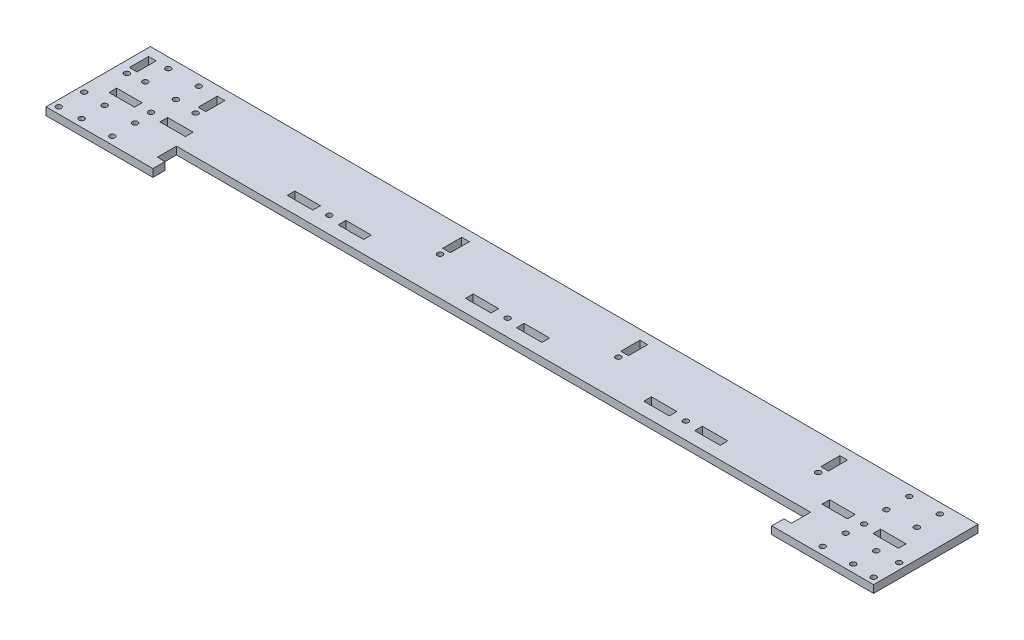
ISO-10303-21;
HEADER;
FILE_DESCRIPTION(('STEP AP214'),'2;1');
FILE_NAME('part.step','',(''),(''),'','','');
FILE_SCHEMA(('AUTOMOTIVE_DESIGN { 1 0 10303 214 1 1 1 1 }'));
ENDSEC;
DATA;
#1=APPLICATION_CONTEXT('core data for automotive mechanical design processes');
#2=APPLICATION_PROTOCOL_DEFINITION('international standard','automotive_design',2000,#1);
#3=PRODUCT_CONTEXT('',#1,'mechanical');
#4=PRODUCT('Part','Part','',(#3));
#5=PRODUCT_RELATED_PRODUCT_CATEGORY('part','',(#4));
#6=PRODUCT_DEFINITION_FORMATION('','',#4);
#7=PRODUCT_DEFINITION_CONTEXT('part definition',#1,'design');
#8=PRODUCT_DEFINITION('design','',#6,#7);
#9=PRODUCT_DEFINITION_SHAPE('','',#8);
#10=(LENGTH_UNIT() NAMED_UNIT(*) SI_UNIT(.MILLI.,.METRE.));
#11=(NAMED_UNIT(*) PLANE_ANGLE_UNIT() SI_UNIT($,.RADIAN.));
#12=(NAMED_UNIT(*) SI_UNIT($,.STERADIAN.) SOLID_ANGLE_UNIT());
#13=UNCERTAINTY_MEASURE_WITH_UNIT(LENGTH_MEASURE(1.E-05),#10,'distance_accuracy_value','');
#14=(GEOMETRIC_REPRESENTATION_CONTEXT(3) GLOBAL_UNCERTAINTY_ASSIGNED_CONTEXT((#13)) GLOBAL_UNIT_ASSIGNED_CONTEXT((#10,
#11,#12)) REPRESENTATION_CONTEXT('',''));
#15=CARTESIAN_POINT('',(0.,0.,0.));
#16=DIRECTION('',(0.,0.,1.));
#17=DIRECTION('',(1.,0.,0.));
#18=AXIS2_PLACEMENT_3D('',#15,#16,#17);
#19=CARTESIAN_POINT('',(0.,6.,0.));
#20=DIRECTION('',(0.,0.,-1.));
#21=DIRECTION('',(-1.,0.,0.));
#22=AXIS2_PLACEMENT_3D('',#19,#20,#21);
#23=PLANE('',#22);
#24=DIRECTION('',(1.,0.,0.));
#25=VECTOR('',#24,1.);
#26=CARTESIAN_POINT('',(0.,0.,0.));
#27=LINE('',#26,#25);
#28=CARTESIAN_POINT('',(0.,0.,0.));
#29=VERTEX_POINT('',#28);
#30=CARTESIAN_POINT('',(84.,0.,0.));
#31=VERTEX_POINT('',#30);
#32=EDGE_CURVE('E1108',#29,#31,#27,.T.);
#33=ORIENTED_EDGE('',*,*,#32,.T.);
#34=DIRECTION('',(0.,1.,0.));
#35=VECTOR('',#34,1.);
#36=CARTESIAN_POINT('',(84.,0.,0.));
#37=LINE('',#36,#35);
#38=CARTESIAN_POINT('',(84.,6.,0.));
#39=VERTEX_POINT('',#38);
#40=EDGE_CURVE('E752',#31,#39,#37,.T.);
#41=ORIENTED_EDGE('',*,*,#40,.T.);
#42=DIRECTION('',(1.,0.,0.));
#43=VECTOR('',#42,1.);
#44=CARTESIAN_POINT('',(0.,6.,0.));
#45=LINE('',#44,#43);
#46=CARTESIAN_POINT('',(0.,6.,0.));
#47=VERTEX_POINT('',#46);
#48=EDGE_CURVE('E1103',#47,#39,#45,.T.);
#49=ORIENTED_EDGE('',*,*,#48,.F.);
#50=DIRECTION('',(0.,-1.,0.));
#51=VECTOR('',#50,1.);
#52=CARTESIAN_POINT('',(0.,6.,0.));
#53=LINE('',#52,#51);
#54=EDGE_CURVE('E11',#47,#29,#53,.T.);
#55=ORIENTED_EDGE('',*,*,#54,.T.);
#56=EDGE_LOOP('',(#33,#41,#49,#55));
#57=FACE_BOUND('',#56,.T.);
#58=ADVANCED_FACE('F35',(#57),#23,.F.);
#59=CARTESIAN_POINT('',(0.,6.,0.));
#60=DIRECTION('',(0.,-1.,0.));
#61=DIRECTION('',(0.,0.,-1.));
#62=AXIS2_PLACEMENT_3D('',#59,#60,#61);
#63=PLANE('',#62);
#64=CARTESIAN_POINT('',(645.,6.,-25.));
#65=DIRECTION('',(0.,1.,0.));
#66=DIRECTION('',(0.,0.,-1.));
#67=AXIS2_PLACEMENT_3D('',#64,#65,#66);
#68=CIRCLE('',#67,2.09999999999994);
#69=CARTESIAN_POINT('',(645.,6.,-27.0999999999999));
#70=VERTEX_POINT('',#69);
#71=EDGE_CURVE('E1554',#70,#70,#68,.T.);
#72=ORIENTED_EDGE('',*,*,#71,.F.);
#73=EDGE_LOOP('',(#72));
#74=FACE_BOUND('',#73,.T.);
#75=CARTESIAN_POINT('',(645.,6.,-5.));
#76=DIRECTION('',(0.,1.,0.));
#77=DIRECTION('',(0.,0.,-1.));
#78=AXIS2_PLACEMENT_3D('',#75,#76,#77);
#79=CIRCLE('',#78,2.09999999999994);
#80=CARTESIAN_POINT('',(645.,6.,-7.09999999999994));
#81=VERTEX_POINT('',#80);
#82=EDGE_CURVE('E1556',#81,#81,#79,.T.);
#83=ORIENTED_EDGE('',*,*,#82,.F.);
#84=EDGE_LOOP('',(#83));
#85=FACE_BOUND('',#84,.T.);
#86=CARTESIAN_POINT('',(5.,6.,-5.));
#87=DIRECTION('',(0.,1.,0.));
#88=DIRECTION('',(0.,0.,1.));
#89=AXIS2_PLACEMENT_3D('',#86,#87,#88);
#90=CIRCLE('',#89,2.1);
#91=CARTESIAN_POINT('',(5.,6.,-2.9));
#92=VERTEX_POINT('',#91);
#93=EDGE_CURVE('E1562',#92,#92,#90,.T.);
#94=ORIENTED_EDGE('',*,*,#93,.F.);
#95=EDGE_LOOP('',(#94));
#96=FACE_BOUND('',#95,.T.);
#97=CARTESIAN_POINT('',(5.,6.,-25.));
#98=DIRECTION('',(0.,1.,0.));
#99=DIRECTION('',(0.,0.,1.));
#100=AXIS2_PLACEMENT_3D('',#97,#98,#99);
#101=CIRCLE('',#100,2.1);
#102=CARTESIAN_POINT('',(5.,6.,-22.9));
#103=VERTEX_POINT('',#102);
#104=EDGE_CURVE('E1568',#103,#103,#101,.T.);
#105=ORIENTED_EDGE('',*,*,#104,.F.);
#106=EDGE_LOOP('',(#105));
#107=FACE_BOUND('',#106,.T.);
#108=CARTESIAN_POINT('',(628.,6.,-74.));
#109=DIRECTION('',(0.,1.,0.));
#110=DIRECTION('',(0.,0.,-1.));
#111=AXIS2_PLACEMENT_3D('',#108,#109,#110);
#112=CIRCLE('',#111,2.10000000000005);
#113=CARTESIAN_POINT('',(628.,6.,-76.1000000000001));
#114=VERTEX_POINT('',#113);
#115=EDGE_CURVE('E1574',#114,#114,#112,.T.);
#116=ORIENTED_EDGE('',*,*,#115,.F.);
#117=EDGE_LOOP('',(#116));
#118=FACE_BOUND('',#117,.T.);
#119=CARTESIAN_POINT('',(604.,6.,-74.));
#120=DIRECTION('',(0.,1.,0.));
#121=DIRECTION('',(0.,0.,-1.));
#122=AXIS2_PLACEMENT_3D('',#119,#120,#121);
#123=CIRCLE('',#122,2.10000000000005);
#124=CARTESIAN_POINT('',(604.,6.,-76.1000000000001));
#125=VERTEX_POINT('',#124);
#126=EDGE_CURVE('E1580',#125,#125,#123,.T.);
#127=ORIENTED_EDGE('',*,*,#126,.F.);
#128=EDGE_LOOP('',(#127));
#129=FACE_BOUND('',#128,.T.);
#130=CARTESIAN_POINT('',(604.,6.,-56.));
#131=DIRECTION('',(0.,1.,0.));
#132=DIRECTION('',(0.,0.,-1.));
#133=AXIS2_PLACEMENT_3D('',#130,#131,#132);
#134=CIRCLE('',#133,2.10000000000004);
#135=CARTESIAN_POINT('',(604.,6.,-58.1000000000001));
#136=VERTEX_POINT('',#135);
#137=EDGE_CURVE('E1586',#136,#136,#134,.T.);
#138=ORIENTED_EDGE('',*,*,#137,.F.);
#139=EDGE_LOOP('',(#138));
#140=FACE_BOUND('',#139,.T.);
#141=CARTESIAN_POINT('',(628.,6.,-56.));
#142=DIRECTION('',(0.,1.,0.));
#143=DIRECTION('',(0.,0.,-1.));
#144=AXIS2_PLACEMENT_3D('',#141,#142,#143);
#145=CIRCLE('',#144,2.10000000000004);
#146=CARTESIAN_POINT('',(628.,6.,-58.1000000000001));
#147=VERTEX_POINT('',#146);
#148=EDGE_CURVE('E1592',#147,#147,#145,.T.);
#149=ORIENTED_EDGE('',*,*,#148,.F.);
#150=EDGE_LOOP('',(#149));
#151=FACE_BOUND('',#150,.T.);
#152=CARTESIAN_POINT('',(628.,6.,-24.));
#153=DIRECTION('',(0.,1.,0.));
#154=DIRECTION('',(0.,0.,-1.));
#155=AXIS2_PLACEMENT_3D('',#152,#153,#154);
#156=CIRCLE('',#155,2.10000000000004);
#157=CARTESIAN_POINT('',(628.,6.,-26.1));
#158=VERTEX_POINT('',#157);
#159=EDGE_CURVE('E1598',#158,#158,#156,.T.);
#160=ORIENTED_EDGE('',*,*,#159,.F.);
#161=EDGE_LOOP('',(#160));
#162=FACE_BOUND('',#161,.T.);
#163=CARTESIAN_POINT('',(604.,6.,-24.));
#164=DIRECTION('',(0.,1.,0.));
#165=DIRECTION('',(0.,0.,-1.));
#166=AXIS2_PLACEMENT_3D('',#163,#164,#165);
#167=CIRCLE('',#166,2.10000000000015);
#168=CARTESIAN_POINT('',(604.,6.,-26.1000000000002));
#169=VERTEX_POINT('',#168);
#170=EDGE_CURVE('E1604',#169,#169,#167,.T.);
#171=ORIENTED_EDGE('',*,*,#170,.F.);
#172=EDGE_LOOP('',(#171));
#173=FACE_BOUND('',#172,.T.);
#174=CARTESIAN_POINT('',(604.,6.,-6.));
#175=DIRECTION('',(0.,1.,0.));
#176=DIRECTION('',(0.,0.,-1.));
#177=AXIS2_PLACEMENT_3D('',#174,#175,#176);
#178=CIRCLE('',#177,2.10000000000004);
#179=CARTESIAN_POINT('',(604.,6.,-8.10000000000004));
#180=VERTEX_POINT('',#179);
#181=EDGE_CURVE('E1610',#180,#180,#178,.T.);
#182=ORIENTED_EDGE('',*,*,#181,.F.);
#183=EDGE_LOOP('',(#182));
#184=FACE_BOUND('',#183,.T.);
#185=CARTESIAN_POINT('',(628.,6.,-6.));
#186=DIRECTION('',(0.,1.,0.));
#187=DIRECTION('',(0.,0.,-1.));
#188=AXIS2_PLACEMENT_3D('',#185,#186,#187);
#189=CIRCLE('',#188,2.10000000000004);
#190=CARTESIAN_POINT('',(628.,6.,-8.10000000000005));
#191=VERTEX_POINT('',#190);
#192=EDGE_CURVE('E1616',#191,#191,#189,.T.);
#193=ORIENTED_EDGE('',*,*,#192,.F.);
#194=EDGE_LOOP('',(#193));
#195=FACE_BOUND('',#194,.T.);
#196=CARTESIAN_POINT('',(22.,6.,-6.));
#197=DIRECTION('',(0.,1.,0.));
#198=DIRECTION('',(0.,0.,1.));
#199=AXIS2_PLACEMENT_3D('',#196,#197,#198);
#200=CIRCLE('',#199,2.1);
#201=CARTESIAN_POINT('',(22.,6.,-3.9));
#202=VERTEX_POINT('',#201);
#203=EDGE_CURVE('E1622',#202,#202,#200,.T.);
#204=ORIENTED_EDGE('',*,*,#203,.F.);
#205=EDGE_LOOP('',(#204));
#206=FACE_BOUND('',#205,.T.);
#207=CARTESIAN_POINT('',(46.,6.,-6.));
#208=DIRECTION('',(0.,1.,0.));
#209=DIRECTION('',(0.,0.,1.));
#210=AXIS2_PLACEMENT_3D('',#207,#208,#209);
#211=CIRCLE('',#210,2.1);
#212=CARTESIAN_POINT('',(46.,6.,-3.90000000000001));
#213=VERTEX_POINT('',#212);
#214=EDGE_CURVE('E1628',#213,#213,#211,.T.);
#215=ORIENTED_EDGE('',*,*,#214,.F.);
#216=EDGE_LOOP('',(#215));
#217=FACE_BOUND('',#216,.T.);
#218=CARTESIAN_POINT('',(46.,6.,-24.));
#219=DIRECTION('',(0.,1.,0.));
#220=DIRECTION('',(0.,0.,1.));
#221=AXIS2_PLACEMENT_3D('',#218,#219,#220);
#222=CIRCLE('',#221,2.1);
#223=CARTESIAN_POINT('',(46.,6.,-21.9));
#224=VERTEX_POINT('',#223);
#225=EDGE_CURVE('E1634',#224,#224,#222,.T.);
#226=ORIENTED_EDGE('',*,*,#225,.F.);
#227=EDGE_LOOP('',(#226));
#228=FACE_BOUND('',#227,.T.);
#229=CARTESIAN_POINT('',(22.,6.,-24.));
#230=DIRECTION('',(0.,1.,0.));
#231=DIRECTION('',(0.,0.,1.));
#232=AXIS2_PLACEMENT_3D('',#229,#230,#231);
#233=CIRCLE('',#232,2.1);
#234=CARTESIAN_POINT('',(22.,6.,-21.9));
#235=VERTEX_POINT('',#234);
#236=EDGE_CURVE('E1640',#235,#235,#233,.T.);
#237=ORIENTED_EDGE('',*,*,#236,.F.);
#238=EDGE_LOOP('',(#237));
#239=FACE_BOUND('',#238,.T.);
#240=CARTESIAN_POINT('',(22.,6.,-56.));
#241=DIRECTION('',(0.,1.,0.));
#242=DIRECTION('',(0.,0.,1.));
#243=AXIS2_PLACEMENT_3D('',#240,#241,#242);
#244=CIRCLE('',#243,2.1);
#245=CARTESIAN_POINT('',(22.,6.,-53.9));
#246=VERTEX_POINT('',#245);
#247=EDGE_CURVE('E1646',#246,#246,#244,.T.);
#248=ORIENTED_EDGE('',*,*,#247,.F.);
#249=EDGE_LOOP('',(#248));
#250=FACE_BOUND('',#249,.T.);
#251=CARTESIAN_POINT('',(46.,6.,-56.));
#252=DIRECTION('',(0.,1.,0.));
#253=DIRECTION('',(0.,0.,1.));
#254=AXIS2_PLACEMENT_3D('',#251,#252,#253);
#255=CIRCLE('',#254,2.1);
#256=CARTESIAN_POINT('',(46.,6.,-53.9));
#257=VERTEX_POINT('',#256);
#258=EDGE_CURVE('E1652',#257,#257,#255,.T.);
#259=ORIENTED_EDGE('',*,*,#258,.F.);
#260=EDGE_LOOP('',(#259));
#261=FACE_BOUND('',#260,.T.);
#262=CARTESIAN_POINT('',(46.,6.,-74.));
#263=DIRECTION('',(0.,1.,0.));
#264=DIRECTION('',(0.,0.,1.));
#265=AXIS2_PLACEMENT_3D('',#262,#263,#264);
#266=CIRCLE('',#265,2.1);
#267=CARTESIAN_POINT('',(46.,6.,-71.9));
#268=VERTEX_POINT('',#267);
#269=EDGE_CURVE('E1658',#268,#268,#266,.T.);
#270=ORIENTED_EDGE('',*,*,#269,.F.);
#271=EDGE_LOOP('',(#270));
#272=FACE_BOUND('',#271,.T.);
#273=CARTESIAN_POINT('',(22.,6.,-74.));
#274=DIRECTION('',(0.,1.,0.));
#275=DIRECTION('',(0.,0.,1.));
#276=AXIS2_PLACEMENT_3D('',#273,#274,#275);
#277=CIRCLE('',#276,2.1);
#278=CARTESIAN_POINT('',(22.,6.,-71.9));
#279=VERTEX_POINT('',#278);
#280=EDGE_CURVE('E515',#279,#279,#277,.T.);
#281=ORIENTED_EDGE('',*,*,#280,.F.);
#282=EDGE_LOOP('',(#281));
#283=FACE_BOUND('',#282,.T.);
#284=CARTESIAN_POINT('',(552.,6.,-54.5));
#285=DIRECTION('',(0.,1.,0.));
#286=DIRECTION('',(0.,0.,1.));
#287=AXIS2_PLACEMENT_3D('',#284,#285,#286);
#288=CIRCLE('',#287,2.10000000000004);
#289=CARTESIAN_POINT('',(552.,6.,-52.4));
#290=VERTEX_POINT('',#289);
#291=EDGE_CURVE('E503',#290,#290,#288,.T.);
#292=ORIENTED_EDGE('',*,*,#291,.F.);
#293=EDGE_LOOP('',(#292));
#294=FACE_BOUND('',#293,.T.);
#295=CARTESIAN_POINT('',(395.,6.,-54.5));
#296=DIRECTION('',(0.,1.,0.));
#297=DIRECTION('',(0.,0.,1.));
#298=AXIS2_PLACEMENT_3D('',#295,#296,#297);
#299=CIRCLE('',#298,2.09999999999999);
#300=CARTESIAN_POINT('',(395.,6.,-52.4));
#301=VERTEX_POINT('',#300);
#302=EDGE_CURVE('E523',#301,#301,#299,.T.);
#303=ORIENTED_EDGE('',*,*,#302,.F.);
#304=EDGE_LOOP('',(#303));
#305=FACE_BOUND('',#304,.T.);
#306=CARTESIAN_POINT('',(255.,6.,-54.5));
#307=DIRECTION('',(0.,1.,0.));
#308=DIRECTION('',(0.,0.,1.));
#309=AXIS2_PLACEMENT_3D('',#306,#307,#308);
#310=CIRCLE('',#309,2.09999999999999);
#311=CARTESIAN_POINT('',(255.,6.,-52.4));
#312=VERTEX_POINT('',#311);
#313=EDGE_CURVE('E529',#312,#312,#310,.T.);
#314=ORIENTED_EDGE('',*,*,#313,.F.);
#315=EDGE_LOOP('',(#314));
#316=FACE_BOUND('',#315,.T.);
#317=CARTESIAN_POINT('',(63.,6.,-54.5));
#318=DIRECTION('',(0.,1.,0.));
#319=DIRECTION('',(0.,0.,1.));
#320=AXIS2_PLACEMENT_3D('',#317,#318,#319);
#321=CIRCLE('',#320,2.1);
#322=CARTESIAN_POINT('',(63.,6.,-52.4));
#323=VERTEX_POINT('',#322);
#324=EDGE_CURVE('E535',#323,#323,#321,.T.);
#325=ORIENTED_EDGE('',*,*,#324,.F.);
#326=EDGE_LOOP('',(#325));
#327=FACE_BOUND('',#326,.T.);
#328=CARTESIAN_POINT('',(9.,6.,-54.5));
#329=DIRECTION('',(0.,1.,0.));
#330=DIRECTION('',(0.,0.,1.));
#331=AXIS2_PLACEMENT_3D('',#328,#329,#330);
#332=CIRCLE('',#331,2.1);
#333=CARTESIAN_POINT('',(9.,6.,-52.4));
#334=VERTEX_POINT('',#333);
#335=EDGE_CURVE('E541',#334,#334,#332,.T.);
#336=ORIENTED_EDGE('',*,*,#335,.F.);
#337=EDGE_LOOP('',(#336));
#338=FACE_BOUND('',#337,.T.);
#339=DIRECTION('',(1.,0.,0.));
#340=VECTOR('',#339,1.);
#341=CARTESIAN_POINT('',(549.,6.,-59.5));
#342=LINE('',#341,#340);
#343=CARTESIAN_POINT('',(549.,6.,-59.5));
#344=VERTEX_POINT('',#343);
#345=CARTESIAN_POINT('',(555.,6.,-59.5));
#346=VERTEX_POINT('',#345);
#347=EDGE_CURVE('E562',#344,#346,#342,.T.);
#348=ORIENTED_EDGE('',*,*,#347,.F.);
#349=DIRECTION('',(0.,0.,1.));
#350=VECTOR('',#349,1.);
#351=CARTESIAN_POINT('',(549.,6.,-74.5));
#352=LINE('',#351,#350);
#353=CARTESIAN_POINT('',(549.,6.,-74.5));
#354=VERTEX_POINT('',#353);
#355=EDGE_CURVE('E50',#354,#344,#352,.T.);
#356=ORIENTED_EDGE('',*,*,#355,.F.);
#357=DIRECTION('',(-1.,0.,0.));
#358=VECTOR('',#357,1.);
#359=CARTESIAN_POINT('',(549.,6.,-74.5));
#360=LINE('',#359,#358);
#361=CARTESIAN_POINT('',(555.,6.,-74.5));
#362=VERTEX_POINT('',#361);
#363=EDGE_CURVE('E553',#362,#354,#360,.T.);
#364=ORIENTED_EDGE('',*,*,#363,.F.);
#365=DIRECTION('',(0.,0.,-1.));
#366=VECTOR('',#365,1.);
#367=CARTESIAN_POINT('',(555.,6.,-74.5));
#368=LINE('',#367,#366);
#369=EDGE_CURVE('E565',#346,#362,#368,.T.);
#370=ORIENTED_EDGE('',*,*,#369,.F.);
#371=EDGE_LOOP('',(#348,#356,#364,#370));
#372=FACE_BOUND('',#371,.T.);
#373=DIRECTION('',(1.,0.,0.));
#374=VECTOR('',#373,1.);
#375=CARTESIAN_POINT('',(392.,6.,-59.5));
#376=LINE('',#375,#374);
#377=CARTESIAN_POINT('',(392.,6.,-59.5));
#378=VERTEX_POINT('',#377);
#379=CARTESIAN_POINT('',(398.,6.,-59.5));
#380=VERTEX_POINT('',#379);
#381=EDGE_CURVE('E593',#378,#380,#376,.T.);
#382=ORIENTED_EDGE('',*,*,#381,.F.);
#383=DIRECTION('',(0.,0.,1.));
#384=VECTOR('',#383,1.);
#385=CARTESIAN_POINT('',(392.,6.,-74.5));
#386=LINE('',#385,#384);
#387=CARTESIAN_POINT('',(392.,6.,-74.5));
#388=VERTEX_POINT('',#387);
#389=EDGE_CURVE('E572',#388,#378,#386,.T.);
#390=ORIENTED_EDGE('',*,*,#389,.F.);
#391=DIRECTION('',(-1.,0.,0.));
#392=VECTOR('',#391,1.);
#393=CARTESIAN_POINT('',(392.,6.,-74.5));
#394=LINE('',#393,#392);
#395=CARTESIAN_POINT('',(398.,6.,-74.5));
#396=VERTEX_POINT('',#395);
#397=EDGE_CURVE('E582',#396,#388,#394,.T.);
#398=ORIENTED_EDGE('',*,*,#397,.F.);
#399=DIRECTION('',(0.,0.,-1.));
#400=VECTOR('',#399,1.);
#401=CARTESIAN_POINT('',(398.,6.,-74.5));
#402=LINE('',#401,#400);
#403=EDGE_CURVE('E596',#380,#396,#402,.T.);
#404=ORIENTED_EDGE('',*,*,#403,.F.);
#405=EDGE_LOOP('',(#382,#390,#398,#404));
#406=FACE_BOUND('',#405,.T.);
#407=DIRECTION('',(1.,0.,0.));
#408=VECTOR('',#407,1.);
#409=CARTESIAN_POINT('',(252.,6.,-59.5));
#410=LINE('',#409,#408);
#411=CARTESIAN_POINT('',(252.,6.,-59.5));
#412=VERTEX_POINT('',#411);
#413=CARTESIAN_POINT('',(258.,6.,-59.5));
#414=VERTEX_POINT('',#413);
#415=EDGE_CURVE('E625',#412,#414,#410,.T.);
#416=ORIENTED_EDGE('',*,*,#415,.F.);
#417=DIRECTION('',(0.,0.,1.));
#418=VECTOR('',#417,1.);
#419=CARTESIAN_POINT('',(252.,6.,-74.5));
#420=LINE('',#419,#418);
#421=CARTESIAN_POINT('',(252.,6.,-74.5));
#422=VERTEX_POINT('',#421);
#423=EDGE_CURVE('E603',#422,#412,#420,.T.);
#424=ORIENTED_EDGE('',*,*,#423,.F.);
#425=DIRECTION('',(-1.,0.,0.));
#426=VECTOR('',#425,1.);
#427=CARTESIAN_POINT('',(252.,6.,-74.5));
#428=LINE('',#427,#426);
#429=CARTESIAN_POINT('',(258.,6.,-74.5));
#430=VERTEX_POINT('',#429);
#431=EDGE_CURVE('E614',#430,#422,#428,.T.);
#432=ORIENTED_EDGE('',*,*,#431,.F.);
#433=DIRECTION('',(0.,0.,-1.));
#434=VECTOR('',#433,1.);
#435=CARTESIAN_POINT('',(258.,6.,-74.5));
#436=LINE('',#435,#434);
#437=EDGE_CURVE('E628',#414,#430,#436,.T.);
#438=ORIENTED_EDGE('',*,*,#437,.F.);
#439=EDGE_LOOP('',(#416,#424,#432,#438));
#440=FACE_BOUND('',#439,.T.);
#441=DIRECTION('',(1.,0.,0.));
#442=VECTOR('',#441,1.);
#443=CARTESIAN_POINT('',(60.,6.,-59.5));
#444=LINE('',#443,#442);
#445=CARTESIAN_POINT('',(60.,6.,-59.5));
#446=VERTEX_POINT('',#445);
#447=CARTESIAN_POINT('',(66.,6.,-59.5));
#448=VERTEX_POINT('',#447);
#449=EDGE_CURVE('E657',#446,#448,#444,.T.);
#450=ORIENTED_EDGE('',*,*,#449,.F.);
#451=DIRECTION('',(0.,0.,1.));
#452=VECTOR('',#451,1.);
#453=CARTESIAN_POINT('',(60.,6.,-74.5));
#454=LINE('',#453,#452);
#455=CARTESIAN_POINT('',(60.,6.,-74.5));
#456=VERTEX_POINT('',#455);
#457=EDGE_CURVE('E635',#456,#446,#454,.T.);
#458=ORIENTED_EDGE('',*,*,#457,.F.);
#459=DIRECTION('',(-1.,0.,0.));
#460=VECTOR('',#459,1.);
#461=CARTESIAN_POINT('',(60.,6.,-74.5));
#462=LINE('',#461,#460);
#463=CARTESIAN_POINT('',(66.,6.,-74.5));
#464=VERTEX_POINT('',#463);
#465=EDGE_CURVE('E646',#464,#456,#462,.T.);
#466=ORIENTED_EDGE('',*,*,#465,.F.);
#467=DIRECTION('',(0.,0.,-1.));
#468=VECTOR('',#467,1.);
#469=CARTESIAN_POINT('',(66.,6.,-74.5));
#470=LINE('',#469,#468);
#471=EDGE_CURVE('E660',#448,#464,#470,.T.);
#472=ORIENTED_EDGE('',*,*,#471,.F.);
#473=EDGE_LOOP('',(#450,#458,#466,#472));
#474=FACE_BOUND('',#473,.T.);
#475=DIRECTION('',(1.,0.,0.));
#476=VECTOR('',#475,1.);
#477=CARTESIAN_POINT('',(6.,6.,-59.5));
#478=LINE('',#477,#476);
#479=CARTESIAN_POINT('',(6.,6.,-59.5));
#480=VERTEX_POINT('',#479);
#481=CARTESIAN_POINT('',(12.,6.,-59.5));
#482=VERTEX_POINT('',#481);
#483=EDGE_CURVE('E689',#480,#482,#478,.T.);
#484=ORIENTED_EDGE('',*,*,#483,.F.);
#485=DIRECTION('',(0.,0.,1.));
#486=VECTOR('',#485,1.);
#487=CARTESIAN_POINT('',(6.,6.,-74.5));
#488=LINE('',#487,#486);
#489=CARTESIAN_POINT('',(6.,6.,-74.5));
#490=VERTEX_POINT('',#489);
#491=EDGE_CURVE('E667',#490,#480,#488,.T.);
#492=ORIENTED_EDGE('',*,*,#491,.F.);
#493=DIRECTION('',(-1.,0.,0.));
#494=VECTOR('',#493,1.);
#495=CARTESIAN_POINT('',(6.,6.,-74.5));
#496=LINE('',#495,#494);
#497=CARTESIAN_POINT('',(12.,6.,-74.5));
#498=VERTEX_POINT('',#497);
#499=EDGE_CURVE('E678',#498,#490,#496,.T.);
#500=ORIENTED_EDGE('',*,*,#499,.F.);
#501=DIRECTION('',(0.,0.,-1.));
#502=VECTOR('',#501,1.);
#503=CARTESIAN_POINT('',(12.,6.,-74.5));
#504=LINE('',#503,#502);
#505=EDGE_CURVE('E692',#482,#498,#504,.T.);
#506=ORIENTED_EDGE('',*,*,#505,.F.);
#507=EDGE_LOOP('',(#484,#492,#500,#506));
#508=FACE_BOUND('',#507,.T.);
#509=DIRECTION('',(1.,0.,0.));
#510=VECTOR('',#509,1.);
#511=CARTESIAN_POINT('',(595.,6.,-34.5));
#512=LINE('',#511,#510);
#513=CARTESIAN_POINT('',(575.,6.,-34.5));
#514=VERTEX_POINT('',#513);
#515=CARTESIAN_POINT('',(595.,6.,-34.5));
#516=VERTEX_POINT('',#515);
#517=EDGE_CURVE('E794',#514,#516,#512,.T.);
#518=ORIENTED_EDGE('',*,*,#517,.F.);
#519=DIRECTION('',(0.,0.,1.));
#520=VECTOR('',#519,1.);
#521=CARTESIAN_POINT('',(575.,6.,-34.5));
#522=LINE('',#521,#520);
#523=CARTESIAN_POINT('',(575.,6.,-40.5));
#524=VERTEX_POINT('',#523);
#525=EDGE_CURVE('E802',#524,#514,#522,.T.);
#526=ORIENTED_EDGE('',*,*,#525,.F.);
#527=DIRECTION('',(-1.,0.,0.));
#528=VECTOR('',#527,1.);
#529=CARTESIAN_POINT('',(595.,6.,-40.5));
#530=LINE('',#529,#528);
#531=CARTESIAN_POINT('',(595.,6.,-40.5));
#532=VERTEX_POINT('',#531);
#533=EDGE_CURVE('E799',#532,#524,#530,.T.);
#534=ORIENTED_EDGE('',*,*,#533,.F.);
#535=DIRECTION('',(0.,0.,-1.));
#536=VECTOR('',#535,1.);
#537=CARTESIAN_POINT('',(595.,6.,-34.5));
#538=LINE('',#537,#536);
#539=EDGE_CURVE('E796',#516,#532,#538,.T.);
#540=ORIENTED_EDGE('',*,*,#539,.F.);
#541=EDGE_LOOP('',(#518,#526,#534,#540));
#542=FACE_BOUND('',#541,.T.);
#543=DIRECTION('',(-1.,0.,0.));
#544=VECTOR('',#543,1.);
#545=CARTESIAN_POINT('',(455.,6.,-40.5));
#546=LINE('',#545,#544);
#547=CARTESIAN_POINT('',(455.,6.,-40.5));
#548=VERTEX_POINT('',#547);
#549=CARTESIAN_POINT('',(435.,6.,-40.5));
#550=VERTEX_POINT('',#549);
#551=EDGE_CURVE('E856',#548,#550,#546,.T.);
#552=ORIENTED_EDGE('',*,*,#551,.F.);
#553=DIRECTION('',(0.,0.,-1.));
#554=VECTOR('',#553,1.);
#555=CARTESIAN_POINT('',(455.,6.,-40.5));
#556=LINE('',#555,#554);
#557=CARTESIAN_POINT('',(455.,6.,-34.5));
#558=VERTEX_POINT('',#557);
#559=EDGE_CURVE('E864',#558,#548,#556,.T.);
#560=ORIENTED_EDGE('',*,*,#559,.F.);
#561=DIRECTION('',(1.,0.,0.));
#562=VECTOR('',#561,1.);
#563=CARTESIAN_POINT('',(455.,6.,-34.5));
#564=LINE('',#563,#562);
#565=CARTESIAN_POINT('',(435.,6.,-34.5));
#566=VERTEX_POINT('',#565);
#567=EDGE_CURVE('E861',#566,#558,#564,.T.);
#568=ORIENTED_EDGE('',*,*,#567,.F.);
#569=DIRECTION('',(0.,0.,1.));
#570=VECTOR('',#569,1.);
#571=CARTESIAN_POINT('',(435.,6.,-40.5));
#572=LINE('',#571,#570);
#573=EDGE_CURVE('E858',#550,#566,#572,.T.);
#574=ORIENTED_EDGE('',*,*,#573,.F.);
#575=EDGE_LOOP('',(#552,#560,#568,#574));
#576=FACE_BOUND('',#575,.T.);
#577=CARTESIAN_POINT('',(605.,6.,-37.5));
#578=DIRECTION('',(0.,1.,0.));
#579=DIRECTION('',(0.,0.,-1.));
#580=AXIS2_PLACEMENT_3D('',#577,#578,#579);
#581=CIRCLE('',#580,2.10000000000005);
#582=CARTESIAN_POINT('',(605.,6.,-39.6000000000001));
#583=VERTEX_POINT('',#582);
#584=EDGE_CURVE('E918',#583,#583,#581,.T.);
#585=ORIENTED_EDGE('',*,*,#584,.F.);
#586=EDGE_LOOP('',(#585));
#587=FACE_BOUND('',#586,.T.);
#588=CARTESIAN_POINT('',(465.,6.,-37.5));
#589=DIRECTION('',(0.,1.,0.));
#590=DIRECTION('',(0.,0.,-1.));
#591=AXIS2_PLACEMENT_3D('',#588,#589,#590);
#592=CIRCLE('',#591,2.10000000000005);
#593=CARTESIAN_POINT('',(465.,6.,-39.6));
#594=VERTEX_POINT('',#593);
#595=EDGE_CURVE('E924',#594,#594,#592,.T.);
#596=ORIENTED_EDGE('',*,*,#595,.F.);
#597=EDGE_LOOP('',(#596));
#598=FACE_BOUND('',#597,.T.);
#599=CARTESIAN_POINT('',(325.,6.,-37.5));
#600=DIRECTION('',(0.,1.,0.));
#601=DIRECTION('',(0.,0.,1.));
#602=AXIS2_PLACEMENT_3D('',#599,#600,#601);
#603=CIRCLE('',#602,2.09999999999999);
#604=CARTESIAN_POINT('',(325.,6.,-35.4));
#605=VERTEX_POINT('',#604);
#606=EDGE_CURVE('E930',#605,#605,#603,.T.);
#607=ORIENTED_EDGE('',*,*,#606,.F.);
#608=EDGE_LOOP('',(#607));
#609=FACE_BOUND('',#608,.T.);
#610=CARTESIAN_POINT('',(185.,6.,-37.5));
#611=DIRECTION('',(0.,1.,0.));
#612=DIRECTION('',(0.,0.,1.));
#613=AXIS2_PLACEMENT_3D('',#610,#611,#612);
#614=CIRCLE('',#613,2.09999999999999);
#615=CARTESIAN_POINT('',(185.,6.,-35.4));
#616=VERTEX_POINT('',#615);
#617=EDGE_CURVE('E936',#616,#616,#614,.T.);
#618=ORIENTED_EDGE('',*,*,#617,.F.);
#619=EDGE_LOOP('',(#618));
#620=FACE_BOUND('',#619,.T.);
#621=CARTESIAN_POINT('',(45.,6.,-37.5));
#622=DIRECTION('',(0.,1.,0.));
#623=DIRECTION('',(0.,0.,1.));
#624=AXIS2_PLACEMENT_3D('',#621,#622,#623);
#625=CIRCLE('',#624,2.1);
#626=CARTESIAN_POINT('',(45.,6.,-35.4));
#627=VERTEX_POINT('',#626);
#628=EDGE_CURVE('E942',#627,#627,#625,.T.);
#629=ORIENTED_EDGE('',*,*,#628,.F.);
#630=EDGE_LOOP('',(#629));
#631=FACE_BOUND('',#630,.T.);
#632=DIRECTION('',(0.,0.,1.));
#633=VECTOR('',#632,1.);
#634=CARTESIAN_POINT('',(295.,6.,-40.5));
#635=LINE('',#634,#633);
#636=CARTESIAN_POINT('',(295.,6.,-40.5));
#637=VERTEX_POINT('',#636);
#638=CARTESIAN_POINT('',(295.,6.,-34.5));
#639=VERTEX_POINT('',#638);
#640=EDGE_CURVE('E948',#637,#639,#635,.T.);
#641=ORIENTED_EDGE('',*,*,#640,.F.);
#642=DIRECTION('',(-1.,0.,0.));
#643=VECTOR('',#642,1.);
#644=CARTESIAN_POINT('',(295.,6.,-40.5));
#645=LINE('',#644,#643);
#646=CARTESIAN_POINT('',(315.,6.,-40.5));
#647=VERTEX_POINT('',#646);
#648=EDGE_CURVE('E956',#647,#637,#645,.T.);
#649=ORIENTED_EDGE('',*,*,#648,.F.);
#650=DIRECTION('',(0.,0.,-1.));
#651=VECTOR('',#650,1.);
#652=CARTESIAN_POINT('',(315.,6.,-40.5));
#653=LINE('',#652,#651);
#654=CARTESIAN_POINT('',(315.,6.,-34.5));
#655=VERTEX_POINT('',#654);
#656=EDGE_CURVE('E953',#655,#647,#653,.T.);
#657=ORIENTED_EDGE('',*,*,#656,.F.);
#658=DIRECTION('',(1.,0.,0.));
#659=VECTOR('',#658,1.);
#660=CARTESIAN_POINT('',(295.,6.,-34.5));
#661=LINE('',#660,#659);
#662=EDGE_CURVE('E950',#639,#655,#661,.T.);
#663=ORIENTED_EDGE('',*,*,#662,.F.);
#664=EDGE_LOOP('',(#641,#649,#657,#663));
#665=FACE_BOUND('',#664,.T.);
#666=DIRECTION('',(0.,0.,1.));
#667=VECTOR('',#666,1.);
#668=CARTESIAN_POINT('',(155.,6.,-40.5));
#669=LINE('',#668,#667);
#670=CARTESIAN_POINT('',(155.,6.,-40.5));
#671=VERTEX_POINT('',#670);
#672=CARTESIAN_POINT('',(155.,6.,-34.5));
#673=VERTEX_POINT('',#672);
#674=EDGE_CURVE('E1010',#671,#673,#669,.T.);
#675=ORIENTED_EDGE('',*,*,#674,.F.);
#676=DIRECTION('',(-1.,0.,0.));
#677=VECTOR('',#676,1.);
#678=CARTESIAN_POINT('',(155.,6.,-40.5));
#679=LINE('',#678,#677);
#680=CARTESIAN_POINT('',(175.,6.,-40.5));
#681=VERTEX_POINT('',#680);
#682=EDGE_CURVE('E1018',#681,#671,#679,.T.);
#683=ORIENTED_EDGE('',*,*,#682,.F.);
#684=DIRECTION('',(0.,0.,-1.));
#685=VECTOR('',#684,1.);
#686=CARTESIAN_POINT('',(175.,6.,-40.5));
#687=LINE('',#686,#685);
#688=CARTESIAN_POINT('',(175.,6.,-34.5));
#689=VERTEX_POINT('',#688);
#690=EDGE_CURVE('E1015',#689,#681,#687,.T.);
#691=ORIENTED_EDGE('',*,*,#690,.F.);
#692=DIRECTION('',(1.,0.,0.));
#693=VECTOR('',#692,1.);
#694=CARTESIAN_POINT('',(155.,6.,-34.5));
#695=LINE('',#694,#693);
#696=EDGE_CURVE('E1012',#673,#689,#695,.T.);
#697=ORIENTED_EDGE('',*,*,#696,.F.);
#698=EDGE_LOOP('',(#675,#683,#691,#697));
#699=FACE_BOUND('',#698,.T.);
#700=DIRECTION('',(0.,0.,1.));
#701=VECTOR('',#700,1.);
#702=CARTESIAN_POINT('',(15.,6.,-40.5));
#703=LINE('',#702,#701);
#704=CARTESIAN_POINT('',(15.,6.,-40.5));
#705=VERTEX_POINT('',#704);
#706=CARTESIAN_POINT('',(15.,6.,-34.5));
#707=VERTEX_POINT('',#706);
#708=EDGE_CURVE('E1072',#705,#707,#703,.T.);
#709=ORIENTED_EDGE('',*,*,#708,.F.);
#710=DIRECTION('',(-1.,0.,0.));
#711=VECTOR('',#710,1.);
#712=CARTESIAN_POINT('',(15.,6.,-40.5));
#713=LINE('',#712,#711);
#714=CARTESIAN_POINT('',(35.,6.,-40.5));
#715=VERTEX_POINT('',#714);
#716=EDGE_CURVE('E1080',#715,#705,#713,.T.);
#717=ORIENTED_EDGE('',*,*,#716,.F.);
#718=DIRECTION('',(0.,0.,-1.));
#719=VECTOR('',#718,1.);
#720=CARTESIAN_POINT('',(35.,6.,-40.5));
#721=LINE('',#720,#719);
#722=CARTESIAN_POINT('',(35.,6.,-34.5));
#723=VERTEX_POINT('',#722);
#724=EDGE_CURVE('E1077',#723,#715,#721,.T.);
#725=ORIENTED_EDGE('',*,*,#724,.F.);
#726=DIRECTION('',(1.,0.,0.));
#727=VECTOR('',#726,1.);
#728=CARTESIAN_POINT('',(15.,6.,-34.5));
#729=LINE('',#728,#727);
#730=EDGE_CURVE('E1074',#707,#723,#729,.T.);
#731=ORIENTED_EDGE('',*,*,#730,.F.);
#732=EDGE_LOOP('',(#709,#717,#725,#731));
#733=FACE_BOUND('',#732,.T.);
#734=DIRECTION('',(-1.,0.,0.));
#735=VECTOR('',#734,1.);
#736=CARTESIAN_POINT('',(84.,6.,-24.5));
#737=LINE('',#736,#735);
#738=CARTESIAN_POINT('',(576.,6.,-24.5));
#739=VERTEX_POINT('',#738);
#740=CARTESIAN_POINT('',(78.,6.,-24.5));
#741=VERTEX_POINT('',#740);
#742=EDGE_CURVE('E747',#739,#741,#737,.T.);
#743=ORIENTED_EDGE('',*,*,#742,.F.);
#744=DIRECTION('',(0.,0.,-1.));
#745=VECTOR('',#744,1.);
#746=CARTESIAN_POINT('',(576.,6.,-9.5));
#747=LINE('',#746,#745);
#748=CARTESIAN_POINT('',(576.,6.,-9.5));
#749=VERTEX_POINT('',#748);
#750=EDGE_CURVE('E710',#749,#739,#747,.T.);
#751=ORIENTED_EDGE('',*,*,#750,.F.);
#752=DIRECTION('',(1.,0.,0.));
#753=VECTOR('',#752,1.);
#754=CARTESIAN_POINT('',(570.,6.,-9.5));
#755=LINE('',#754,#753);
#756=CARTESIAN_POINT('',(570.,6.,-9.5));
#757=VERTEX_POINT('',#756);
#758=EDGE_CURVE('E699',#757,#749,#755,.T.);
#759=ORIENTED_EDGE('',*,*,#758,.F.);
#760=DIRECTION('',(0.,0.,-1.));
#761=VECTOR('',#760,1.);
#762=CARTESIAN_POINT('',(570.,6.,0.));
#763=LINE('',#762,#761);
#764=CARTESIAN_POINT('',(570.,6.,0.));
#765=VERTEX_POINT('',#764);
#766=EDGE_CURVE('E754',#765,#757,#763,.T.);
#767=ORIENTED_EDGE('',*,*,#766,.F.);
#768=CARTESIAN_POINT('',(650.,6.,0.));
#769=VERTEX_POINT('',#768);
#770=EDGE_CURVE('E493',#765,#769,#45,.T.);
#771=ORIENTED_EDGE('',*,*,#770,.T.);
#772=DIRECTION('',(0.,0.,-1.));
#773=VECTOR('',#772,1.);
#774=CARTESIAN_POINT('',(650.,6.,0.));
#775=LINE('',#774,#773);
#776=CARTESIAN_POINT('',(650.,6.,-82.));
#777=VERTEX_POINT('',#776);
#778=EDGE_CURVE('E508',#769,#777,#775,.T.);
#779=ORIENTED_EDGE('',*,*,#778,.T.);
#780=DIRECTION('',(-1.,0.,0.));
#781=VECTOR('',#780,1.);
#782=CARTESIAN_POINT('',(0.,6.,-82.));
#783=LINE('',#782,#781);
#784=CARTESIAN_POINT('',(0.,6.,-82.));
#785=VERTEX_POINT('',#784);
#786=EDGE_CURVE('E500',#777,#785,#783,.T.);
#787=ORIENTED_EDGE('',*,*,#786,.T.);
#788=DIRECTION('',(0.,0.,1.));
#789=VECTOR('',#788,1.);
#790=CARTESIAN_POINT('',(0.,6.,0.));
#791=LINE('',#790,#789);
#792=EDGE_CURVE('E485',#785,#47,#791,.T.);
#793=ORIENTED_EDGE('',*,*,#792,.T.);
#794=ORIENTED_EDGE('',*,*,#48,.T.);
#795=DIRECTION('',(0.,0.,1.));
#796=VECTOR('',#795,1.);
#797=CARTESIAN_POINT('',(84.,6.,0.));
#798=LINE('',#797,#796);
#799=CARTESIAN_POINT('',(84.,6.,-9.5));
#800=VERTEX_POINT('',#799);
#801=EDGE_CURVE('E739',#800,#39,#798,.T.);
#802=ORIENTED_EDGE('',*,*,#801,.F.);
#803=DIRECTION('',(1.,0.,0.));
#804=VECTOR('',#803,1.);
#805=CARTESIAN_POINT('',(84.,6.,-9.5));
#806=LINE('',#805,#804);
#807=CARTESIAN_POINT('',(78.,6.,-9.5));
#808=VERTEX_POINT('',#807);
#809=EDGE_CURVE('E729',#808,#800,#806,.T.);
#810=ORIENTED_EDGE('',*,*,#809,.F.);
#811=DIRECTION('',(0.,0.,1.));
#812=VECTOR('',#811,1.);
#813=CARTESIAN_POINT('',(78.,6.,-9.5));
#814=LINE('',#813,#812);
#815=EDGE_CURVE('E721',#741,#808,#814,.T.);
#816=ORIENTED_EDGE('',*,*,#815,.F.);
#817=EDGE_LOOP('',(#743,#751,#759,#767,#771,#779,#787,#793,#794,#802,#810,#816));
#818=FACE_BOUND('',#817,.T.);
#819=DIRECTION('',(0.,0.,1.));
#820=VECTOR('',#819,1.);
#821=CARTESIAN_POINT('',(55.,6.,-34.5));
#822=LINE('',#821,#820);
#823=CARTESIAN_POINT('',(55.,6.,-40.5));
#824=VERTEX_POINT('',#823);
#825=CARTESIAN_POINT('',(55.,6.,-34.5));
#826=VERTEX_POINT('',#825);
#827=EDGE_CURVE('E1041',#824,#826,#822,.T.);
#828=ORIENTED_EDGE('',*,*,#827,.F.);
#829=DIRECTION('',(-1.,0.,0.));
#830=VECTOR('',#829,1.);
#831=CARTESIAN_POINT('',(55.,6.,-40.5));
#832=LINE('',#831,#830);
#833=CARTESIAN_POINT('',(75.,6.,-40.5));
#834=VERTEX_POINT('',#833);
#835=EDGE_CURVE('E1049',#834,#824,#832,.T.);
#836=ORIENTED_EDGE('',*,*,#835,.F.);
#837=DIRECTION('',(0.,0.,-1.));
#838=VECTOR('',#837,1.);
#839=CARTESIAN_POINT('',(75.,6.,-34.5));
#840=LINE('',#839,#838);
#841=CARTESIAN_POINT('',(75.,6.,-34.5));
#842=VERTEX_POINT('',#841);
#843=EDGE_CURVE('E1046',#842,#834,#840,.T.);
#844=ORIENTED_EDGE('',*,*,#843,.F.);
#845=DIRECTION('',(1.,0.,0.));
#846=VECTOR('',#845,1.);
#847=CARTESIAN_POINT('',(55.,6.,-34.5));
#848=LINE('',#847,#846);
#849=EDGE_CURVE('E1043',#826,#842,#848,.T.);
#850=ORIENTED_EDGE('',*,*,#849,.F.);
#851=EDGE_LOOP('',(#828,#836,#844,#850));
#852=FACE_BOUND('',#851,.T.);
#853=DIRECTION('',(0.,0.,1.));
#854=VECTOR('',#853,1.);
#855=CARTESIAN_POINT('',(195.,6.,-40.5));
#856=LINE('',#855,#854);
#857=CARTESIAN_POINT('',(195.,6.,-40.5));
#858=VERTEX_POINT('',#857);
#859=CARTESIAN_POINT('',(195.,6.,-34.5));
#860=VERTEX_POINT('',#859);
#861=EDGE_CURVE('E979',#858,#860,#856,.T.);
#862=ORIENTED_EDGE('',*,*,#861,.F.);
#863=DIRECTION('',(-1.,0.,0.));
#864=VECTOR('',#863,1.);
#865=CARTESIAN_POINT('',(195.,6.,-40.5));
#866=LINE('',#865,#864);
#867=CARTESIAN_POINT('',(215.,6.,-40.5));
#868=VERTEX_POINT('',#867);
#869=EDGE_CURVE('E987',#868,#858,#866,.T.);
#870=ORIENTED_EDGE('',*,*,#869,.F.);
#871=DIRECTION('',(0.,0.,-1.));
#872=VECTOR('',#871,1.);
#873=CARTESIAN_POINT('',(215.,6.,-40.5));
#874=LINE('',#873,#872);
#875=CARTESIAN_POINT('',(215.,6.,-34.5));
#876=VERTEX_POINT('',#875);
#877=EDGE_CURVE('E984',#876,#868,#874,.T.);
#878=ORIENTED_EDGE('',*,*,#877,.F.);
#879=DIRECTION('',(1.,0.,0.));
#880=VECTOR('',#879,1.);
#881=CARTESIAN_POINT('',(195.,6.,-34.5));
#882=LINE('',#881,#880);
#883=EDGE_CURVE('E981',#860,#876,#882,.T.);
#884=ORIENTED_EDGE('',*,*,#883,.F.);
#885=EDGE_LOOP('',(#862,#870,#878,#884));
#886=FACE_BOUND('',#885,.T.);
#887=DIRECTION('',(-1.,0.,0.));
#888=VECTOR('',#887,1.);
#889=CARTESIAN_POINT('',(355.,6.,-40.5));
#890=LINE('',#889,#888);
#891=CARTESIAN_POINT('',(355.,6.,-40.5));
#892=VERTEX_POINT('',#891);
#893=CARTESIAN_POINT('',(335.,6.,-40.5));
#894=VERTEX_POINT('',#893);
#895=EDGE_CURVE('E887',#892,#894,#890,.T.);
#896=ORIENTED_EDGE('',*,*,#895,.F.);
#897=DIRECTION('',(0.,0.,-1.));
#898=VECTOR('',#897,1.);
#899=CARTESIAN_POINT('',(355.,6.,-40.5));
#900=LINE('',#899,#898);
#901=CARTESIAN_POINT('',(355.,6.,-34.5));
#902=VERTEX_POINT('',#901);
#903=EDGE_CURVE('E895',#902,#892,#900,.T.);
#904=ORIENTED_EDGE('',*,*,#903,.F.);
#905=DIRECTION('',(1.,0.,0.));
#906=VECTOR('',#905,1.);
#907=CARTESIAN_POINT('',(355.,6.,-34.5));
#908=LINE('',#907,#906);
#909=CARTESIAN_POINT('',(335.,6.,-34.5));
#910=VERTEX_POINT('',#909);
#911=EDGE_CURVE('E892',#910,#902,#908,.T.);
#912=ORIENTED_EDGE('',*,*,#911,.F.);
#913=DIRECTION('',(0.,0.,1.));
#914=VECTOR('',#913,1.);
#915=CARTESIAN_POINT('',(335.,6.,-40.5));
#916=LINE('',#915,#914);
#917=EDGE_CURVE('E889',#894,#910,#916,.T.);
#918=ORIENTED_EDGE('',*,*,#917,.F.);
#919=EDGE_LOOP('',(#896,#904,#912,#918));
#920=FACE_BOUND('',#919,.T.);
#921=DIRECTION('',(-1.,0.,0.));
#922=VECTOR('',#921,1.);
#923=CARTESIAN_POINT('',(495.,6.,-40.5));
#924=LINE('',#923,#922);
#925=CARTESIAN_POINT('',(495.,6.,-40.5));
#926=VERTEX_POINT('',#925);
#927=CARTESIAN_POINT('',(475.,6.,-40.5));
#928=VERTEX_POINT('',#927);
#929=EDGE_CURVE('E825',#926,#928,#924,.T.);
#930=ORIENTED_EDGE('',*,*,#929,.F.);
#931=DIRECTION('',(0.,0.,-1.));
#932=VECTOR('',#931,1.);
#933=CARTESIAN_POINT('',(495.,6.,-40.5));
#934=LINE('',#933,#932);
#935=CARTESIAN_POINT('',(495.,6.,-34.5));
#936=VERTEX_POINT('',#935);
#937=EDGE_CURVE('E833',#936,#926,#934,.T.);
#938=ORIENTED_EDGE('',*,*,#937,.F.);
#939=DIRECTION('',(1.,0.,0.));
#940=VECTOR('',#939,1.);
#941=CARTESIAN_POINT('',(495.,6.,-34.5));
#942=LINE('',#941,#940);
#943=CARTESIAN_POINT('',(475.,6.,-34.5));
#944=VERTEX_POINT('',#943);
#945=EDGE_CURVE('E830',#944,#936,#942,.T.);
#946=ORIENTED_EDGE('',*,*,#945,.F.);
#947=DIRECTION('',(0.,0.,1.));
#948=VECTOR('',#947,1.);
#949=CARTESIAN_POINT('',(475.,6.,-40.5));
#950=LINE('',#949,#948);
#951=EDGE_CURVE('E827',#928,#944,#950,.T.);
#952=ORIENTED_EDGE('',*,*,#951,.F.);
#953=EDGE_LOOP('',(#930,#938,#946,#952));
#954=FACE_BOUND('',#953,.T.);
#955=DIRECTION('',(-1.,0.,0.));
#956=VECTOR('',#955,1.);
#957=CARTESIAN_POINT('',(635.,6.,-40.5));
#958=LINE('',#957,#956);
#959=CARTESIAN_POINT('',(635.,6.,-40.5));
#960=VERTEX_POINT('',#959);
#961=CARTESIAN_POINT('',(615.,6.,-40.5));
#962=VERTEX_POINT('',#961);
#963=EDGE_CURVE('E763',#960,#962,#958,.T.);
#964=ORIENTED_EDGE('',*,*,#963,.F.);
#965=DIRECTION('',(0.,0.,-1.));
#966=VECTOR('',#965,1.);
#967=CARTESIAN_POINT('',(635.,6.,-40.5));
#968=LINE('',#967,#966);
#969=CARTESIAN_POINT('',(635.,6.,-34.5));
#970=VERTEX_POINT('',#969);
#971=EDGE_CURVE('E771',#970,#960,#968,.T.);
#972=ORIENTED_EDGE('',*,*,#971,.F.);
#973=DIRECTION('',(1.,0.,0.));
#974=VECTOR('',#973,1.);
#975=CARTESIAN_POINT('',(635.,6.,-34.5));
#976=LINE('',#975,#974);
#977=CARTESIAN_POINT('',(615.,6.,-34.5));
#978=VERTEX_POINT('',#977);
#979=EDGE_CURVE('E768',#978,#970,#976,.T.);
#980=ORIENTED_EDGE('',*,*,#979,.F.);
#981=DIRECTION('',(0.,0.,1.));
#982=VECTOR('',#981,1.);
#983=CARTESIAN_POINT('',(615.,6.,-40.5));
#984=LINE('',#983,#982);
#985=EDGE_CURVE('E765',#962,#978,#984,.T.);
#986=ORIENTED_EDGE('',*,*,#985,.F.);
#987=EDGE_LOOP('',(#964,#972,#980,#986));
#988=FACE_BOUND('',#987,.T.);
#989=ADVANCED_FACE('F505',(#74,#85,#96,#107,#118,#129,#140,#151,#162,#173,#184,#195,#206,#217,
#228,#239,#250,#261,#272,#283,#294,#305,#316,#327,#338,#372,#406,#440,#474,#508,#542,#576,#587,
#598,#609,#620,#631,#665,#699,#733,#818,#852,#886,#920,#954,#988),#63,.F.);
#990=CARTESIAN_POINT('',(0.,0.,0.));
#991=DIRECTION('',(0.,-1.,0.));
#992=DIRECTION('',(0.,0.,-1.));
#993=AXIS2_PLACEMENT_3D('',#990,#991,#992);
#994=PLANE('',#993);
#995=CARTESIAN_POINT('',(645.,0.,-25.));
#996=DIRECTION('',(0.,1.,0.));
#997=DIRECTION('',(0.,0.,-1.));
#998=AXIS2_PLACEMENT_3D('',#995,#996,#997);
#999=CIRCLE('',#998,2.09999999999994);
#1000=CARTESIAN_POINT('',(645.,0.,-27.0999999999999));
#1001=VERTEX_POINT('',#1000);
#1002=EDGE_CURVE('E1552',#1001,#1001,#999,.T.);
#1003=ORIENTED_EDGE('',*,*,#1002,.T.);
#1004=EDGE_LOOP('',(#1003));
#1005=FACE_BOUND('',#1004,.T.);
#1006=CARTESIAN_POINT('',(645.,0.,-5.));
#1007=DIRECTION('',(0.,1.,0.));
#1008=DIRECTION('',(0.,0.,-1.));
#1009=AXIS2_PLACEMENT_3D('',#1006,#1007,#1008);
#1010=CIRCLE('',#1009,2.09999999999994);
#1011=CARTESIAN_POINT('',(645.,0.,-7.09999999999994));
#1012=VERTEX_POINT('',#1011);
#1013=EDGE_CURVE('E1559',#1012,#1012,#1010,.T.);
#1014=ORIENTED_EDGE('',*,*,#1013,.T.);
#1015=EDGE_LOOP('',(#1014));
#1016=FACE_BOUND('',#1015,.T.);
#1017=CARTESIAN_POINT('',(5.,0.,-5.));
#1018=DIRECTION('',(0.,1.,0.));
#1019=DIRECTION('',(0.,0.,1.));
#1020=AXIS2_PLACEMENT_3D('',#1017,#1018,#1019);
#1021=CIRCLE('',#1020,2.1);
#1022=CARTESIAN_POINT('',(5.,0.,-2.9));
#1023=VERTEX_POINT('',#1022);
#1024=EDGE_CURVE('E1565',#1023,#1023,#1021,.T.);
#1025=ORIENTED_EDGE('',*,*,#1024,.T.);
#1026=EDGE_LOOP('',(#1025));
#1027=FACE_BOUND('',#1026,.T.);
#1028=CARTESIAN_POINT('',(5.,0.,-25.));
#1029=DIRECTION('',(0.,1.,0.));
#1030=DIRECTION('',(0.,0.,1.));
#1031=AXIS2_PLACEMENT_3D('',#1028,#1029,#1030);
#1032=CIRCLE('',#1031,2.1);
#1033=CARTESIAN_POINT('',(5.,0.,-22.9));
#1034=VERTEX_POINT('',#1033);
#1035=EDGE_CURVE('E1571',#1034,#1034,#1032,.T.);
#1036=ORIENTED_EDGE('',*,*,#1035,.T.);
#1037=EDGE_LOOP('',(#1036));
#1038=FACE_BOUND('',#1037,.T.);
#1039=CARTESIAN_POINT('',(628.,0.,-74.));
#1040=DIRECTION('',(0.,1.,0.));
#1041=DIRECTION('',(0.,0.,-1.));
#1042=AXIS2_PLACEMENT_3D('',#1039,#1040,#1041);
#1043=CIRCLE('',#1042,2.10000000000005);
#1044=CARTESIAN_POINT('',(628.,0.,-76.1000000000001));
#1045=VERTEX_POINT('',#1044);
#1046=EDGE_CURVE('E1577',#1045,#1045,#1043,.T.);
#1047=ORIENTED_EDGE('',*,*,#1046,.T.);
#1048=EDGE_LOOP('',(#1047));
#1049=FACE_BOUND('',#1048,.T.);
#1050=CARTESIAN_POINT('',(604.,0.,-74.));
#1051=DIRECTION('',(0.,1.,0.));
#1052=DIRECTION('',(0.,0.,-1.));
#1053=AXIS2_PLACEMENT_3D('',#1050,#1051,#1052);
#1054=CIRCLE('',#1053,2.10000000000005);
#1055=CARTESIAN_POINT('',(604.,0.,-76.1000000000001));
#1056=VERTEX_POINT('',#1055);
#1057=EDGE_CURVE('E1583',#1056,#1056,#1054,.T.);
#1058=ORIENTED_EDGE('',*,*,#1057,.T.);
#1059=EDGE_LOOP('',(#1058));
#1060=FACE_BOUND('',#1059,.T.);
#1061=CARTESIAN_POINT('',(604.,0.,-56.));
#1062=DIRECTION('',(0.,1.,0.));
#1063=DIRECTION('',(0.,0.,-1.));
#1064=AXIS2_PLACEMENT_3D('',#1061,#1062,#1063);
#1065=CIRCLE('',#1064,2.10000000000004);
#1066=CARTESIAN_POINT('',(604.,0.,-58.1000000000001));
#1067=VERTEX_POINT('',#1066);
#1068=EDGE_CURVE('E1589',#1067,#1067,#1065,.T.);
#1069=ORIENTED_EDGE('',*,*,#1068,.T.);
#1070=EDGE_LOOP('',(#1069));
#1071=FACE_BOUND('',#1070,.T.);
#1072=CARTESIAN_POINT('',(628.,0.,-56.));
#1073=DIRECTION('',(0.,1.,0.));
#1074=DIRECTION('',(0.,0.,-1.));
#1075=AXIS2_PLACEMENT_3D('',#1072,#1073,#1074);
#1076=CIRCLE('',#1075,2.10000000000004);
#1077=CARTESIAN_POINT('',(628.,0.,-58.1000000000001));
#1078=VERTEX_POINT('',#1077);
#1079=EDGE_CURVE('E1595',#1078,#1078,#1076,.T.);
#1080=ORIENTED_EDGE('',*,*,#1079,.T.);
#1081=EDGE_LOOP('',(#1080));
#1082=FACE_BOUND('',#1081,.T.);
#1083=CARTESIAN_POINT('',(628.,0.,-24.));
#1084=DIRECTION('',(0.,1.,0.));
#1085=DIRECTION('',(0.,0.,-1.));
#1086=AXIS2_PLACEMENT_3D('',#1083,#1084,#1085);
#1087=CIRCLE('',#1086,2.10000000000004);
#1088=CARTESIAN_POINT('',(628.,0.,-26.1));
#1089=VERTEX_POINT('',#1088);
#1090=EDGE_CURVE('E1601',#1089,#1089,#1087,.T.);
#1091=ORIENTED_EDGE('',*,*,#1090,.T.);
#1092=EDGE_LOOP('',(#1091));
#1093=FACE_BOUND('',#1092,.T.);
#1094=CARTESIAN_POINT('',(604.,0.,-24.));
#1095=DIRECTION('',(0.,1.,0.));
#1096=DIRECTION('',(0.,0.,-1.));
#1097=AXIS2_PLACEMENT_3D('',#1094,#1095,#1096);
#1098=CIRCLE('',#1097,2.10000000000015);
#1099=CARTESIAN_POINT('',(604.,0.,-26.1000000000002));
#1100=VERTEX_POINT('',#1099);
#1101=EDGE_CURVE('E1607',#1100,#1100,#1098,.T.);
#1102=ORIENTED_EDGE('',*,*,#1101,.T.);
#1103=EDGE_LOOP('',(#1102));
#1104=FACE_BOUND('',#1103,.T.);
#1105=CARTESIAN_POINT('',(604.,0.,-6.));
#1106=DIRECTION('',(0.,1.,0.));
#1107=DIRECTION('',(0.,0.,-1.));
#1108=AXIS2_PLACEMENT_3D('',#1105,#1106,#1107);
#1109=CIRCLE('',#1108,2.10000000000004);
#1110=CARTESIAN_POINT('',(604.,0.,-8.10000000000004));
#1111=VERTEX_POINT('',#1110);
#1112=EDGE_CURVE('E1613',#1111,#1111,#1109,.T.);
#1113=ORIENTED_EDGE('',*,*,#1112,.T.);
#1114=EDGE_LOOP('',(#1113));
#1115=FACE_BOUND('',#1114,.T.);
#1116=CARTESIAN_POINT('',(628.,0.,-6.));
#1117=DIRECTION('',(0.,1.,0.));
#1118=DIRECTION('',(0.,0.,-1.));
#1119=AXIS2_PLACEMENT_3D('',#1116,#1117,#1118);
#1120=CIRCLE('',#1119,2.10000000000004);
#1121=CARTESIAN_POINT('',(628.,0.,-8.10000000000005));
#1122=VERTEX_POINT('',#1121);
#1123=EDGE_CURVE('E1619',#1122,#1122,#1120,.T.);
#1124=ORIENTED_EDGE('',*,*,#1123,.T.);
#1125=EDGE_LOOP('',(#1124));
#1126=FACE_BOUND('',#1125,.T.);
#1127=CARTESIAN_POINT('',(22.,0.,-6.));
#1128=DIRECTION('',(0.,1.,0.));
#1129=DIRECTION('',(0.,0.,1.));
#1130=AXIS2_PLACEMENT_3D('',#1127,#1128,#1129);
#1131=CIRCLE('',#1130,2.1);
#1132=CARTESIAN_POINT('',(22.,0.,-3.9));
#1133=VERTEX_POINT('',#1132);
#1134=EDGE_CURVE('E1625',#1133,#1133,#1131,.T.);
#1135=ORIENTED_EDGE('',*,*,#1134,.T.);
#1136=EDGE_LOOP('',(#1135));
#1137=FACE_BOUND('',#1136,.T.);
#1138=CARTESIAN_POINT('',(46.,0.,-6.));
#1139=DIRECTION('',(0.,1.,0.));
#1140=DIRECTION('',(0.,0.,1.));
#1141=AXIS2_PLACEMENT_3D('',#1138,#1139,#1140);
#1142=CIRCLE('',#1141,2.1);
#1143=CARTESIAN_POINT('',(46.,0.,-3.90000000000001));
#1144=VERTEX_POINT('',#1143);
#1145=EDGE_CURVE('E1631',#1144,#1144,#1142,.T.);
#1146=ORIENTED_EDGE('',*,*,#1145,.T.);
#1147=EDGE_LOOP('',(#1146));
#1148=FACE_BOUND('',#1147,.T.);
#1149=CARTESIAN_POINT('',(46.,0.,-24.));
#1150=DIRECTION('',(0.,1.,0.));
#1151=DIRECTION('',(0.,0.,1.));
#1152=AXIS2_PLACEMENT_3D('',#1149,#1150,#1151);
#1153=CIRCLE('',#1152,2.1);
#1154=CARTESIAN_POINT('',(46.,0.,-21.9));
#1155=VERTEX_POINT('',#1154);
#1156=EDGE_CURVE('E1637',#1155,#1155,#1153,.T.);
#1157=ORIENTED_EDGE('',*,*,#1156,.T.);
#1158=EDGE_LOOP('',(#1157));
#1159=FACE_BOUND('',#1158,.T.);
#1160=CARTESIAN_POINT('',(22.,0.,-24.));
#1161=DIRECTION('',(0.,1.,0.));
#1162=DIRECTION('',(0.,0.,1.));
#1163=AXIS2_PLACEMENT_3D('',#1160,#1161,#1162);
#1164=CIRCLE('',#1163,2.1);
#1165=CARTESIAN_POINT('',(22.,0.,-21.9));
#1166=VERTEX_POINT('',#1165);
#1167=EDGE_CURVE('E1643',#1166,#1166,#1164,.T.);
#1168=ORIENTED_EDGE('',*,*,#1167,.T.);
#1169=EDGE_LOOP('',(#1168));
#1170=FACE_BOUND('',#1169,.T.);
#1171=CARTESIAN_POINT('',(22.,0.,-56.));
#1172=DIRECTION('',(0.,1.,0.));
#1173=DIRECTION('',(0.,0.,1.));
#1174=AXIS2_PLACEMENT_3D('',#1171,#1172,#1173);
#1175=CIRCLE('',#1174,2.1);
#1176=CARTESIAN_POINT('',(22.,0.,-53.9));
#1177=VERTEX_POINT('',#1176);
#1178=EDGE_CURVE('E1649',#1177,#1177,#1175,.T.);
#1179=ORIENTED_EDGE('',*,*,#1178,.T.);
#1180=EDGE_LOOP('',(#1179));
#1181=FACE_BOUND('',#1180,.T.);
#1182=CARTESIAN_POINT('',(46.,0.,-56.));
#1183=DIRECTION('',(0.,1.,0.));
#1184=DIRECTION('',(0.,0.,1.));
#1185=AXIS2_PLACEMENT_3D('',#1182,#1183,#1184);
#1186=CIRCLE('',#1185,2.1);
#1187=CARTESIAN_POINT('',(46.,0.,-53.9));
#1188=VERTEX_POINT('',#1187);
#1189=EDGE_CURVE('E1655',#1188,#1188,#1186,.T.);
#1190=ORIENTED_EDGE('',*,*,#1189,.T.);
#1191=EDGE_LOOP('',(#1190));
#1192=FACE_BOUND('',#1191,.T.);
#1193=CARTESIAN_POINT('',(46.,0.,-74.));
#1194=DIRECTION('',(0.,1.,0.));
#1195=DIRECTION('',(0.,0.,1.));
#1196=AXIS2_PLACEMENT_3D('',#1193,#1194,#1195);
#1197=CIRCLE('',#1196,2.1);
#1198=CARTESIAN_POINT('',(46.,0.,-71.9));
#1199=VERTEX_POINT('',#1198);
#1200=EDGE_CURVE('E1661',#1199,#1199,#1197,.T.);
#1201=ORIENTED_EDGE('',*,*,#1200,.T.);
#1202=EDGE_LOOP('',(#1201));
#1203=FACE_BOUND('',#1202,.T.);
#1204=CARTESIAN_POINT('',(22.,0.,-74.));
#1205=DIRECTION('',(0.,1.,0.));
#1206=DIRECTION('',(0.,0.,1.));
#1207=AXIS2_PLACEMENT_3D('',#1204,#1205,#1206);
#1208=CIRCLE('',#1207,2.1);
#1209=CARTESIAN_POINT('',(22.,0.,-71.9));
#1210=VERTEX_POINT('',#1209);
#1211=EDGE_CURVE('E511',#1210,#1210,#1208,.T.);
#1212=ORIENTED_EDGE('',*,*,#1211,.T.);
#1213=EDGE_LOOP('',(#1212));
#1214=FACE_BOUND('',#1213,.T.);
#1215=CARTESIAN_POINT('',(552.,0.,-54.5));
#1216=DIRECTION('',(0.,1.,0.));
#1217=DIRECTION('',(0.,0.,1.));
#1218=AXIS2_PLACEMENT_3D('',#1215,#1216,#1217);
#1219=CIRCLE('',#1218,2.10000000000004);
#1220=CARTESIAN_POINT('',(552.,0.,-52.4));
#1221=VERTEX_POINT('',#1220);
#1222=EDGE_CURVE('E520',#1221,#1221,#1219,.T.);
#1223=ORIENTED_EDGE('',*,*,#1222,.T.);
#1224=EDGE_LOOP('',(#1223));
#1225=FACE_BOUND('',#1224,.T.);
#1226=CARTESIAN_POINT('',(395.,0.,-54.5));
#1227=DIRECTION('',(0.,1.,0.));
#1228=DIRECTION('',(0.,0.,1.));
#1229=AXIS2_PLACEMENT_3D('',#1226,#1227,#1228);
#1230=CIRCLE('',#1229,2.09999999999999);
#1231=CARTESIAN_POINT('',(395.,0.,-52.4));
#1232=VERTEX_POINT('',#1231);
#1233=EDGE_CURVE('E526',#1232,#1232,#1230,.T.);
#1234=ORIENTED_EDGE('',*,*,#1233,.T.);
#1235=EDGE_LOOP('',(#1234));
#1236=FACE_BOUND('',#1235,.T.);
#1237=CARTESIAN_POINT('',(255.,0.,-54.5));
#1238=DIRECTION('',(0.,1.,0.));
#1239=DIRECTION('',(0.,0.,1.));
#1240=AXIS2_PLACEMENT_3D('',#1237,#1238,#1239);
#1241=CIRCLE('',#1240,2.09999999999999);
#1242=CARTESIAN_POINT('',(255.,0.,-52.4));
#1243=VERTEX_POINT('',#1242);
#1244=EDGE_CURVE('E532',#1243,#1243,#1241,.T.);
#1245=ORIENTED_EDGE('',*,*,#1244,.T.);
#1246=EDGE_LOOP('',(#1245));
#1247=FACE_BOUND('',#1246,.T.);
#1248=CARTESIAN_POINT('',(63.,0.,-54.5));
#1249=DIRECTION('',(0.,1.,0.));
#1250=DIRECTION('',(0.,0.,1.));
#1251=AXIS2_PLACEMENT_3D('',#1248,#1249,#1250);
#1252=CIRCLE('',#1251,2.1);
#1253=CARTESIAN_POINT('',(63.,0.,-52.4));
#1254=VERTEX_POINT('',#1253);
#1255=EDGE_CURVE('E538',#1254,#1254,#1252,.T.);
#1256=ORIENTED_EDGE('',*,*,#1255,.T.);
#1257=EDGE_LOOP('',(#1256));
#1258=FACE_BOUND('',#1257,.T.);
#1259=CARTESIAN_POINT('',(9.,0.,-54.5));
#1260=DIRECTION('',(0.,1.,0.));
#1261=DIRECTION('',(0.,0.,1.));
#1262=AXIS2_PLACEMENT_3D('',#1259,#1260,#1261);
#1263=CIRCLE('',#1262,2.1);
#1264=CARTESIAN_POINT('',(9.,0.,-52.4));
#1265=VERTEX_POINT('',#1264);
#1266=EDGE_CURVE('E544',#1265,#1265,#1263,.T.);
#1267=ORIENTED_EDGE('',*,*,#1266,.T.);
#1268=EDGE_LOOP('',(#1267));
#1269=FACE_BOUND('',#1268,.T.);
#1270=DIRECTION('',(0.,0.,1.));
#1271=VECTOR('',#1270,1.);
#1272=CARTESIAN_POINT('',(549.,0.,-74.5));
#1273=LINE('',#1272,#1271);
#1274=CARTESIAN_POINT('',(549.,0.,-74.5));
#1275=VERTEX_POINT('',#1274);
#1276=CARTESIAN_POINT('',(549.,0.,-59.5));
#1277=VERTEX_POINT('',#1276);
#1278=EDGE_CURVE('E549',#1275,#1277,#1273,.T.);
#1279=ORIENTED_EDGE('',*,*,#1278,.T.);
#1280=DIRECTION('',(1.,0.,0.));
#1281=VECTOR('',#1280,1.);
#1282=CARTESIAN_POINT('',(549.,0.,-59.5));
#1283=LINE('',#1282,#1281);
#1284=CARTESIAN_POINT('',(555.,0.,-59.5));
#1285=VERTEX_POINT('',#1284);
#1286=EDGE_CURVE('E552',#1277,#1285,#1283,.T.);
#1287=ORIENTED_EDGE('',*,*,#1286,.T.);
#1288=DIRECTION('',(0.,0.,-1.));
#1289=VECTOR('',#1288,1.);
#1290=CARTESIAN_POINT('',(555.,0.,-74.5));
#1291=LINE('',#1290,#1289);
#1292=CARTESIAN_POINT('',(555.,0.,-74.5));
#1293=VERTEX_POINT('',#1292);
#1294=EDGE_CURVE('E58',#1285,#1293,#1291,.T.);
#1295=ORIENTED_EDGE('',*,*,#1294,.T.);
#1296=DIRECTION('',(-1.,0.,0.));
#1297=VECTOR('',#1296,1.);
#1298=CARTESIAN_POINT('',(549.,0.,-74.5));
#1299=LINE('',#1298,#1297);
#1300=EDGE_CURVE('E557',#1293,#1275,#1299,.T.);
#1301=ORIENTED_EDGE('',*,*,#1300,.T.);
#1302=EDGE_LOOP('',(#1279,#1287,#1295,#1301));
#1303=FACE_BOUND('',#1302,.T.);
#1304=DIRECTION('',(0.,0.,1.));
#1305=VECTOR('',#1304,1.);
#1306=CARTESIAN_POINT('',(392.,0.,-74.5));
#1307=LINE('',#1306,#1305);
#1308=CARTESIAN_POINT('',(392.,0.,-74.5));
#1309=VERTEX_POINT('',#1308);
#1310=CARTESIAN_POINT('',(392.,0.,-59.5));
#1311=VERTEX_POINT('',#1310);
#1312=EDGE_CURVE('E578',#1309,#1311,#1307,.T.);
#1313=ORIENTED_EDGE('',*,*,#1312,.T.);
#1314=DIRECTION('',(1.,0.,0.));
#1315=VECTOR('',#1314,1.);
#1316=CARTESIAN_POINT('',(392.,0.,-59.5));
#1317=LINE('',#1316,#1315);
#1318=CARTESIAN_POINT('',(398.,0.,-59.5));
#1319=VERTEX_POINT('',#1318);
#1320=EDGE_CURVE('E581',#1311,#1319,#1317,.T.);
#1321=ORIENTED_EDGE('',*,*,#1320,.T.);
#1322=DIRECTION('',(0.,0.,-1.));
#1323=VECTOR('',#1322,1.);
#1324=CARTESIAN_POINT('',(398.,0.,-74.5));
#1325=LINE('',#1324,#1323);
#1326=CARTESIAN_POINT('',(398.,0.,-74.5));
#1327=VERTEX_POINT('',#1326);
#1328=EDGE_CURVE('E585',#1319,#1327,#1325,.T.);
#1329=ORIENTED_EDGE('',*,*,#1328,.T.);
#1330=DIRECTION('',(-1.,0.,0.));
#1331=VECTOR('',#1330,1.);
#1332=CARTESIAN_POINT('',(392.,0.,-74.5));
#1333=LINE('',#1332,#1331);
#1334=EDGE_CURVE('E588',#1327,#1309,#1333,.T.);
#1335=ORIENTED_EDGE('',*,*,#1334,.T.);
#1336=EDGE_LOOP('',(#1313,#1321,#1329,#1335));
#1337=FACE_BOUND('',#1336,.T.);
#1338=DIRECTION('',(0.,0.,1.));
#1339=VECTOR('',#1338,1.);
#1340=CARTESIAN_POINT('',(252.,0.,-74.5));
#1341=LINE('',#1340,#1339);
#1342=CARTESIAN_POINT('',(252.,0.,-74.5));
#1343=VERTEX_POINT('',#1342);
#1344=CARTESIAN_POINT('',(252.,0.,-59.5));
#1345=VERTEX_POINT('',#1344);
#1346=EDGE_CURVE('E610',#1343,#1345,#1341,.T.);
#1347=ORIENTED_EDGE('',*,*,#1346,.T.);
#1348=DIRECTION('',(1.,0.,0.));
#1349=VECTOR('',#1348,1.);
#1350=CARTESIAN_POINT('',(252.,0.,-59.5));
#1351=LINE('',#1350,#1349);
#1352=CARTESIAN_POINT('',(258.,0.,-59.5));
#1353=VERTEX_POINT('',#1352);
#1354=EDGE_CURVE('E613',#1345,#1353,#1351,.T.);
#1355=ORIENTED_EDGE('',*,*,#1354,.T.);
#1356=DIRECTION('',(0.,0.,-1.));
#1357=VECTOR('',#1356,1.);
#1358=CARTESIAN_POINT('',(258.,0.,-74.5));
#1359=LINE('',#1358,#1357);
#1360=CARTESIAN_POINT('',(258.,0.,-74.5));
#1361=VERTEX_POINT('',#1360);
#1362=EDGE_CURVE('E617',#1353,#1361,#1359,.T.);
#1363=ORIENTED_EDGE('',*,*,#1362,.T.);
#1364=DIRECTION('',(-1.,0.,0.));
#1365=VECTOR('',#1364,1.);
#1366=CARTESIAN_POINT('',(252.,0.,-74.5));
#1367=LINE('',#1366,#1365);
#1368=EDGE_CURVE('E620',#1361,#1343,#1367,.T.);
#1369=ORIENTED_EDGE('',*,*,#1368,.T.);
#1370=EDGE_LOOP('',(#1347,#1355,#1363,#1369));
#1371=FACE_BOUND('',#1370,.T.);
#1372=DIRECTION('',(0.,0.,1.));
#1373=VECTOR('',#1372,1.);
#1374=CARTESIAN_POINT('',(60.,0.,-74.5));
#1375=LINE('',#1374,#1373);
#1376=CARTESIAN_POINT('',(60.,0.,-74.5));
#1377=VERTEX_POINT('',#1376);
#1378=CARTESIAN_POINT('',(60.,0.,-59.5));
#1379=VERTEX_POINT('',#1378);
#1380=EDGE_CURVE('E642',#1377,#1379,#1375,.T.);
#1381=ORIENTED_EDGE('',*,*,#1380,.T.);
#1382=DIRECTION('',(1.,0.,0.));
#1383=VECTOR('',#1382,1.);
#1384=CARTESIAN_POINT('',(60.,0.,-59.5));
#1385=LINE('',#1384,#1383);
#1386=CARTESIAN_POINT('',(66.,0.,-59.5));
#1387=VERTEX_POINT('',#1386);
#1388=EDGE_CURVE('E645',#1379,#1387,#1385,.T.);
#1389=ORIENTED_EDGE('',*,*,#1388,.T.);
#1390=DIRECTION('',(0.,0.,-1.));
#1391=VECTOR('',#1390,1.);
#1392=CARTESIAN_POINT('',(66.,0.,-74.5));
#1393=LINE('',#1392,#1391);
#1394=CARTESIAN_POINT('',(66.,0.,-74.5));
#1395=VERTEX_POINT('',#1394);
#1396=EDGE_CURVE('E649',#1387,#1395,#1393,.T.);
#1397=ORIENTED_EDGE('',*,*,#1396,.T.);
#1398=DIRECTION('',(-1.,0.,0.));
#1399=VECTOR('',#1398,1.);
#1400=CARTESIAN_POINT('',(60.,0.,-74.5));
#1401=LINE('',#1400,#1399);
#1402=EDGE_CURVE('E652',#1395,#1377,#1401,.T.);
#1403=ORIENTED_EDGE('',*,*,#1402,.T.);
#1404=EDGE_LOOP('',(#1381,#1389,#1397,#1403));
#1405=FACE_BOUND('',#1404,.T.);
#1406=DIRECTION('',(0.,0.,1.));
#1407=VECTOR('',#1406,1.);
#1408=CARTESIAN_POINT('',(6.,0.,-74.5));
#1409=LINE('',#1408,#1407);
#1410=CARTESIAN_POINT('',(6.,0.,-74.5));
#1411=VERTEX_POINT('',#1410);
#1412=CARTESIAN_POINT('',(6.,0.,-59.5));
#1413=VERTEX_POINT('',#1412);
#1414=EDGE_CURVE('E674',#1411,#1413,#1409,.T.);
#1415=ORIENTED_EDGE('',*,*,#1414,.T.);
#1416=DIRECTION('',(1.,0.,0.));
#1417=VECTOR('',#1416,1.);
#1418=CARTESIAN_POINT('',(6.,0.,-59.5));
#1419=LINE('',#1418,#1417);
#1420=CARTESIAN_POINT('',(12.,0.,-59.5));
#1421=VERTEX_POINT('',#1420);
#1422=EDGE_CURVE('E677',#1413,#1421,#1419,.T.);
#1423=ORIENTED_EDGE('',*,*,#1422,.T.);
#1424=DIRECTION('',(0.,0.,-1.));
#1425=VECTOR('',#1424,1.);
#1426=CARTESIAN_POINT('',(12.,0.,-74.5));
#1427=LINE('',#1426,#1425);
#1428=CARTESIAN_POINT('',(12.,0.,-74.5));
#1429=VERTEX_POINT('',#1428);
#1430=EDGE_CURVE('E681',#1421,#1429,#1427,.T.);
#1431=ORIENTED_EDGE('',*,*,#1430,.T.);
#1432=DIRECTION('',(-1.,0.,0.));
#1433=VECTOR('',#1432,1.);
#1434=CARTESIAN_POINT('',(6.,0.,-74.5));
#1435=LINE('',#1434,#1433);
#1436=EDGE_CURVE('E684',#1429,#1411,#1435,.T.);
#1437=ORIENTED_EDGE('',*,*,#1436,.T.);
#1438=EDGE_LOOP('',(#1415,#1423,#1431,#1437));
#1439=FACE_BOUND('',#1438,.T.);
#1440=DIRECTION('',(0.,0.,-1.));
#1441=VECTOR('',#1440,1.);
#1442=CARTESIAN_POINT('',(576.,0.,-9.5));
#1443=LINE('',#1442,#1441);
#1444=CARTESIAN_POINT('',(576.,0.,-9.5));
#1445=VERTEX_POINT('',#1444);
#1446=CARTESIAN_POINT('',(576.,0.,-24.5));
#1447=VERTEX_POINT('',#1446);
#1448=EDGE_CURVE('E709',#1445,#1447,#1443,.T.);
#1449=ORIENTED_EDGE('',*,*,#1448,.T.);
#1450=DIRECTION('',(-1.,0.,0.));
#1451=VECTOR('',#1450,1.);
#1452=CARTESIAN_POINT('',(84.,0.,-24.5));
#1453=LINE('',#1452,#1451);
#1454=CARTESIAN_POINT('',(78.,0.,-24.5));
#1455=VERTEX_POINT('',#1454);
#1456=EDGE_CURVE('E750',#1447,#1455,#1453,.T.);
#1457=ORIENTED_EDGE('',*,*,#1456,.T.);
#1458=DIRECTION('',(0.,0.,1.));
#1459=VECTOR('',#1458,1.);
#1460=CARTESIAN_POINT('',(78.,0.,-9.5));
#1461=LINE('',#1460,#1459);
#1462=CARTESIAN_POINT('',(78.,0.,-9.5));
#1463=VERTEX_POINT('',#1462);
#1464=EDGE_CURVE('E725',#1455,#1463,#1461,.T.);
#1465=ORIENTED_EDGE('',*,*,#1464,.T.);
#1466=DIRECTION('',(1.,0.,0.));
#1467=VECTOR('',#1466,1.);
#1468=CARTESIAN_POINT('',(84.,0.,-9.5));
#1469=LINE('',#1468,#1467);
#1470=CARTESIAN_POINT('',(84.,0.,-9.5));
#1471=VERTEX_POINT('',#1470);
#1472=EDGE_CURVE('E728',#1463,#1471,#1469,.T.);
#1473=ORIENTED_EDGE('',*,*,#1472,.T.);
#1474=DIRECTION('',(0.,0.,1.));
#1475=VECTOR('',#1474,1.);
#1476=CARTESIAN_POINT('',(84.,0.,0.));
#1477=LINE('',#1476,#1475);
#1478=EDGE_CURVE('E744',#1471,#31,#1477,.T.);
#1479=ORIENTED_EDGE('',*,*,#1478,.T.);
#1480=ORIENTED_EDGE('',*,*,#32,.F.);
#1481=DIRECTION('',(0.,0.,1.));
#1482=VECTOR('',#1481,1.);
#1483=CARTESIAN_POINT('',(0.,0.,0.));
#1484=LINE('',#1483,#1482);
#1485=CARTESIAN_POINT('',(0.,0.,-82.));
#1486=VERTEX_POINT('',#1485);
#1487=EDGE_CURVE('E1101',#1486,#29,#1484,.T.);
#1488=ORIENTED_EDGE('',*,*,#1487,.F.);
#1489=DIRECTION('',(-1.,0.,0.));
#1490=VECTOR('',#1489,1.);
#1491=CARTESIAN_POINT('',(0.,0.,-82.));
#1492=LINE('',#1491,#1490);
#1493=CARTESIAN_POINT('',(650.,0.,-82.));
#1494=VERTEX_POINT('',#1493);
#1495=EDGE_CURVE('E502',#1494,#1486,#1492,.T.);
#1496=ORIENTED_EDGE('',*,*,#1495,.F.);
#1497=DIRECTION('',(0.,0.,-1.));
#1498=VECTOR('',#1497,1.);
#1499=CARTESIAN_POINT('',(650.,0.,0.));
#1500=LINE('',#1499,#1498);
#1501=CARTESIAN_POINT('',(650.,0.,0.));
#1502=VERTEX_POINT('',#1501);
#1503=EDGE_CURVE('E494',#1502,#1494,#1500,.T.);
#1504=ORIENTED_EDGE('',*,*,#1503,.F.);
#1505=CARTESIAN_POINT('',(570.,0.,0.));
#1506=VERTEX_POINT('',#1505);
#1507=EDGE_CURVE('E1107',#1506,#1502,#27,.T.);
#1508=ORIENTED_EDGE('',*,*,#1507,.F.);
#1509=DIRECTION('',(0.,0.,-1.));
#1510=VECTOR('',#1509,1.);
#1511=CARTESIAN_POINT('',(570.,0.,0.));
#1512=LINE('',#1511,#1510);
#1513=CARTESIAN_POINT('',(570.,0.,-9.5));
#1514=VERTEX_POINT('',#1513);
#1515=EDGE_CURVE('E746',#1506,#1514,#1512,.T.);
#1516=ORIENTED_EDGE('',*,*,#1515,.T.);
#1517=DIRECTION('',(1.,0.,0.));
#1518=VECTOR('',#1517,1.);
#1519=CARTESIAN_POINT('',(570.,0.,-9.5));
#1520=LINE('',#1519,#1518);
#1521=EDGE_CURVE('E706',#1514,#1445,#1520,.T.);
#1522=ORIENTED_EDGE('',*,*,#1521,.T.);
#1523=EDGE_LOOP('',(#1449,#1457,#1465,#1473,#1479,#1480,#1488,#1496,#1504,#1508,#1516,#1522));
#1524=FACE_BOUND('',#1523,.T.);
#1525=CARTESIAN_POINT('',(465.,0.,-37.5));
#1526=DIRECTION('',(0.,1.,0.));
#1527=DIRECTION('',(0.,0.,-1.));
#1528=AXIS2_PLACEMENT_3D('',#1525,#1526,#1527);
#1529=CIRCLE('',#1528,2.10000000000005);
#1530=CARTESIAN_POINT('',(465.,0.,-39.6));
#1531=VERTEX_POINT('',#1530);
#1532=EDGE_CURVE('E921',#1531,#1531,#1529,.T.);
#1533=ORIENTED_EDGE('',*,*,#1532,.T.);
#1534=EDGE_LOOP('',(#1533));
#1535=FACE_BOUND('',#1534,.T.);
#1536=CARTESIAN_POINT('',(185.,0.,-37.5));
#1537=DIRECTION('',(0.,1.,0.));
#1538=DIRECTION('',(0.,0.,1.));
#1539=AXIS2_PLACEMENT_3D('',#1536,#1537,#1538);
#1540=CIRCLE('',#1539,2.09999999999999);
#1541=CARTESIAN_POINT('',(185.,0.,-35.4));
#1542=VERTEX_POINT('',#1541);
#1543=EDGE_CURVE('E933',#1542,#1542,#1540,.T.);
#1544=ORIENTED_EDGE('',*,*,#1543,.T.);
#1545=EDGE_LOOP('',(#1544));
#1546=FACE_BOUND('',#1545,.T.);
#1547=DIRECTION('',(-1.,0.,0.));
#1548=VECTOR('',#1547,1.);
#1549=CARTESIAN_POINT('',(295.,0.,-40.5));
#1550=LINE('',#1549,#1548);
#1551=CARTESIAN_POINT('',(315.,0.,-40.5));
#1552=VERTEX_POINT('',#1551);
#1553=CARTESIAN_POINT('',(295.,0.,-40.5));
#1554=VERTEX_POINT('',#1553);
#1555=EDGE_CURVE('E951',#1552,#1554,#1550,.T.);
#1556=ORIENTED_EDGE('',*,*,#1555,.T.);
#1557=DIRECTION('',(0.,0.,1.));
#1558=VECTOR('',#1557,1.);
#1559=CARTESIAN_POINT('',(295.,0.,-40.5));
#1560=LINE('',#1559,#1558);
#1561=CARTESIAN_POINT('',(295.,0.,-34.5));
#1562=VERTEX_POINT('',#1561);
#1563=EDGE_CURVE('E945',#1554,#1562,#1560,.T.);
#1564=ORIENTED_EDGE('',*,*,#1563,.T.);
#1565=DIRECTION('',(1.,0.,0.));
#1566=VECTOR('',#1565,1.);
#1567=CARTESIAN_POINT('',(295.,0.,-34.5));
#1568=LINE('',#1567,#1566);
#1569=CARTESIAN_POINT('',(315.,0.,-34.5));
#1570=VERTEX_POINT('',#1569);
#1571=EDGE_CURVE('E961',#1562,#1570,#1568,.T.);
#1572=ORIENTED_EDGE('',*,*,#1571,.T.);
#1573=DIRECTION('',(0.,0.,-1.));
#1574=VECTOR('',#1573,1.);
#1575=CARTESIAN_POINT('',(315.,0.,-40.5));
#1576=LINE('',#1575,#1574);
#1577=EDGE_CURVE('E964',#1570,#1552,#1576,.T.);
#1578=ORIENTED_EDGE('',*,*,#1577,.T.);
#1579=EDGE_LOOP('',(#1556,#1564,#1572,#1578));
#1580=FACE_BOUND('',#1579,.T.);
#1581=DIRECTION('',(-1.,0.,0.));
#1582=VECTOR('',#1581,1.);
#1583=CARTESIAN_POINT('',(195.,0.,-40.5));
#1584=LINE('',#1583,#1582);
#1585=CARTESIAN_POINT('',(215.,0.,-40.5));
#1586=VERTEX_POINT('',#1585);
#1587=CARTESIAN_POINT('',(195.,0.,-40.5));
#1588=VERTEX_POINT('',#1587);
#1589=EDGE_CURVE('E982',#1586,#1588,#1584,.T.);
#1590=ORIENTED_EDGE('',*,*,#1589,.T.);
#1591=DIRECTION('',(0.,0.,1.));
#1592=VECTOR('',#1591,1.);
#1593=CARTESIAN_POINT('',(195.,0.,-40.5));
#1594=LINE('',#1593,#1592);
#1595=CARTESIAN_POINT('',(195.,0.,-34.5));
#1596=VERTEX_POINT('',#1595);
#1597=EDGE_CURVE('E978',#1588,#1596,#1594,.T.);
#1598=ORIENTED_EDGE('',*,*,#1597,.T.);
#1599=DIRECTION('',(1.,0.,0.));
#1600=VECTOR('',#1599,1.);
#1601=CARTESIAN_POINT('',(195.,0.,-34.5));
#1602=LINE('',#1601,#1600);
#1603=CARTESIAN_POINT('',(215.,0.,-34.5));
#1604=VERTEX_POINT('',#1603);
#1605=EDGE_CURVE('E992',#1596,#1604,#1602,.T.);
#1606=ORIENTED_EDGE('',*,*,#1605,.T.);
#1607=DIRECTION('',(0.,0.,-1.));
#1608=VECTOR('',#1607,1.);
#1609=CARTESIAN_POINT('',(215.,0.,-40.5));
#1610=LINE('',#1609,#1608);
#1611=EDGE_CURVE('E995',#1604,#1586,#1610,.T.);
#1612=ORIENTED_EDGE('',*,*,#1611,.T.);
#1613=EDGE_LOOP('',(#1590,#1598,#1606,#1612));
#1614=FACE_BOUND('',#1613,.T.);
#1615=DIRECTION('',(-1.,0.,0.));
#1616=VECTOR('',#1615,1.);
#1617=CARTESIAN_POINT('',(155.,0.,-40.5));
#1618=LINE('',#1617,#1616);
#1619=CARTESIAN_POINT('',(175.,0.,-40.5));
#1620=VERTEX_POINT('',#1619);
#1621=CARTESIAN_POINT('',(155.,0.,-40.5));
#1622=VERTEX_POINT('',#1621);
#1623=EDGE_CURVE('E1013',#1620,#1622,#1618,.T.);
#1624=ORIENTED_EDGE('',*,*,#1623,.T.);
#1625=DIRECTION('',(0.,0.,1.));
#1626=VECTOR('',#1625,1.);
#1627=CARTESIAN_POINT('',(155.,0.,-40.5));
#1628=LINE('',#1627,#1626);
#1629=CARTESIAN_POINT('',(155.,0.,-34.5));
#1630=VERTEX_POINT('',#1629);
#1631=EDGE_CURVE('E1009',#1622,#1630,#1628,.T.);
#1632=ORIENTED_EDGE('',*,*,#1631,.T.);
#1633=DIRECTION('',(1.,0.,0.));
#1634=VECTOR('',#1633,1.);
#1635=CARTESIAN_POINT('',(155.,0.,-34.5));
#1636=LINE('',#1635,#1634);
#1637=CARTESIAN_POINT('',(175.,0.,-34.5));
#1638=VERTEX_POINT('',#1637);
#1639=EDGE_CURVE('E1023',#1630,#1638,#1636,.T.);
#1640=ORIENTED_EDGE('',*,*,#1639,.T.);
#1641=DIRECTION('',(0.,0.,-1.));
#1642=VECTOR('',#1641,1.);
#1643=CARTESIAN_POINT('',(175.,0.,-40.5));
#1644=LINE('',#1643,#1642);
#1645=EDGE_CURVE('E1026',#1638,#1620,#1644,.T.);
#1646=ORIENTED_EDGE('',*,*,#1645,.T.);
#1647=EDGE_LOOP('',(#1624,#1632,#1640,#1646));
#1648=FACE_BOUND('',#1647,.T.);
#1649=DIRECTION('',(-1.,0.,0.));
#1650=VECTOR('',#1649,1.);
#1651=CARTESIAN_POINT('',(55.,0.,-40.5));
#1652=LINE('',#1651,#1650);
#1653=CARTESIAN_POINT('',(75.,0.,-40.5));
#1654=VERTEX_POINT('',#1653);
#1655=CARTESIAN_POINT('',(55.,0.,-40.5));
#1656=VERTEX_POINT('',#1655);
#1657=EDGE_CURVE('E1044',#1654,#1656,#1652,.T.);
#1658=ORIENTED_EDGE('',*,*,#1657,.T.);
#1659=DIRECTION('',(0.,0.,1.));
#1660=VECTOR('',#1659,1.);
#1661=CARTESIAN_POINT('',(55.,0.,-34.5));
#1662=LINE('',#1661,#1660);
#1663=CARTESIAN_POINT('',(55.,0.,-34.5));
#1664=VERTEX_POINT('',#1663);
#1665=EDGE_CURVE('E1040',#1656,#1664,#1662,.T.);
#1666=ORIENTED_EDGE('',*,*,#1665,.T.);
#1667=DIRECTION('',(1.,0.,0.));
#1668=VECTOR('',#1667,1.);
#1669=CARTESIAN_POINT('',(55.,0.,-34.5));
#1670=LINE('',#1669,#1668);
#1671=CARTESIAN_POINT('',(75.,0.,-34.5));
#1672=VERTEX_POINT('',#1671);
#1673=EDGE_CURVE('E1054',#1664,#1672,#1670,.T.);
#1674=ORIENTED_EDGE('',*,*,#1673,.T.);
#1675=DIRECTION('',(0.,0.,-1.));
#1676=VECTOR('',#1675,1.);
#1677=CARTESIAN_POINT('',(75.,0.,-34.5));
#1678=LINE('',#1677,#1676);
#1679=EDGE_CURVE('E1057',#1672,#1654,#1678,.T.);
#1680=ORIENTED_EDGE('',*,*,#1679,.T.);
#1681=EDGE_LOOP('',(#1658,#1666,#1674,#1680));
#1682=FACE_BOUND('',#1681,.T.);
#1683=DIRECTION('',(-1.,0.,0.));
#1684=VECTOR('',#1683,1.);
#1685=CARTESIAN_POINT('',(15.,0.,-40.5));
#1686=LINE('',#1685,#1684);
#1687=CARTESIAN_POINT('',(35.,0.,-40.5));
#1688=VERTEX_POINT('',#1687);
#1689=CARTESIAN_POINT('',(15.,0.,-40.5));
#1690=VERTEX_POINT('',#1689);
#1691=EDGE_CURVE('E1075',#1688,#1690,#1686,.T.);
#1692=ORIENTED_EDGE('',*,*,#1691,.T.);
#1693=DIRECTION('',(0.,0.,1.));
#1694=VECTOR('',#1693,1.);
#1695=CARTESIAN_POINT('',(15.,0.,-40.5));
#1696=LINE('',#1695,#1694);
#1697=CARTESIAN_POINT('',(15.,0.,-34.5));
#1698=VERTEX_POINT('',#1697);
#1699=EDGE_CURVE('E1071',#1690,#1698,#1696,.T.);
#1700=ORIENTED_EDGE('',*,*,#1699,.T.);
#1701=DIRECTION('',(1.,0.,0.));
#1702=VECTOR('',#1701,1.);
#1703=CARTESIAN_POINT('',(15.,0.,-34.5));
#1704=LINE('',#1703,#1702);
#1705=CARTESIAN_POINT('',(35.,0.,-34.5));
#1706=VERTEX_POINT('',#1705);
#1707=EDGE_CURVE('E1085',#1698,#1706,#1704,.T.);
#1708=ORIENTED_EDGE('',*,*,#1707,.T.);
#1709=DIRECTION('',(0.,0.,-1.));
#1710=VECTOR('',#1709,1.);
#1711=CARTESIAN_POINT('',(35.,0.,-40.5));
#1712=LINE('',#1711,#1710);
#1713=EDGE_CURVE('E1088',#1706,#1688,#1712,.T.);
#1714=ORIENTED_EDGE('',*,*,#1713,.T.);
#1715=EDGE_LOOP('',(#1692,#1700,#1708,#1714));
#1716=FACE_BOUND('',#1715,.T.);
#1717=CARTESIAN_POINT('',(45.,0.,-37.5));
#1718=DIRECTION('',(0.,1.,0.));
#1719=DIRECTION('',(0.,0.,1.));
#1720=AXIS2_PLACEMENT_3D('',#1717,#1718,#1719);
#1721=CIRCLE('',#1720,2.1);
#1722=CARTESIAN_POINT('',(45.,0.,-35.4));
#1723=VERTEX_POINT('',#1722);
#1724=EDGE_CURVE('E939',#1723,#1723,#1721,.T.);
#1725=ORIENTED_EDGE('',*,*,#1724,.T.);
#1726=EDGE_LOOP('',(#1725));
#1727=FACE_BOUND('',#1726,.T.);
#1728=CARTESIAN_POINT('',(325.,0.,-37.5));
#1729=DIRECTION('',(0.,1.,0.));
#1730=DIRECTION('',(0.,0.,1.));
#1731=AXIS2_PLACEMENT_3D('',#1728,#1729,#1730);
#1732=CIRCLE('',#1731,2.09999999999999);
#1733=CARTESIAN_POINT('',(325.,0.,-35.4));
#1734=VERTEX_POINT('',#1733);
#1735=EDGE_CURVE('E927',#1734,#1734,#1732,.T.);
#1736=ORIENTED_EDGE('',*,*,#1735,.T.);
#1737=EDGE_LOOP('',(#1736));
#1738=FACE_BOUND('',#1737,.T.);
#1739=CARTESIAN_POINT('',(605.,0.,-37.5));
#1740=DIRECTION('',(0.,1.,0.));
#1741=DIRECTION('',(0.,0.,-1.));
#1742=AXIS2_PLACEMENT_3D('',#1739,#1740,#1741);
#1743=CIRCLE('',#1742,2.10000000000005);
#1744=CARTESIAN_POINT('',(605.,0.,-39.6000000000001));
#1745=VERTEX_POINT('',#1744);
#1746=EDGE_CURVE('E917',#1745,#1745,#1743,.T.);
#1747=ORIENTED_EDGE('',*,*,#1746,.T.);
#1748=EDGE_LOOP('',(#1747));
#1749=FACE_BOUND('',#1748,.T.);
#1750=DIRECTION('',(0.,0.,-1.));
#1751=VECTOR('',#1750,1.);
#1752=CARTESIAN_POINT('',(355.,0.,-40.5));
#1753=LINE('',#1752,#1751);
#1754=CARTESIAN_POINT('',(355.,0.,-34.5));
#1755=VERTEX_POINT('',#1754);
#1756=CARTESIAN_POINT('',(355.,0.,-40.5));
#1757=VERTEX_POINT('',#1756);
#1758=EDGE_CURVE('E890',#1755,#1757,#1753,.T.);
#1759=ORIENTED_EDGE('',*,*,#1758,.T.);
#1760=DIRECTION('',(-1.,0.,0.));
#1761=VECTOR('',#1760,1.);
#1762=CARTESIAN_POINT('',(355.,0.,-40.5));
#1763=LINE('',#1762,#1761);
#1764=CARTESIAN_POINT('',(335.,0.,-40.5));
#1765=VERTEX_POINT('',#1764);
#1766=EDGE_CURVE('E886',#1757,#1765,#1763,.T.);
#1767=ORIENTED_EDGE('',*,*,#1766,.T.);
#1768=DIRECTION('',(0.,0.,1.));
#1769=VECTOR('',#1768,1.);
#1770=CARTESIAN_POINT('',(335.,0.,-40.5));
#1771=LINE('',#1770,#1769);
#1772=CARTESIAN_POINT('',(335.,0.,-34.5));
#1773=VERTEX_POINT('',#1772);
#1774=EDGE_CURVE('E900',#1765,#1773,#1771,.T.);
#1775=ORIENTED_EDGE('',*,*,#1774,.T.);
#1776=DIRECTION('',(1.,0.,0.));
#1777=VECTOR('',#1776,1.);
#1778=CARTESIAN_POINT('',(355.,0.,-34.5));
#1779=LINE('',#1778,#1777);
#1780=EDGE_CURVE('E903',#1773,#1755,#1779,.T.);
#1781=ORIENTED_EDGE('',*,*,#1780,.T.);
#1782=EDGE_LOOP('',(#1759,#1767,#1775,#1781));
#1783=FACE_BOUND('',#1782,.T.);
#1784=DIRECTION('',(0.,0.,-1.));
#1785=VECTOR('',#1784,1.);
#1786=CARTESIAN_POINT('',(455.,0.,-40.5));
#1787=LINE('',#1786,#1785);
#1788=CARTESIAN_POINT('',(455.,0.,-34.5));
#1789=VERTEX_POINT('',#1788);
#1790=CARTESIAN_POINT('',(455.,0.,-40.5));
#1791=VERTEX_POINT('',#1790);
#1792=EDGE_CURVE('E859',#1789,#1791,#1787,.T.);
#1793=ORIENTED_EDGE('',*,*,#1792,.T.);
#1794=DIRECTION('',(-1.,0.,0.));
#1795=VECTOR('',#1794,1.);
#1796=CARTESIAN_POINT('',(455.,0.,-40.5));
#1797=LINE('',#1796,#1795);
#1798=CARTESIAN_POINT('',(435.,0.,-40.5));
#1799=VERTEX_POINT('',#1798);
#1800=EDGE_CURVE('E855',#1791,#1799,#1797,.T.);
#1801=ORIENTED_EDGE('',*,*,#1800,.T.);
#1802=DIRECTION('',(0.,0.,1.));
#1803=VECTOR('',#1802,1.);
#1804=CARTESIAN_POINT('',(435.,0.,-40.5));
#1805=LINE('',#1804,#1803);
#1806=CARTESIAN_POINT('',(435.,0.,-34.5));
#1807=VERTEX_POINT('',#1806);
#1808=EDGE_CURVE('E869',#1799,#1807,#1805,.T.);
#1809=ORIENTED_EDGE('',*,*,#1808,.T.);
#1810=DIRECTION('',(1.,0.,0.));
#1811=VECTOR('',#1810,1.);
#1812=CARTESIAN_POINT('',(455.,0.,-34.5));
#1813=LINE('',#1812,#1811);
#1814=EDGE_CURVE('E872',#1807,#1789,#1813,.T.);
#1815=ORIENTED_EDGE('',*,*,#1814,.T.);
#1816=EDGE_LOOP('',(#1793,#1801,#1809,#1815));
#1817=FACE_BOUND('',#1816,.T.);
#1818=DIRECTION('',(0.,0.,-1.));
#1819=VECTOR('',#1818,1.);
#1820=CARTESIAN_POINT('',(495.,0.,-40.5));
#1821=LINE('',#1820,#1819);
#1822=CARTESIAN_POINT('',(495.,0.,-34.5));
#1823=VERTEX_POINT('',#1822);
#1824=CARTESIAN_POINT('',(495.,0.,-40.5));
#1825=VERTEX_POINT('',#1824);
#1826=EDGE_CURVE('E828',#1823,#1825,#1821,.T.);
#1827=ORIENTED_EDGE('',*,*,#1826,.T.);
#1828=DIRECTION('',(-1.,0.,0.));
#1829=VECTOR('',#1828,1.);
#1830=CARTESIAN_POINT('',(495.,0.,-40.5));
#1831=LINE('',#1830,#1829);
#1832=CARTESIAN_POINT('',(475.,0.,-40.5));
#1833=VERTEX_POINT('',#1832);
#1834=EDGE_CURVE('E824',#1825,#1833,#1831,.T.);
#1835=ORIENTED_EDGE('',*,*,#1834,.T.);
#1836=DIRECTION('',(0.,0.,1.));
#1837=VECTOR('',#1836,1.);
#1838=CARTESIAN_POINT('',(475.,0.,-40.5));
#1839=LINE('',#1838,#1837);
#1840=CARTESIAN_POINT('',(475.,0.,-34.5));
#1841=VERTEX_POINT('',#1840);
#1842=EDGE_CURVE('E838',#1833,#1841,#1839,.T.);
#1843=ORIENTED_EDGE('',*,*,#1842,.T.);
#1844=DIRECTION('',(1.,0.,0.));
#1845=VECTOR('',#1844,1.);
#1846=CARTESIAN_POINT('',(495.,0.,-34.5));
#1847=LINE('',#1846,#1845);
#1848=EDGE_CURVE('E841',#1841,#1823,#1847,.T.);
#1849=ORIENTED_EDGE('',*,*,#1848,.T.);
#1850=EDGE_LOOP('',(#1827,#1835,#1843,#1849));
#1851=FACE_BOUND('',#1850,.T.);
#1852=DIRECTION('',(0.,0.,1.));
#1853=VECTOR('',#1852,1.);
#1854=CARTESIAN_POINT('',(575.,0.,-34.5));
#1855=LINE('',#1854,#1853);
#1856=CARTESIAN_POINT('',(575.,0.,-40.5));
#1857=VERTEX_POINT('',#1856);
#1858=CARTESIAN_POINT('',(575.,0.,-34.5));
#1859=VERTEX_POINT('',#1858);
#1860=EDGE_CURVE('E797',#1857,#1859,#1855,.T.);
#1861=ORIENTED_EDGE('',*,*,#1860,.T.);
#1862=DIRECTION('',(1.,0.,0.));
#1863=VECTOR('',#1862,1.);
#1864=CARTESIAN_POINT('',(595.,0.,-34.5));
#1865=LINE('',#1864,#1863);
#1866=CARTESIAN_POINT('',(595.,0.,-34.5));
#1867=VERTEX_POINT('',#1866);
#1868=EDGE_CURVE('E793',#1859,#1867,#1865,.T.);
#1869=ORIENTED_EDGE('',*,*,#1868,.T.);
#1870=DIRECTION('',(0.,0.,-1.));
#1871=VECTOR('',#1870,1.);
#1872=CARTESIAN_POINT('',(595.,0.,-34.5));
#1873=LINE('',#1872,#1871);
#1874=CARTESIAN_POINT('',(595.,0.,-40.5));
#1875=VERTEX_POINT('',#1874);
#1876=EDGE_CURVE('E807',#1867,#1875,#1873,.T.);
#1877=ORIENTED_EDGE('',*,*,#1876,.T.);
#1878=DIRECTION('',(-1.,0.,0.));
#1879=VECTOR('',#1878,1.);
#1880=CARTESIAN_POINT('',(595.,0.,-40.5));
#1881=LINE('',#1880,#1879);
#1882=EDGE_CURVE('E810',#1875,#1857,#1881,.T.);
#1883=ORIENTED_EDGE('',*,*,#1882,.T.);
#1884=EDGE_LOOP('',(#1861,#1869,#1877,#1883));
#1885=FACE_BOUND('',#1884,.T.);
#1886=DIRECTION('',(0.,0.,-1.));
#1887=VECTOR('',#1886,1.);
#1888=CARTESIAN_POINT('',(635.,0.,-40.5));
#1889=LINE('',#1888,#1887);
#1890=CARTESIAN_POINT('',(635.,0.,-34.5));
#1891=VERTEX_POINT('',#1890);
#1892=CARTESIAN_POINT('',(635.,0.,-40.5));
#1893=VERTEX_POINT('',#1892);
#1894=EDGE_CURVE('E766',#1891,#1893,#1889,.T.);
#1895=ORIENTED_EDGE('',*,*,#1894,.T.);
#1896=DIRECTION('',(-1.,0.,0.));
#1897=VECTOR('',#1896,1.);
#1898=CARTESIAN_POINT('',(635.,0.,-40.5));
#1899=LINE('',#1898,#1897);
#1900=CARTESIAN_POINT('',(615.,0.,-40.5));
#1901=VERTEX_POINT('',#1900);
#1902=EDGE_CURVE('E760',#1893,#1901,#1899,.T.);
#1903=ORIENTED_EDGE('',*,*,#1902,.T.);
#1904=DIRECTION('',(0.,0.,1.));
#1905=VECTOR('',#1904,1.);
#1906=CARTESIAN_POINT('',(615.,0.,-40.5));
#1907=LINE('',#1906,#1905);
#1908=CARTESIAN_POINT('',(615.,0.,-34.5));
#1909=VERTEX_POINT('',#1908);
#1910=EDGE_CURVE('E776',#1901,#1909,#1907,.T.);
#1911=ORIENTED_EDGE('',*,*,#1910,.T.);
#1912=DIRECTION('',(1.,0.,0.));
#1913=VECTOR('',#1912,1.);
#1914=CARTESIAN_POINT('',(635.,0.,-34.5));
#1915=LINE('',#1914,#1913);
#1916=EDGE_CURVE('E779',#1909,#1891,#1915,.T.);
#1917=ORIENTED_EDGE('',*,*,#1916,.T.);
#1918=EDGE_LOOP('',(#1895,#1903,#1911,#1917));
#1919=FACE_BOUND('',#1918,.T.);
#1920=ADVANCED_FACE('F1120',(#1005,#1016,#1027,#1038,#1049,#1060,#1071,#1082,#1093,#1104,#1115,
#1126,#1137,#1148,#1159,#1170,#1181,#1192,#1203,#1214,#1225,#1236,#1247,#1258,#1269,#1303,#1337,
#1371,#1405,#1439,#1524,#1535,#1546,#1580,#1614,#1648,#1682,#1716,#1727,#1738,#1749,#1783,#1817,
#1851,#1885,#1919),#994,.T.);
#1921=CARTESIAN_POINT('',(0.,6.,0.));
#1922=DIRECTION('',(1.,0.,0.));
#1923=DIRECTION('',(0.,0.,-1.));
#1924=AXIS2_PLACEMENT_3D('',#1921,#1922,#1923);
#1925=PLANE('',#1924);
#1926=ORIENTED_EDGE('',*,*,#1487,.T.);
#1927=ORIENTED_EDGE('',*,*,#54,.F.);
#1928=ORIENTED_EDGE('',*,*,#792,.F.);
#1929=DIRECTION('',(0.,1.,0.));
#1930=VECTOR('',#1929,1.);
#1931=CARTESIAN_POINT('',(0.,-650.037691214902,-82.));
#1932=LINE('',#1931,#1930);
#1933=EDGE_CURVE('E488',#1486,#785,#1932,.T.);
#1934=ORIENTED_EDGE('',*,*,#1933,.F.);
#1935=EDGE_LOOP('',(#1926,#1927,#1928,#1934));
#1936=FACE_BOUND('',#1935,.T.);
#1937=ADVANCED_FACE('F37',(#1936),#1925,.F.);
#1938=ORIENTED_EDGE('',*,*,#770,.F.);
#1939=DIRECTION('',(0.,1.,0.));
#1940=VECTOR('',#1939,1.);
#1941=CARTESIAN_POINT('',(570.,0.,0.));
#1942=LINE('',#1941,#1940);
#1943=EDGE_CURVE('E758',#1506,#765,#1942,.T.);
#1944=ORIENTED_EDGE('',*,*,#1943,.F.);
#1945=ORIENTED_EDGE('',*,*,#1507,.T.);
#1946=DIRECTION('',(0.,-1.,0.));
#1947=VECTOR('',#1946,1.);
#1948=CARTESIAN_POINT('',(650.,6.,0.));
#1949=LINE('',#1948,#1947);
#1950=EDGE_CURVE('E43',#769,#1502,#1949,.T.);
#1951=ORIENTED_EDGE('',*,*,#1950,.F.);
#1952=EDGE_LOOP('',(#1938,#1944,#1945,#1951));
#1953=FACE_BOUND('',#1952,.T.);
#1954=ADVANCED_FACE('F1152',(#1953),#23,.F.);
#1955=CARTESIAN_POINT('',(650.,6.,0.));
#1956=DIRECTION('',(-1.,0.,0.));
#1957=DIRECTION('',(0.,0.,1.));
#1958=AXIS2_PLACEMENT_3D('',#1955,#1956,#1957);
#1959=PLANE('',#1958);
#1960=ORIENTED_EDGE('',*,*,#1503,.T.);
#1961=DIRECTION('',(0.,1.,0.));
#1962=VECTOR('',#1961,1.);
#1963=CARTESIAN_POINT('',(650.,-650.037691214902,-82.));
#1964=LINE('',#1963,#1962);
#1965=EDGE_CURVE('E510',#1494,#777,#1964,.T.);
#1966=ORIENTED_EDGE('',*,*,#1965,.T.);
#1967=ORIENTED_EDGE('',*,*,#778,.F.);
#1968=ORIENTED_EDGE('',*,*,#1950,.T.);
#1969=EDGE_LOOP('',(#1960,#1966,#1967,#1968));
#1970=FACE_BOUND('',#1969,.T.);
#1971=ADVANCED_FACE('F1115',(#1970),#1959,.F.);
#1972=CARTESIAN_POINT('',(15.,6.,-40.5));
#1973=DIRECTION('',(1.,0.,0.));
#1974=DIRECTION('',(0.,0.,-1.));
#1975=AXIS2_PLACEMENT_3D('',#1972,#1973,#1974);
#1976=PLANE('',#1975);
#1977=ORIENTED_EDGE('',*,*,#1699,.F.);
#1978=DIRECTION('',(0.,-1.,0.));
#1979=VECTOR('',#1978,1.);
#1980=CARTESIAN_POINT('',(15.,6.,-40.5));
#1981=LINE('',#1980,#1979);
#1982=EDGE_CURVE('E1082',#705,#1690,#1981,.T.);
#1983=ORIENTED_EDGE('',*,*,#1982,.F.);
#1984=ORIENTED_EDGE('',*,*,#708,.T.);
#1985=DIRECTION('',(0.,-1.,0.));
#1986=VECTOR('',#1985,1.);
#1987=CARTESIAN_POINT('',(15.,6.,-34.5));
#1988=LINE('',#1987,#1986);
#1989=EDGE_CURVE('E1099',#707,#1698,#1988,.T.);
#1990=ORIENTED_EDGE('',*,*,#1989,.T.);
#1991=EDGE_LOOP('',(#1977,#1983,#1984,#1990));
#1992=FACE_BOUND('',#1991,.T.);
#1993=ADVANCED_FACE('F1158',(#1992),#1976,.T.);
#1994=CARTESIAN_POINT('',(15.,6.,-34.5));
#1995=DIRECTION('',(0.,0.,-1.));
#1996=DIRECTION('',(-1.,0.,0.));
#1997=AXIS2_PLACEMENT_3D('',#1994,#1995,#1996);
#1998=PLANE('',#1997);
#1999=ORIENTED_EDGE('',*,*,#1707,.F.);
#2000=ORIENTED_EDGE('',*,*,#1989,.F.);
#2001=ORIENTED_EDGE('',*,*,#730,.T.);
#2002=DIRECTION('',(0.,-1.,0.));
#2003=VECTOR('',#2002,1.);
#2004=CARTESIAN_POINT('',(35.,6.,-34.5));
#2005=LINE('',#2004,#2003);
#2006=EDGE_CURVE('E1097',#723,#1706,#2005,.T.);
#2007=ORIENTED_EDGE('',*,*,#2006,.T.);
#2008=EDGE_LOOP('',(#1999,#2000,#2001,#2007));
#2009=FACE_BOUND('',#2008,.T.);
#2010=ADVANCED_FACE('F1177',(#2009),#1998,.T.);
#2011=CARTESIAN_POINT('',(35.,6.,-40.5));
#2012=DIRECTION('',(-1.,0.,0.));
#2013=DIRECTION('',(0.,0.,1.));
#2014=AXIS2_PLACEMENT_3D('',#2011,#2012,#2013);
#2015=PLANE('',#2014);
#2016=ORIENTED_EDGE('',*,*,#1713,.F.);
#2017=ORIENTED_EDGE('',*,*,#2006,.F.);
#2018=ORIENTED_EDGE('',*,*,#724,.T.);
#2019=DIRECTION('',(0.,-1.,0.));
#2020=VECTOR('',#2019,1.);
#2021=CARTESIAN_POINT('',(35.,6.,-40.5));
#2022=LINE('',#2021,#2020);
#2023=EDGE_CURVE('E1095',#715,#1688,#2022,.T.);
#2024=ORIENTED_EDGE('',*,*,#2023,.T.);
#2025=EDGE_LOOP('',(#2016,#2017,#2018,#2024));
#2026=FACE_BOUND('',#2025,.T.);
#2027=ADVANCED_FACE('F1181',(#2026),#2015,.T.);
#2028=CARTESIAN_POINT('',(15.,6.,-40.5));
#2029=DIRECTION('',(0.,0.,1.));
#2030=DIRECTION('',(1.,0.,0.));
#2031=AXIS2_PLACEMENT_3D('',#2028,#2029,#2030);
#2032=PLANE('',#2031);
#2033=ORIENTED_EDGE('',*,*,#1691,.F.);
#2034=ORIENTED_EDGE('',*,*,#2023,.F.);
#2035=ORIENTED_EDGE('',*,*,#716,.T.);
#2036=ORIENTED_EDGE('',*,*,#1982,.T.);
#2037=EDGE_LOOP('',(#2033,#2034,#2035,#2036));
#2038=FACE_BOUND('',#2037,.T.);
#2039=ADVANCED_FACE('F1185',(#2038),#2032,.T.);
#2040=CARTESIAN_POINT('',(55.,6.,-34.5));
#2041=DIRECTION('',(1.,0.,0.));
#2042=DIRECTION('',(0.,0.,-1.));
#2043=AXIS2_PLACEMENT_3D('',#2040,#2041,#2042);
#2044=PLANE('',#2043);
#2045=ORIENTED_EDGE('',*,*,#1665,.F.);
#2046=DIRECTION('',(0.,-1.,0.));
#2047=VECTOR('',#2046,1.);
#2048=CARTESIAN_POINT('',(55.,6.,-40.5));
#2049=LINE('',#2048,#2047);
#2050=EDGE_CURVE('E1051',#824,#1656,#2049,.T.);
#2051=ORIENTED_EDGE('',*,*,#2050,.F.);
#2052=ORIENTED_EDGE('',*,*,#827,.T.);
#2053=DIRECTION('',(0.,-1.,0.));
#2054=VECTOR('',#2053,1.);
#2055=CARTESIAN_POINT('',(55.,6.,-34.5));
#2056=LINE('',#2055,#2054);
#2057=EDGE_CURVE('E1068',#826,#1664,#2056,.T.);
#2058=ORIENTED_EDGE('',*,*,#2057,.T.);
#2059=EDGE_LOOP('',(#2045,#2051,#2052,#2058));
#2060=FACE_BOUND('',#2059,.T.);
#2061=ADVANCED_FACE('F1189',(#2060),#2044,.T.);
#2062=CARTESIAN_POINT('',(55.,6.,-34.5));
#2063=DIRECTION('',(0.,0.,-1.));
#2064=DIRECTION('',(-1.,0.,0.));
#2065=AXIS2_PLACEMENT_3D('',#2062,#2063,#2064);
#2066=PLANE('',#2065);
#2067=ORIENTED_EDGE('',*,*,#1673,.F.);
#2068=ORIENTED_EDGE('',*,*,#2057,.F.);
#2069=ORIENTED_EDGE('',*,*,#849,.T.);
#2070=DIRECTION('',(0.,-1.,0.));
#2071=VECTOR('',#2070,1.);
#2072=CARTESIAN_POINT('',(75.,6.,-34.5));
#2073=LINE('',#2072,#2071);
#2074=EDGE_CURVE('E1066',#842,#1672,#2073,.T.);
#2075=ORIENTED_EDGE('',*,*,#2074,.T.);
#2076=EDGE_LOOP('',(#2067,#2068,#2069,#2075));
#2077=FACE_BOUND('',#2076,.T.);
#2078=ADVANCED_FACE('F1193',(#2077),#2066,.T.);
#2079=CARTESIAN_POINT('',(75.,6.,-34.5));
#2080=DIRECTION('',(-1.,0.,0.));
#2081=DIRECTION('',(0.,0.,1.));
#2082=AXIS2_PLACEMENT_3D('',#2079,#2080,#2081);
#2083=PLANE('',#2082);
#2084=ORIENTED_EDGE('',*,*,#1679,.F.);
#2085=ORIENTED_EDGE('',*,*,#2074,.F.);
#2086=ORIENTED_EDGE('',*,*,#843,.T.);
#2087=DIRECTION('',(0.,-1.,0.));
#2088=VECTOR('',#2087,1.);
#2089=CARTESIAN_POINT('',(75.,6.,-40.5));
#2090=LINE('',#2089,#2088);
#2091=EDGE_CURVE('E1064',#834,#1654,#2090,.T.);
#2092=ORIENTED_EDGE('',*,*,#2091,.T.);
#2093=EDGE_LOOP('',(#2084,#2085,#2086,#2092));
#2094=FACE_BOUND('',#2093,.T.);
#2095=ADVANCED_FACE('F1197',(#2094),#2083,.T.);
#2096=CARTESIAN_POINT('',(55.,6.,-40.5));
#2097=DIRECTION('',(0.,0.,1.));
#2098=DIRECTION('',(1.,0.,0.));
#2099=AXIS2_PLACEMENT_3D('',#2096,#2097,#2098);
#2100=PLANE('',#2099);
#2101=ORIENTED_EDGE('',*,*,#1657,.F.);
#2102=ORIENTED_EDGE('',*,*,#2091,.F.);
#2103=ORIENTED_EDGE('',*,*,#835,.T.);
#2104=ORIENTED_EDGE('',*,*,#2050,.T.);
#2105=EDGE_LOOP('',(#2101,#2102,#2103,#2104));
#2106=FACE_BOUND('',#2105,.T.);
#2107=ADVANCED_FACE('F1201',(#2106),#2100,.T.);
#2108=CARTESIAN_POINT('',(155.,6.,-40.5));
#2109=DIRECTION('',(1.,0.,0.));
#2110=DIRECTION('',(0.,0.,-1.));
#2111=AXIS2_PLACEMENT_3D('',#2108,#2109,#2110);
#2112=PLANE('',#2111);
#2113=ORIENTED_EDGE('',*,*,#1631,.F.);
#2114=DIRECTION('',(0.,-1.,0.));
#2115=VECTOR('',#2114,1.);
#2116=CARTESIAN_POINT('',(155.,6.,-40.5));
#2117=LINE('',#2116,#2115);
#2118=EDGE_CURVE('E1020',#671,#1622,#2117,.T.);
#2119=ORIENTED_EDGE('',*,*,#2118,.F.);
#2120=ORIENTED_EDGE('',*,*,#674,.T.);
#2121=DIRECTION('',(0.,-1.,0.));
#2122=VECTOR('',#2121,1.);
#2123=CARTESIAN_POINT('',(155.,6.,-34.5));
#2124=LINE('',#2123,#2122);
#2125=EDGE_CURVE('E1037',#673,#1630,#2124,.T.);
#2126=ORIENTED_EDGE('',*,*,#2125,.T.);
#2127=EDGE_LOOP('',(#2113,#2119,#2120,#2126));
#2128=FACE_BOUND('',#2127,.T.);
#2129=ADVANCED_FACE('F1205',(#2128),#2112,.T.);
#2130=CARTESIAN_POINT('',(155.,6.,-34.5));
#2131=DIRECTION('',(0.,0.,-1.));
#2132=DIRECTION('',(-1.,0.,0.));
#2133=AXIS2_PLACEMENT_3D('',#2130,#2131,#2132);
#2134=PLANE('',#2133);
#2135=ORIENTED_EDGE('',*,*,#1639,.F.);
#2136=ORIENTED_EDGE('',*,*,#2125,.F.);
#2137=ORIENTED_EDGE('',*,*,#696,.T.);
#2138=DIRECTION('',(0.,-1.,0.));
#2139=VECTOR('',#2138,1.);
#2140=CARTESIAN_POINT('',(175.,6.,-34.5));
#2141=LINE('',#2140,#2139);
#2142=EDGE_CURVE('E1035',#689,#1638,#2141,.T.);
#2143=ORIENTED_EDGE('',*,*,#2142,.T.);
#2144=EDGE_LOOP('',(#2135,#2136,#2137,#2143));
#2145=FACE_BOUND('',#2144,.T.);
#2146=ADVANCED_FACE('F1209',(#2145),#2134,.T.);
#2147=CARTESIAN_POINT('',(175.,6.,-40.5));
#2148=DIRECTION('',(-1.,0.,0.));
#2149=DIRECTION('',(0.,0.,1.));
#2150=AXIS2_PLACEMENT_3D('',#2147,#2148,#2149);
#2151=PLANE('',#2150);
#2152=ORIENTED_EDGE('',*,*,#1645,.F.);
#2153=ORIENTED_EDGE('',*,*,#2142,.F.);
#2154=ORIENTED_EDGE('',*,*,#690,.T.);
#2155=DIRECTION('',(0.,-1.,0.));
#2156=VECTOR('',#2155,1.);
#2157=CARTESIAN_POINT('',(175.,6.,-40.5));
#2158=LINE('',#2157,#2156);
#2159=EDGE_CURVE('E1033',#681,#1620,#2158,.T.);
#2160=ORIENTED_EDGE('',*,*,#2159,.T.);
#2161=EDGE_LOOP('',(#2152,#2153,#2154,#2160));
#2162=FACE_BOUND('',#2161,.T.);
#2163=ADVANCED_FACE('F1213',(#2162),#2151,.T.);
#2164=CARTESIAN_POINT('',(155.,6.,-40.5));
#2165=DIRECTION('',(0.,0.,1.));
#2166=DIRECTION('',(1.,0.,0.));
#2167=AXIS2_PLACEMENT_3D('',#2164,#2165,#2166);
#2168=PLANE('',#2167);
#2169=ORIENTED_EDGE('',*,*,#1623,.F.);
#2170=ORIENTED_EDGE('',*,*,#2159,.F.);
#2171=ORIENTED_EDGE('',*,*,#682,.T.);
#2172=ORIENTED_EDGE('',*,*,#2118,.T.);
#2173=EDGE_LOOP('',(#2169,#2170,#2171,#2172));
#2174=FACE_BOUND('',#2173,.T.);
#2175=ADVANCED_FACE('F1217',(#2174),#2168,.T.);
#2176=CARTESIAN_POINT('',(195.,6.,-40.5));
#2177=DIRECTION('',(1.,0.,0.));
#2178=DIRECTION('',(0.,0.,-1.));
#2179=AXIS2_PLACEMENT_3D('',#2176,#2177,#2178);
#2180=PLANE('',#2179);
#2181=ORIENTED_EDGE('',*,*,#1597,.F.);
#2182=DIRECTION('',(0.,-1.,0.));
#2183=VECTOR('',#2182,1.);
#2184=CARTESIAN_POINT('',(195.,6.,-40.5));
#2185=LINE('',#2184,#2183);
#2186=EDGE_CURVE('E989',#858,#1588,#2185,.T.);
#2187=ORIENTED_EDGE('',*,*,#2186,.F.);
#2188=ORIENTED_EDGE('',*,*,#861,.T.);
#2189=DIRECTION('',(0.,-1.,0.));
#2190=VECTOR('',#2189,1.);
#2191=CARTESIAN_POINT('',(195.,6.,-34.5));
#2192=LINE('',#2191,#2190);
#2193=EDGE_CURVE('E1006',#860,#1596,#2192,.T.);
#2194=ORIENTED_EDGE('',*,*,#2193,.T.);
#2195=EDGE_LOOP('',(#2181,#2187,#2188,#2194));
#2196=FACE_BOUND('',#2195,.T.);
#2197=ADVANCED_FACE('F1221',(#2196),#2180,.T.);
#2198=CARTESIAN_POINT('',(195.,6.,-34.5));
#2199=DIRECTION('',(0.,0.,-1.));
#2200=DIRECTION('',(-1.,0.,0.));
#2201=AXIS2_PLACEMENT_3D('',#2198,#2199,#2200);
#2202=PLANE('',#2201);
#2203=ORIENTED_EDGE('',*,*,#1605,.F.);
#2204=ORIENTED_EDGE('',*,*,#2193,.F.);
#2205=ORIENTED_EDGE('',*,*,#883,.T.);
#2206=DIRECTION('',(0.,-1.,0.));
#2207=VECTOR('',#2206,1.);
#2208=CARTESIAN_POINT('',(215.,6.,-34.5));
#2209=LINE('',#2208,#2207);
#2210=EDGE_CURVE('E1004',#876,#1604,#2209,.T.);
#2211=ORIENTED_EDGE('',*,*,#2210,.T.);
#2212=EDGE_LOOP('',(#2203,#2204,#2205,#2211));
#2213=FACE_BOUND('',#2212,.T.);
#2214=ADVANCED_FACE('F1225',(#2213),#2202,.T.);
#2215=CARTESIAN_POINT('',(215.,6.,-40.5));
#2216=DIRECTION('',(-1.,0.,0.));
#2217=DIRECTION('',(0.,0.,1.));
#2218=AXIS2_PLACEMENT_3D('',#2215,#2216,#2217);
#2219=PLANE('',#2218);
#2220=ORIENTED_EDGE('',*,*,#1611,.F.);
#2221=ORIENTED_EDGE('',*,*,#2210,.F.);
#2222=ORIENTED_EDGE('',*,*,#877,.T.);
#2223=DIRECTION('',(0.,-1.,0.));
#2224=VECTOR('',#2223,1.);
#2225=CARTESIAN_POINT('',(215.,6.,-40.5));
#2226=LINE('',#2225,#2224);
#2227=EDGE_CURVE('E1002',#868,#1586,#2226,.T.);
#2228=ORIENTED_EDGE('',*,*,#2227,.T.);
#2229=EDGE_LOOP('',(#2220,#2221,#2222,#2228));
#2230=FACE_BOUND('',#2229,.T.);
#2231=ADVANCED_FACE('F1229',(#2230),#2219,.T.);
#2232=CARTESIAN_POINT('',(195.,6.,-40.5));
#2233=DIRECTION('',(0.,0.,1.));
#2234=DIRECTION('',(1.,0.,0.));
#2235=AXIS2_PLACEMENT_3D('',#2232,#2233,#2234);
#2236=PLANE('',#2235);
#2237=ORIENTED_EDGE('',*,*,#1589,.F.);
#2238=ORIENTED_EDGE('',*,*,#2227,.F.);
#2239=ORIENTED_EDGE('',*,*,#869,.T.);
#2240=ORIENTED_EDGE('',*,*,#2186,.T.);
#2241=EDGE_LOOP('',(#2237,#2238,#2239,#2240));
#2242=FACE_BOUND('',#2241,.T.);
#2243=ADVANCED_FACE('F1233',(#2242),#2236,.T.);
#2244=CARTESIAN_POINT('',(295.,6.,-40.5));
#2245=DIRECTION('',(1.,0.,0.));
#2246=DIRECTION('',(0.,0.,-1.));
#2247=AXIS2_PLACEMENT_3D('',#2244,#2245,#2246);
#2248=PLANE('',#2247);
#2249=ORIENTED_EDGE('',*,*,#1563,.F.);
#2250=DIRECTION('',(0.,-1.,0.));
#2251=VECTOR('',#2250,1.);
#2252=CARTESIAN_POINT('',(295.,6.,-40.5));
#2253=LINE('',#2252,#2251);
#2254=EDGE_CURVE('E958',#637,#1554,#2253,.T.);
#2255=ORIENTED_EDGE('',*,*,#2254,.F.);
#2256=ORIENTED_EDGE('',*,*,#640,.T.);
#2257=DIRECTION('',(0.,-1.,0.));
#2258=VECTOR('',#2257,1.);
#2259=CARTESIAN_POINT('',(295.,6.,-34.5));
#2260=LINE('',#2259,#2258);
#2261=EDGE_CURVE('E975',#639,#1562,#2260,.T.);
#2262=ORIENTED_EDGE('',*,*,#2261,.T.);
#2263=EDGE_LOOP('',(#2249,#2255,#2256,#2262));
#2264=FACE_BOUND('',#2263,.T.);
#2265=ADVANCED_FACE('F1237',(#2264),#2248,.T.);
#2266=CARTESIAN_POINT('',(295.,6.,-34.5));
#2267=DIRECTION('',(0.,0.,-1.));
#2268=DIRECTION('',(-1.,0.,0.));
#2269=AXIS2_PLACEMENT_3D('',#2266,#2267,#2268);
#2270=PLANE('',#2269);
#2271=ORIENTED_EDGE('',*,*,#1571,.F.);
#2272=ORIENTED_EDGE('',*,*,#2261,.F.);
#2273=ORIENTED_EDGE('',*,*,#662,.T.);
#2274=DIRECTION('',(0.,-1.,0.));
#2275=VECTOR('',#2274,1.);
#2276=CARTESIAN_POINT('',(315.,6.,-34.5));
#2277=LINE('',#2276,#2275);
#2278=EDGE_CURVE('E973',#655,#1570,#2277,.T.);
#2279=ORIENTED_EDGE('',*,*,#2278,.T.);
#2280=EDGE_LOOP('',(#2271,#2272,#2273,#2279));
#2281=FACE_BOUND('',#2280,.T.);
#2282=ADVANCED_FACE('F1241',(#2281),#2270,.T.);
#2283=CARTESIAN_POINT('',(315.,6.,-40.5));
#2284=DIRECTION('',(-1.,0.,0.));
#2285=DIRECTION('',(0.,0.,1.));
#2286=AXIS2_PLACEMENT_3D('',#2283,#2284,#2285);
#2287=PLANE('',#2286);
#2288=ORIENTED_EDGE('',*,*,#1577,.F.);
#2289=ORIENTED_EDGE('',*,*,#2278,.F.);
#2290=ORIENTED_EDGE('',*,*,#656,.T.);
#2291=DIRECTION('',(0.,-1.,0.));
#2292=VECTOR('',#2291,1.);
#2293=CARTESIAN_POINT('',(315.,6.,-40.5));
#2294=LINE('',#2293,#2292);
#2295=EDGE_CURVE('E971',#647,#1552,#2294,.T.);
#2296=ORIENTED_EDGE('',*,*,#2295,.T.);
#2297=EDGE_LOOP('',(#2288,#2289,#2290,#2296));
#2298=FACE_BOUND('',#2297,.T.);
#2299=ADVANCED_FACE('F1245',(#2298),#2287,.T.);
#2300=CARTESIAN_POINT('',(295.,6.,-40.5));
#2301=DIRECTION('',(0.,0.,1.));
#2302=DIRECTION('',(1.,0.,0.));
#2303=AXIS2_PLACEMENT_3D('',#2300,#2301,#2302);
#2304=PLANE('',#2303);
#2305=ORIENTED_EDGE('',*,*,#1555,.F.);
#2306=ORIENTED_EDGE('',*,*,#2295,.F.);
#2307=ORIENTED_EDGE('',*,*,#648,.T.);
#2308=ORIENTED_EDGE('',*,*,#2254,.T.);
#2309=EDGE_LOOP('',(#2305,#2306,#2307,#2308));
#2310=FACE_BOUND('',#2309,.T.);
#2311=ADVANCED_FACE('F1249',(#2310),#2304,.T.);
#2312=CARTESIAN_POINT('',(45.,6.,-37.5));
#2313=DIRECTION('',(0.,-1.,0.));
#2314=DIRECTION('',(0.,0.,-1.));
#2315=AXIS2_PLACEMENT_3D('',#2312,#2313,#2314);
#2316=CYLINDRICAL_SURFACE('',#2315,2.1);
#2317=ORIENTED_EDGE('',*,*,#628,.T.);
#2318=EDGE_LOOP('',(#2317));
#2319=FACE_BOUND('',#2318,.T.);
#2320=ORIENTED_EDGE('',*,*,#1724,.F.);
#2321=EDGE_LOOP('',(#2320));
#2322=FACE_BOUND('',#2321,.T.);
#2323=ADVANCED_FACE('F1253',(#2319,#2322),#2316,.F.);
#2324=CARTESIAN_POINT('',(185.,6.,-37.5));
#2325=DIRECTION('',(0.,-1.,0.));
#2326=DIRECTION('',(0.,0.,-1.));
#2327=AXIS2_PLACEMENT_3D('',#2324,#2325,#2326);
#2328=CYLINDRICAL_SURFACE('',#2327,2.09999999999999);
#2329=ORIENTED_EDGE('',*,*,#617,.T.);
#2330=EDGE_LOOP('',(#2329));
#2331=FACE_BOUND('',#2330,.T.);
#2332=ORIENTED_EDGE('',*,*,#1543,.F.);
#2333=EDGE_LOOP('',(#2332));
#2334=FACE_BOUND('',#2333,.T.);
#2335=ADVANCED_FACE('F1257',(#2331,#2334),#2328,.F.);
#2336=CARTESIAN_POINT('',(325.,6.,-37.5));
#2337=DIRECTION('',(0.,-1.,0.));
#2338=DIRECTION('',(0.,0.,-1.));
#2339=AXIS2_PLACEMENT_3D('',#2336,#2337,#2338);
#2340=CYLINDRICAL_SURFACE('',#2339,2.09999999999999);
#2341=ORIENTED_EDGE('',*,*,#606,.T.);
#2342=EDGE_LOOP('',(#2341));
#2343=FACE_BOUND('',#2342,.T.);
#2344=ORIENTED_EDGE('',*,*,#1735,.F.);
#2345=EDGE_LOOP('',(#2344));
#2346=FACE_BOUND('',#2345,.T.);
#2347=ADVANCED_FACE('F1261',(#2343,#2346),#2340,.F.);
#2348=CARTESIAN_POINT('',(465.,6.,-37.5));
#2349=DIRECTION('',(0.,-1.,0.));
#2350=DIRECTION('',(0.,0.,-1.));
#2351=AXIS2_PLACEMENT_3D('',#2348,#2349,#2350);
#2352=CYLINDRICAL_SURFACE('',#2351,2.10000000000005);
#2353=ORIENTED_EDGE('',*,*,#595,.T.);
#2354=EDGE_LOOP('',(#2353));
#2355=FACE_BOUND('',#2354,.T.);
#2356=ORIENTED_EDGE('',*,*,#1532,.F.);
#2357=EDGE_LOOP('',(#2356));
#2358=FACE_BOUND('',#2357,.T.);
#2359=ADVANCED_FACE('F1265',(#2355,#2358),#2352,.F.);
#2360=CARTESIAN_POINT('',(605.,6.,-37.5));
#2361=DIRECTION('',(0.,-1.,0.));
#2362=DIRECTION('',(0.,0.,-1.));
#2363=AXIS2_PLACEMENT_3D('',#2360,#2361,#2362);
#2364=CYLINDRICAL_SURFACE('',#2363,2.10000000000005);
#2365=ORIENTED_EDGE('',*,*,#584,.T.);
#2366=EDGE_LOOP('',(#2365));
#2367=FACE_BOUND('',#2366,.T.);
#2368=ORIENTED_EDGE('',*,*,#1746,.F.);
#2369=EDGE_LOOP('',(#2368));
#2370=FACE_BOUND('',#2369,.T.);
#2371=ADVANCED_FACE('F1269',(#2367,#2370),#2364,.F.);
#2372=CARTESIAN_POINT('',(355.,6.,-40.5));
#2373=DIRECTION('',(0.,0.,1.));
#2374=DIRECTION('',(1.,0.,0.));
#2375=AXIS2_PLACEMENT_3D('',#2372,#2373,#2374);
#2376=PLANE('',#2375);
#2377=ORIENTED_EDGE('',*,*,#1766,.F.);
#2378=DIRECTION('',(0.,-1.,0.));
#2379=VECTOR('',#2378,1.);
#2380=CARTESIAN_POINT('',(355.,6.,-40.5));
#2381=LINE('',#2380,#2379);
#2382=EDGE_CURVE('E897',#892,#1757,#2381,.T.);
#2383=ORIENTED_EDGE('',*,*,#2382,.F.);
#2384=ORIENTED_EDGE('',*,*,#895,.T.);
#2385=DIRECTION('',(0.,-1.,0.));
#2386=VECTOR('',#2385,1.);
#2387=CARTESIAN_POINT('',(335.,6.,-40.5));
#2388=LINE('',#2387,#2386);
#2389=EDGE_CURVE('E914',#894,#1765,#2388,.T.);
#2390=ORIENTED_EDGE('',*,*,#2389,.T.);
#2391=EDGE_LOOP('',(#2377,#2383,#2384,#2390));
#2392=FACE_BOUND('',#2391,.T.);
#2393=ADVANCED_FACE('F1273',(#2392),#2376,.T.);
#2394=CARTESIAN_POINT('',(335.,6.,-40.5));
#2395=DIRECTION('',(1.,0.,0.));
#2396=DIRECTION('',(0.,0.,-1.));
#2397=AXIS2_PLACEMENT_3D('',#2394,#2395,#2396);
#2398=PLANE('',#2397);
#2399=ORIENTED_EDGE('',*,*,#1774,.F.);
#2400=ORIENTED_EDGE('',*,*,#2389,.F.);
#2401=ORIENTED_EDGE('',*,*,#917,.T.);
#2402=DIRECTION('',(0.,-1.,0.));
#2403=VECTOR('',#2402,1.);
#2404=CARTESIAN_POINT('',(335.,6.,-34.5));
#2405=LINE('',#2404,#2403);
#2406=EDGE_CURVE('E912',#910,#1773,#2405,.T.);
#2407=ORIENTED_EDGE('',*,*,#2406,.T.);
#2408=EDGE_LOOP('',(#2399,#2400,#2401,#2407));
#2409=FACE_BOUND('',#2408,.T.);
#2410=ADVANCED_FACE('F1277',(#2409),#2398,.T.);
#2411=CARTESIAN_POINT('',(355.,6.,-34.5));
#2412=DIRECTION('',(0.,0.,-1.));
#2413=DIRECTION('',(-1.,0.,0.));
#2414=AXIS2_PLACEMENT_3D('',#2411,#2412,#2413);
#2415=PLANE('',#2414);
#2416=ORIENTED_EDGE('',*,*,#1780,.F.);
#2417=ORIENTED_EDGE('',*,*,#2406,.F.);
#2418=ORIENTED_EDGE('',*,*,#911,.T.);
#2419=DIRECTION('',(0.,-1.,0.));
#2420=VECTOR('',#2419,1.);
#2421=CARTESIAN_POINT('',(355.,6.,-34.5));
#2422=LINE('',#2421,#2420);
#2423=EDGE_CURVE('E910',#902,#1755,#2422,.T.);
#2424=ORIENTED_EDGE('',*,*,#2423,.T.);
#2425=EDGE_LOOP('',(#2416,#2417,#2418,#2424));
#2426=FACE_BOUND('',#2425,.T.);
#2427=ADVANCED_FACE('F1281',(#2426),#2415,.T.);
#2428=CARTESIAN_POINT('',(355.,6.,-40.5));
#2429=DIRECTION('',(-1.,0.,0.));
#2430=DIRECTION('',(0.,0.,1.));
#2431=AXIS2_PLACEMENT_3D('',#2428,#2429,#2430);
#2432=PLANE('',#2431);
#2433=ORIENTED_EDGE('',*,*,#1758,.F.);
#2434=ORIENTED_EDGE('',*,*,#2423,.F.);
#2435=ORIENTED_EDGE('',*,*,#903,.T.);
#2436=ORIENTED_EDGE('',*,*,#2382,.T.);
#2437=EDGE_LOOP('',(#2433,#2434,#2435,#2436));
#2438=FACE_BOUND('',#2437,.T.);
#2439=ADVANCED_FACE('F1285',(#2438),#2432,.T.);
#2440=CARTESIAN_POINT('',(455.,6.,-40.5));
#2441=DIRECTION('',(0.,0.,1.));
#2442=DIRECTION('',(1.,0.,0.));
#2443=AXIS2_PLACEMENT_3D('',#2440,#2441,#2442);
#2444=PLANE('',#2443);
#2445=ORIENTED_EDGE('',*,*,#1800,.F.);
#2446=DIRECTION('',(0.,-1.,0.));
#2447=VECTOR('',#2446,1.);
#2448=CARTESIAN_POINT('',(455.,6.,-40.5));
#2449=LINE('',#2448,#2447);
#2450=EDGE_CURVE('E866',#548,#1791,#2449,.T.);
#2451=ORIENTED_EDGE('',*,*,#2450,.F.);
#2452=ORIENTED_EDGE('',*,*,#551,.T.);
#2453=DIRECTION('',(0.,-1.,0.));
#2454=VECTOR('',#2453,1.);
#2455=CARTESIAN_POINT('',(435.,6.,-40.5));
#2456=LINE('',#2455,#2454);
#2457=EDGE_CURVE('E883',#550,#1799,#2456,.T.);
#2458=ORIENTED_EDGE('',*,*,#2457,.T.);
#2459=EDGE_LOOP('',(#2445,#2451,#2452,#2458));
#2460=FACE_BOUND('',#2459,.T.);
#2461=ADVANCED_FACE('F1289',(#2460),#2444,.T.);
#2462=CARTESIAN_POINT('',(435.,6.,-40.5));
#2463=DIRECTION('',(1.,0.,0.));
#2464=DIRECTION('',(0.,0.,-1.));
#2465=AXIS2_PLACEMENT_3D('',#2462,#2463,#2464);
#2466=PLANE('',#2465);
#2467=ORIENTED_EDGE('',*,*,#1808,.F.);
#2468=ORIENTED_EDGE('',*,*,#2457,.F.);
#2469=ORIENTED_EDGE('',*,*,#573,.T.);
#2470=DIRECTION('',(0.,-1.,0.));
#2471=VECTOR('',#2470,1.);
#2472=CARTESIAN_POINT('',(435.,6.,-34.5));
#2473=LINE('',#2472,#2471);
#2474=EDGE_CURVE('E881',#566,#1807,#2473,.T.);
#2475=ORIENTED_EDGE('',*,*,#2474,.T.);
#2476=EDGE_LOOP('',(#2467,#2468,#2469,#2475));
#2477=FACE_BOUND('',#2476,.T.);
#2478=ADVANCED_FACE('F1293',(#2477),#2466,.T.);
#2479=CARTESIAN_POINT('',(455.,6.,-34.5));
#2480=DIRECTION('',(0.,0.,-1.));
#2481=DIRECTION('',(-1.,0.,0.));
#2482=AXIS2_PLACEMENT_3D('',#2479,#2480,#2481);
#2483=PLANE('',#2482);
#2484=ORIENTED_EDGE('',*,*,#1814,.F.);
#2485=ORIENTED_EDGE('',*,*,#2474,.F.);
#2486=ORIENTED_EDGE('',*,*,#567,.T.);
#2487=DIRECTION('',(0.,-1.,0.));
#2488=VECTOR('',#2487,1.);
#2489=CARTESIAN_POINT('',(455.,6.,-34.5));
#2490=LINE('',#2489,#2488);
#2491=EDGE_CURVE('E879',#558,#1789,#2490,.T.);
#2492=ORIENTED_EDGE('',*,*,#2491,.T.);
#2493=EDGE_LOOP('',(#2484,#2485,#2486,#2492));
#2494=FACE_BOUND('',#2493,.T.);
#2495=ADVANCED_FACE('F1297',(#2494),#2483,.T.);
#2496=CARTESIAN_POINT('',(455.,6.,-40.5));
#2497=DIRECTION('',(-1.,0.,0.));
#2498=DIRECTION('',(0.,0.,1.));
#2499=AXIS2_PLACEMENT_3D('',#2496,#2497,#2498);
#2500=PLANE('',#2499);
#2501=ORIENTED_EDGE('',*,*,#1792,.F.);
#2502=ORIENTED_EDGE('',*,*,#2491,.F.);
#2503=ORIENTED_EDGE('',*,*,#559,.T.);
#2504=ORIENTED_EDGE('',*,*,#2450,.T.);
#2505=EDGE_LOOP('',(#2501,#2502,#2503,#2504));
#2506=FACE_BOUND('',#2505,.T.);
#2507=ADVANCED_FACE('F1301',(#2506),#2500,.T.);
#2508=CARTESIAN_POINT('',(495.,6.,-40.5));
#2509=DIRECTION('',(0.,0.,1.));
#2510=DIRECTION('',(1.,0.,0.));
#2511=AXIS2_PLACEMENT_3D('',#2508,#2509,#2510);
#2512=PLANE('',#2511);
#2513=ORIENTED_EDGE('',*,*,#1834,.F.);
#2514=DIRECTION('',(0.,-1.,0.));
#2515=VECTOR('',#2514,1.);
#2516=CARTESIAN_POINT('',(495.,6.,-40.5));
#2517=LINE('',#2516,#2515);
#2518=EDGE_CURVE('E835',#926,#1825,#2517,.T.);
#2519=ORIENTED_EDGE('',*,*,#2518,.F.);
#2520=ORIENTED_EDGE('',*,*,#929,.T.);
#2521=DIRECTION('',(0.,-1.,0.));
#2522=VECTOR('',#2521,1.);
#2523=CARTESIAN_POINT('',(475.,6.,-40.5));
#2524=LINE('',#2523,#2522);
#2525=EDGE_CURVE('E852',#928,#1833,#2524,.T.);
#2526=ORIENTED_EDGE('',*,*,#2525,.T.);
#2527=EDGE_LOOP('',(#2513,#2519,#2520,#2526));
#2528=FACE_BOUND('',#2527,.T.);
#2529=ADVANCED_FACE('F1305',(#2528),#2512,.T.);
#2530=CARTESIAN_POINT('',(475.,6.,-40.5));
#2531=DIRECTION('',(1.,0.,0.));
#2532=DIRECTION('',(0.,0.,-1.));
#2533=AXIS2_PLACEMENT_3D('',#2530,#2531,#2532);
#2534=PLANE('',#2533);
#2535=ORIENTED_EDGE('',*,*,#1842,.F.);
#2536=ORIENTED_EDGE('',*,*,#2525,.F.);
#2537=ORIENTED_EDGE('',*,*,#951,.T.);
#2538=DIRECTION('',(0.,-1.,0.));
#2539=VECTOR('',#2538,1.);
#2540=CARTESIAN_POINT('',(475.,6.,-34.5));
#2541=LINE('',#2540,#2539);
#2542=EDGE_CURVE('E850',#944,#1841,#2541,.T.);
#2543=ORIENTED_EDGE('',*,*,#2542,.T.);
#2544=EDGE_LOOP('',(#2535,#2536,#2537,#2543));
#2545=FACE_BOUND('',#2544,.T.);
#2546=ADVANCED_FACE('F1309',(#2545),#2534,.T.);
#2547=CARTESIAN_POINT('',(495.,6.,-34.5));
#2548=DIRECTION('',(0.,0.,-1.));
#2549=DIRECTION('',(-1.,0.,0.));
#2550=AXIS2_PLACEMENT_3D('',#2547,#2548,#2549);
#2551=PLANE('',#2550);
#2552=ORIENTED_EDGE('',*,*,#1848,.F.);
#2553=ORIENTED_EDGE('',*,*,#2542,.F.);
#2554=ORIENTED_EDGE('',*,*,#945,.T.);
#2555=DIRECTION('',(0.,-1.,0.));
#2556=VECTOR('',#2555,1.);
#2557=CARTESIAN_POINT('',(495.,6.,-34.5));
#2558=LINE('',#2557,#2556);
#2559=EDGE_CURVE('E848',#936,#1823,#2558,.T.);
#2560=ORIENTED_EDGE('',*,*,#2559,.T.);
#2561=EDGE_LOOP('',(#2552,#2553,#2554,#2560));
#2562=FACE_BOUND('',#2561,.T.);
#2563=ADVANCED_FACE('F1313',(#2562),#2551,.T.);
#2564=CARTESIAN_POINT('',(495.,6.,-40.5));
#2565=DIRECTION('',(-1.,0.,0.));
#2566=DIRECTION('',(0.,0.,1.));
#2567=AXIS2_PLACEMENT_3D('',#2564,#2565,#2566);
#2568=PLANE('',#2567);
#2569=ORIENTED_EDGE('',*,*,#1826,.F.);
#2570=ORIENTED_EDGE('',*,*,#2559,.F.);
#2571=ORIENTED_EDGE('',*,*,#937,.T.);
#2572=ORIENTED_EDGE('',*,*,#2518,.T.);
#2573=EDGE_LOOP('',(#2569,#2570,#2571,#2572));
#2574=FACE_BOUND('',#2573,.T.);
#2575=ADVANCED_FACE('F1317',(#2574),#2568,.T.);
#2576=CARTESIAN_POINT('',(595.,6.,-34.5));
#2577=DIRECTION('',(0.,0.,-1.));
#2578=DIRECTION('',(-1.,0.,0.));
#2579=AXIS2_PLACEMENT_3D('',#2576,#2577,#2578);
#2580=PLANE('',#2579);
#2581=ORIENTED_EDGE('',*,*,#1868,.F.);
#2582=DIRECTION('',(0.,-1.,0.));
#2583=VECTOR('',#2582,1.);
#2584=CARTESIAN_POINT('',(575.,6.,-34.5));
#2585=LINE('',#2584,#2583);
#2586=EDGE_CURVE('E804',#514,#1859,#2585,.T.);
#2587=ORIENTED_EDGE('',*,*,#2586,.F.);
#2588=ORIENTED_EDGE('',*,*,#517,.T.);
#2589=DIRECTION('',(0.,-1.,0.));
#2590=VECTOR('',#2589,1.);
#2591=CARTESIAN_POINT('',(595.,6.,-34.5));
#2592=LINE('',#2591,#2590);
#2593=EDGE_CURVE('E821',#516,#1867,#2592,.T.);
#2594=ORIENTED_EDGE('',*,*,#2593,.T.);
#2595=EDGE_LOOP('',(#2581,#2587,#2588,#2594));
#2596=FACE_BOUND('',#2595,.T.);
#2597=ADVANCED_FACE('F1321',(#2596),#2580,.T.);
#2598=CARTESIAN_POINT('',(595.,6.,-34.5));
#2599=DIRECTION('',(-1.,0.,0.));
#2600=DIRECTION('',(0.,0.,1.));
#2601=AXIS2_PLACEMENT_3D('',#2598,#2599,#2600);
#2602=PLANE('',#2601);
#2603=ORIENTED_EDGE('',*,*,#1876,.F.);
#2604=ORIENTED_EDGE('',*,*,#2593,.F.);
#2605=ORIENTED_EDGE('',*,*,#539,.T.);
#2606=DIRECTION('',(0.,-1.,0.));
#2607=VECTOR('',#2606,1.);
#2608=CARTESIAN_POINT('',(595.,6.,-40.5));
#2609=LINE('',#2608,#2607);
#2610=EDGE_CURVE('E819',#532,#1875,#2609,.T.);
#2611=ORIENTED_EDGE('',*,*,#2610,.T.);
#2612=EDGE_LOOP('',(#2603,#2604,#2605,#2611));
#2613=FACE_BOUND('',#2612,.T.);
#2614=ADVANCED_FACE('F1325',(#2613),#2602,.T.);
#2615=CARTESIAN_POINT('',(595.,6.,-40.5));
#2616=DIRECTION('',(0.,0.,1.));
#2617=DIRECTION('',(1.,0.,0.));
#2618=AXIS2_PLACEMENT_3D('',#2615,#2616,#2617);
#2619=PLANE('',#2618);
#2620=ORIENTED_EDGE('',*,*,#1882,.F.);
#2621=ORIENTED_EDGE('',*,*,#2610,.F.);
#2622=ORIENTED_EDGE('',*,*,#533,.T.);
#2623=DIRECTION('',(0.,-1.,0.));
#2624=VECTOR('',#2623,1.);
#2625=CARTESIAN_POINT('',(575.,6.,-40.5));
#2626=LINE('',#2625,#2624);
#2627=EDGE_CURVE('E817',#524,#1857,#2626,.T.);
#2628=ORIENTED_EDGE('',*,*,#2627,.T.);
#2629=EDGE_LOOP('',(#2620,#2621,#2622,#2628));
#2630=FACE_BOUND('',#2629,.T.);
#2631=ADVANCED_FACE('F1329',(#2630),#2619,.T.);
#2632=CARTESIAN_POINT('',(575.,6.,-34.5));
#2633=DIRECTION('',(1.,0.,0.));
#2634=DIRECTION('',(0.,0.,-1.));
#2635=AXIS2_PLACEMENT_3D('',#2632,#2633,#2634);
#2636=PLANE('',#2635);
#2637=ORIENTED_EDGE('',*,*,#1860,.F.);
#2638=ORIENTED_EDGE('',*,*,#2627,.F.);
#2639=ORIENTED_EDGE('',*,*,#525,.T.);
#2640=ORIENTED_EDGE('',*,*,#2586,.T.);
#2641=EDGE_LOOP('',(#2637,#2638,#2639,#2640));
#2642=FACE_BOUND('',#2641,.T.);
#2643=ADVANCED_FACE('F1333',(#2642),#2636,.T.);
#2644=CARTESIAN_POINT('',(635.,6.,-40.5));
#2645=DIRECTION('',(0.,0.,1.));
#2646=DIRECTION('',(1.,0.,0.));
#2647=AXIS2_PLACEMENT_3D('',#2644,#2645,#2646);
#2648=PLANE('',#2647);
#2649=ORIENTED_EDGE('',*,*,#1902,.F.);
#2650=DIRECTION('',(0.,-1.,0.));
#2651=VECTOR('',#2650,1.);
#2652=CARTESIAN_POINT('',(635.,6.,-40.5));
#2653=LINE('',#2652,#2651);
#2654=EDGE_CURVE('E773',#960,#1893,#2653,.T.);
#2655=ORIENTED_EDGE('',*,*,#2654,.F.);
#2656=ORIENTED_EDGE('',*,*,#963,.T.);
#2657=DIRECTION('',(0.,-1.,0.));
#2658=VECTOR('',#2657,1.);
#2659=CARTESIAN_POINT('',(615.,6.,-40.5));
#2660=LINE('',#2659,#2658);
#2661=EDGE_CURVE('E790',#962,#1901,#2660,.T.);
#2662=ORIENTED_EDGE('',*,*,#2661,.T.);
#2663=EDGE_LOOP('',(#2649,#2655,#2656,#2662));
#2664=FACE_BOUND('',#2663,.T.);
#2665=ADVANCED_FACE('F1337',(#2664),#2648,.T.);
#2666=CARTESIAN_POINT('',(615.,6.,-40.5));
#2667=DIRECTION('',(1.,0.,0.));
#2668=DIRECTION('',(0.,0.,-1.));
#2669=AXIS2_PLACEMENT_3D('',#2666,#2667,#2668);
#2670=PLANE('',#2669);
#2671=ORIENTED_EDGE('',*,*,#1910,.F.);
#2672=ORIENTED_EDGE('',*,*,#2661,.F.);
#2673=ORIENTED_EDGE('',*,*,#985,.T.);
#2674=DIRECTION('',(0.,-1.,0.));
#2675=VECTOR('',#2674,1.);
#2676=CARTESIAN_POINT('',(615.,6.,-34.5));
#2677=LINE('',#2676,#2675);
#2678=EDGE_CURVE('E788',#978,#1909,#2677,.T.);
#2679=ORIENTED_EDGE('',*,*,#2678,.T.);
#2680=EDGE_LOOP('',(#2671,#2672,#2673,#2679));
#2681=FACE_BOUND('',#2680,.T.);
#2682=ADVANCED_FACE('F1341',(#2681),#2670,.T.);
#2683=CARTESIAN_POINT('',(635.,6.,-34.5));
#2684=DIRECTION('',(0.,0.,-1.));
#2685=DIRECTION('',(-1.,0.,0.));
#2686=AXIS2_PLACEMENT_3D('',#2683,#2684,#2685);
#2687=PLANE('',#2686);
#2688=ORIENTED_EDGE('',*,*,#1916,.F.);
#2689=ORIENTED_EDGE('',*,*,#2678,.F.);
#2690=ORIENTED_EDGE('',*,*,#979,.T.);
#2691=DIRECTION('',(0.,-1.,0.));
#2692=VECTOR('',#2691,1.);
#2693=CARTESIAN_POINT('',(635.,6.,-34.5));
#2694=LINE('',#2693,#2692);
#2695=EDGE_CURVE('E786',#970,#1891,#2694,.T.);
#2696=ORIENTED_EDGE('',*,*,#2695,.T.);
#2697=EDGE_LOOP('',(#2688,#2689,#2690,#2696));
#2698=FACE_BOUND('',#2697,.T.);
#2699=ADVANCED_FACE('F1345',(#2698),#2687,.T.);
#2700=CARTESIAN_POINT('',(635.,6.,-40.5));
#2701=DIRECTION('',(-1.,0.,0.));
#2702=DIRECTION('',(0.,0.,1.));
#2703=AXIS2_PLACEMENT_3D('',#2700,#2701,#2702);
#2704=PLANE('',#2703);
#2705=ORIENTED_EDGE('',*,*,#1894,.F.);
#2706=ORIENTED_EDGE('',*,*,#2695,.F.);
#2707=ORIENTED_EDGE('',*,*,#971,.T.);
#2708=ORIENTED_EDGE('',*,*,#2654,.T.);
#2709=EDGE_LOOP('',(#2705,#2706,#2707,#2708));
#2710=FACE_BOUND('',#2709,.T.);
#2711=ADVANCED_FACE('F1349',(#2710),#2704,.T.);
#2712=CARTESIAN_POINT('',(84.,0.,0.));
#2713=DIRECTION('',(-1.,0.,0.));
#2714=DIRECTION('',(0.,0.,1.));
#2715=AXIS2_PLACEMENT_3D('',#2712,#2713,#2714);
#2716=PLANE('',#2715);
#2717=ORIENTED_EDGE('',*,*,#1478,.F.);
#2718=DIRECTION('',(0.,1.,0.));
#2719=VECTOR('',#2718,1.);
#2720=CARTESIAN_POINT('',(84.,0.,-9.5));
#2721=LINE('',#2720,#2719);
#2722=EDGE_CURVE('E736',#1471,#800,#2721,.T.);
#2723=ORIENTED_EDGE('',*,*,#2722,.T.);
#2724=ORIENTED_EDGE('',*,*,#801,.T.);
#2725=ORIENTED_EDGE('',*,*,#40,.F.);
#2726=EDGE_LOOP('',(#2717,#2723,#2724,#2725));
#2727=FACE_BOUND('',#2726,.T.);
#2728=ADVANCED_FACE('F1129',(#2727),#2716,.F.);
#2729=CARTESIAN_POINT('',(84.,0.,-24.5));
#2730=DIRECTION('',(0.,0.,-1.));
#2731=DIRECTION('',(-1.,0.,0.));
#2732=AXIS2_PLACEMENT_3D('',#2729,#2730,#2731);
#2733=PLANE('',#2732);
#2734=ORIENTED_EDGE('',*,*,#742,.T.);
#2735=DIRECTION('',(0.,1.,0.));
#2736=VECTOR('',#2735,1.);
#2737=CARTESIAN_POINT('',(78.,0.,-24.5));
#2738=LINE('',#2737,#2736);
#2739=EDGE_CURVE('E732',#1455,#741,#2738,.T.);
#2740=ORIENTED_EDGE('',*,*,#2739,.F.);
#2741=ORIENTED_EDGE('',*,*,#1456,.F.);
#2742=DIRECTION('',(0.,1.,0.));
#2743=VECTOR('',#2742,1.);
#2744=CARTESIAN_POINT('',(576.,0.,-24.5));
#2745=LINE('',#2744,#2743);
#2746=EDGE_CURVE('E718',#1447,#739,#2745,.T.);
#2747=ORIENTED_EDGE('',*,*,#2746,.T.);
#2748=EDGE_LOOP('',(#2734,#2740,#2741,#2747));
#2749=FACE_BOUND('',#2748,.T.);
#2750=ADVANCED_FACE('F1141',(#2749),#2733,.F.);
#2751=CARTESIAN_POINT('',(570.,0.,0.));
#2752=DIRECTION('',(1.,0.,0.));
#2753=DIRECTION('',(0.,0.,-1.));
#2754=AXIS2_PLACEMENT_3D('',#2751,#2752,#2753);
#2755=PLANE('',#2754);
#2756=ORIENTED_EDGE('',*,*,#766,.T.);
#2757=DIRECTION('',(0.,1.,0.));
#2758=VECTOR('',#2757,1.);
#2759=CARTESIAN_POINT('',(570.,0.,-9.5));
#2760=LINE('',#2759,#2758);
#2761=EDGE_CURVE('E713',#1514,#757,#2760,.T.);
#2762=ORIENTED_EDGE('',*,*,#2761,.F.);
#2763=ORIENTED_EDGE('',*,*,#1515,.F.);
#2764=ORIENTED_EDGE('',*,*,#1943,.T.);
#2765=EDGE_LOOP('',(#2756,#2762,#2763,#2764));
#2766=FACE_BOUND('',#2765,.T.);
#2767=ADVANCED_FACE('F1150',(#2766),#2755,.F.);
#2768=CARTESIAN_POINT('',(84.,0.,-9.5));
#2769=DIRECTION('',(0.,0.,1.));
#2770=DIRECTION('',(1.,0.,0.));
#2771=AXIS2_PLACEMENT_3D('',#2768,#2769,#2770);
#2772=PLANE('',#2771);
#2773=ORIENTED_EDGE('',*,*,#809,.T.);
#2774=ORIENTED_EDGE('',*,*,#2722,.F.);
#2775=ORIENTED_EDGE('',*,*,#1472,.F.);
#2776=DIRECTION('',(0.,1.,0.));
#2777=VECTOR('',#2776,1.);
#2778=CARTESIAN_POINT('',(78.,0.,-9.5));
#2779=LINE('',#2778,#2777);
#2780=EDGE_CURVE('E740',#1463,#808,#2779,.T.);
#2781=ORIENTED_EDGE('',*,*,#2780,.T.);
#2782=EDGE_LOOP('',(#2773,#2774,#2775,#2781));
#2783=FACE_BOUND('',#2782,.T.);
#2784=ADVANCED_FACE('F1132',(#2783),#2772,.F.);
#2785=CARTESIAN_POINT('',(78.,0.,-9.5));
#2786=DIRECTION('',(-1.,0.,0.));
#2787=DIRECTION('',(0.,0.,1.));
#2788=AXIS2_PLACEMENT_3D('',#2785,#2786,#2787);
#2789=PLANE('',#2788);
#2790=ORIENTED_EDGE('',*,*,#815,.T.);
#2791=ORIENTED_EDGE('',*,*,#2780,.F.);
#2792=ORIENTED_EDGE('',*,*,#1464,.F.);
#2793=ORIENTED_EDGE('',*,*,#2739,.T.);
#2794=EDGE_LOOP('',(#2790,#2791,#2792,#2793));
#2795=FACE_BOUND('',#2794,.T.);
#2796=ADVANCED_FACE('F1136',(#2795),#2789,.F.);
#2797=CARTESIAN_POINT('',(576.,0.,-9.5));
#2798=DIRECTION('',(1.,0.,0.));
#2799=DIRECTION('',(0.,0.,-1.));
#2800=AXIS2_PLACEMENT_3D('',#2797,#2798,#2799);
#2801=PLANE('',#2800);
#2802=ORIENTED_EDGE('',*,*,#750,.T.);
#2803=ORIENTED_EDGE('',*,*,#2746,.F.);
#2804=ORIENTED_EDGE('',*,*,#1448,.F.);
#2805=DIRECTION('',(0.,1.,0.));
#2806=VECTOR('',#2805,1.);
#2807=CARTESIAN_POINT('',(576.,0.,-9.5));
#2808=LINE('',#2807,#2806);
#2809=EDGE_CURVE('E722',#1445,#749,#2808,.T.);
#2810=ORIENTED_EDGE('',*,*,#2809,.T.);
#2811=EDGE_LOOP('',(#2802,#2803,#2804,#2810));
#2812=FACE_BOUND('',#2811,.T.);
#2813=ADVANCED_FACE('F1144',(#2812),#2801,.F.);
#2814=CARTESIAN_POINT('',(570.,0.,-9.5));
#2815=DIRECTION('',(0.,0.,1.));
#2816=DIRECTION('',(1.,0.,0.));
#2817=AXIS2_PLACEMENT_3D('',#2814,#2815,#2816);
#2818=PLANE('',#2817);
#2819=ORIENTED_EDGE('',*,*,#758,.T.);
#2820=ORIENTED_EDGE('',*,*,#2809,.F.);
#2821=ORIENTED_EDGE('',*,*,#1521,.F.);
#2822=ORIENTED_EDGE('',*,*,#2761,.T.);
#2823=EDGE_LOOP('',(#2819,#2820,#2821,#2822));
#2824=FACE_BOUND('',#2823,.T.);
#2825=ADVANCED_FACE('F1146',(#2824),#2818,.F.);
#2826=CARTESIAN_POINT('',(6.,0.,-74.5));
#2827=DIRECTION('',(-1.,0.,0.));
#2828=DIRECTION('',(0.,0.,1.));
#2829=AXIS2_PLACEMENT_3D('',#2826,#2827,#2828);
#2830=PLANE('',#2829);
#2831=ORIENTED_EDGE('',*,*,#491,.T.);
#2832=DIRECTION('',(0.,1.,0.));
#2833=VECTOR('',#2832,1.);
#2834=CARTESIAN_POINT('',(6.,0.,-59.5));
#2835=LINE('',#2834,#2833);
#2836=EDGE_CURVE('E687',#1413,#480,#2835,.T.);
#2837=ORIENTED_EDGE('',*,*,#2836,.F.);
#2838=ORIENTED_EDGE('',*,*,#1414,.F.);
#2839=DIRECTION('',(0.,1.,0.));
#2840=VECTOR('',#2839,1.);
#2841=CARTESIAN_POINT('',(6.,0.,-74.5));
#2842=LINE('',#2841,#2840);
#2843=EDGE_CURVE('E697',#1411,#490,#2842,.T.);
#2844=ORIENTED_EDGE('',*,*,#2843,.T.);
#2845=EDGE_LOOP('',(#2831,#2837,#2838,#2844));
#2846=FACE_BOUND('',#2845,.T.);
#2847=ADVANCED_FACE('F1366',(#2846),#2830,.F.);
#2848=CARTESIAN_POINT('',(6.,0.,-74.5));
#2849=DIRECTION('',(0.,0.,-1.));
#2850=DIRECTION('',(-1.,0.,0.));
#2851=AXIS2_PLACEMENT_3D('',#2848,#2849,#2850);
#2852=PLANE('',#2851);
#2853=ORIENTED_EDGE('',*,*,#499,.T.);
#2854=ORIENTED_EDGE('',*,*,#2843,.F.);
#2855=ORIENTED_EDGE('',*,*,#1436,.F.);
#2856=DIRECTION('',(0.,1.,0.));
#2857=VECTOR('',#2856,1.);
#2858=CARTESIAN_POINT('',(12.,0.,-74.5));
#2859=LINE('',#2858,#2857);
#2860=EDGE_CURVE('E700',#1429,#498,#2859,.T.);
#2861=ORIENTED_EDGE('',*,*,#2860,.T.);
#2862=EDGE_LOOP('',(#2853,#2854,#2855,#2861));
#2863=FACE_BOUND('',#2862,.T.);
#2864=ADVANCED_FACE('F1371',(#2863),#2852,.F.);
#2865=CARTESIAN_POINT('',(12.,0.,-74.5));
#2866=DIRECTION('',(1.,0.,0.));
#2867=DIRECTION('',(0.,0.,-1.));
#2868=AXIS2_PLACEMENT_3D('',#2865,#2866,#2867);
#2869=PLANE('',#2868);
#2870=ORIENTED_EDGE('',*,*,#505,.T.);
#2871=ORIENTED_EDGE('',*,*,#2860,.F.);
#2872=ORIENTED_EDGE('',*,*,#1430,.F.);
#2873=DIRECTION('',(0.,1.,0.));
#2874=VECTOR('',#2873,1.);
#2875=CARTESIAN_POINT('',(12.,0.,-59.5));
#2876=LINE('',#2875,#2874);
#2877=EDGE_CURVE('E702',#1421,#482,#2876,.T.);
#2878=ORIENTED_EDGE('',*,*,#2877,.T.);
#2879=EDGE_LOOP('',(#2870,#2871,#2872,#2878));
#2880=FACE_BOUND('',#2879,.T.);
#2881=ADVANCED_FACE('F1377',(#2880),#2869,.F.);
#2882=CARTESIAN_POINT('',(6.,0.,-59.5));
#2883=DIRECTION('',(0.,0.,1.));
#2884=DIRECTION('',(1.,0.,0.));
#2885=AXIS2_PLACEMENT_3D('',#2882,#2883,#2884);
#2886=PLANE('',#2885);
#2887=ORIENTED_EDGE('',*,*,#483,.T.);
#2888=ORIENTED_EDGE('',*,*,#2877,.F.);
#2889=ORIENTED_EDGE('',*,*,#1422,.F.);
#2890=ORIENTED_EDGE('',*,*,#2836,.T.);
#2891=EDGE_LOOP('',(#2887,#2888,#2889,#2890));
#2892=FACE_BOUND('',#2891,.T.);
#2893=ADVANCED_FACE('F1373',(#2892),#2886,.F.);
#2894=CARTESIAN_POINT('',(60.,0.,-74.5));
#2895=DIRECTION('',(-1.,0.,0.));
#2896=DIRECTION('',(0.,0.,1.));
#2897=AXIS2_PLACEMENT_3D('',#2894,#2895,#2896);
#2898=PLANE('',#2897);
#2899=ORIENTED_EDGE('',*,*,#457,.T.);
#2900=DIRECTION('',(0.,1.,0.));
#2901=VECTOR('',#2900,1.);
#2902=CARTESIAN_POINT('',(60.,0.,-59.5));
#2903=LINE('',#2902,#2901);
#2904=EDGE_CURVE('E655',#1379,#446,#2903,.T.);
#2905=ORIENTED_EDGE('',*,*,#2904,.F.);
#2906=ORIENTED_EDGE('',*,*,#1380,.F.);
#2907=DIRECTION('',(0.,1.,0.));
#2908=VECTOR('',#2907,1.);
#2909=CARTESIAN_POINT('',(60.,0.,-74.5));
#2910=LINE('',#2909,#2908);
#2911=EDGE_CURVE('E665',#1377,#456,#2910,.T.);
#2912=ORIENTED_EDGE('',*,*,#2911,.T.);
#2913=EDGE_LOOP('',(#2899,#2905,#2906,#2912));
#2914=FACE_BOUND('',#2913,.T.);
#2915=ADVANCED_FACE('F1376',(#2914),#2898,.F.);
#2916=CARTESIAN_POINT('',(60.,0.,-74.5));
#2917=DIRECTION('',(0.,0.,-1.));
#2918=DIRECTION('',(-1.,0.,0.));
#2919=AXIS2_PLACEMENT_3D('',#2916,#2917,#2918);
#2920=PLANE('',#2919);
#2921=ORIENTED_EDGE('',*,*,#465,.T.);
#2922=ORIENTED_EDGE('',*,*,#2911,.F.);
#2923=ORIENTED_EDGE('',*,*,#1402,.F.);
#2924=DIRECTION('',(0.,1.,0.));
#2925=VECTOR('',#2924,1.);
#2926=CARTESIAN_POINT('',(66.,0.,-74.5));
#2927=LINE('',#2926,#2925);
#2928=EDGE_CURVE('E668',#1395,#464,#2927,.T.);
#2929=ORIENTED_EDGE('',*,*,#2928,.T.);
#2930=EDGE_LOOP('',(#2921,#2922,#2923,#2929));
#2931=FACE_BOUND('',#2930,.T.);
#2932=ADVANCED_FACE('F1387',(#2931),#2920,.F.);
#2933=CARTESIAN_POINT('',(66.,0.,-74.5));
#2934=DIRECTION('',(1.,0.,0.));
#2935=DIRECTION('',(0.,0.,-1.));
#2936=AXIS2_PLACEMENT_3D('',#2933,#2934,#2935);
#2937=PLANE('',#2936);
#2938=ORIENTED_EDGE('',*,*,#471,.T.);
#2939=ORIENTED_EDGE('',*,*,#2928,.F.);
#2940=ORIENTED_EDGE('',*,*,#1396,.F.);
#2941=DIRECTION('',(0.,1.,0.));
#2942=VECTOR('',#2941,1.);
#2943=CARTESIAN_POINT('',(66.,0.,-59.5));
#2944=LINE('',#2943,#2942);
#2945=EDGE_CURVE('E670',#1387,#448,#2944,.T.);
#2946=ORIENTED_EDGE('',*,*,#2945,.T.);
#2947=EDGE_LOOP('',(#2938,#2939,#2940,#2946));
#2948=FACE_BOUND('',#2947,.T.);
#2949=ADVANCED_FACE('F1393',(#2948),#2937,.F.);
#2950=CARTESIAN_POINT('',(60.,0.,-59.5));
#2951=DIRECTION('',(0.,0.,1.));
#2952=DIRECTION('',(1.,0.,0.));
#2953=AXIS2_PLACEMENT_3D('',#2950,#2951,#2952);
#2954=PLANE('',#2953);
#2955=ORIENTED_EDGE('',*,*,#449,.T.);
#2956=ORIENTED_EDGE('',*,*,#2945,.F.);
#2957=ORIENTED_EDGE('',*,*,#1388,.F.);
#2958=ORIENTED_EDGE('',*,*,#2904,.T.);
#2959=EDGE_LOOP('',(#2955,#2956,#2957,#2958));
#2960=FACE_BOUND('',#2959,.T.);
#2961=ADVANCED_FACE('F1389',(#2960),#2954,.F.);
#2962=CARTESIAN_POINT('',(252.,0.,-74.5));
#2963=DIRECTION('',(-1.,0.,0.));
#2964=DIRECTION('',(0.,0.,1.));
#2965=AXIS2_PLACEMENT_3D('',#2962,#2963,#2964);
#2966=PLANE('',#2965);
#2967=ORIENTED_EDGE('',*,*,#423,.T.);
#2968=DIRECTION('',(0.,1.,0.));
#2969=VECTOR('',#2968,1.);
#2970=CARTESIAN_POINT('',(252.,0.,-59.5));
#2971=LINE('',#2970,#2969);
#2972=EDGE_CURVE('E623',#1345,#412,#2971,.T.);
#2973=ORIENTED_EDGE('',*,*,#2972,.F.);
#2974=ORIENTED_EDGE('',*,*,#1346,.F.);
#2975=DIRECTION('',(0.,1.,0.));
#2976=VECTOR('',#2975,1.);
#2977=CARTESIAN_POINT('',(252.,0.,-74.5));
#2978=LINE('',#2977,#2976);
#2979=EDGE_CURVE('E633',#1343,#422,#2978,.T.);
#2980=ORIENTED_EDGE('',*,*,#2979,.T.);
#2981=EDGE_LOOP('',(#2967,#2973,#2974,#2980));
#2982=FACE_BOUND('',#2981,.T.);
#2983=ADVANCED_FACE('F1392',(#2982),#2966,.F.);
#2984=CARTESIAN_POINT('',(252.,0.,-74.5));
#2985=DIRECTION('',(0.,0.,-1.));
#2986=DIRECTION('',(-1.,0.,0.));
#2987=AXIS2_PLACEMENT_3D('',#2984,#2985,#2986);
#2988=PLANE('',#2987);
#2989=ORIENTED_EDGE('',*,*,#431,.T.);
#2990=ORIENTED_EDGE('',*,*,#2979,.F.);
#2991=ORIENTED_EDGE('',*,*,#1368,.F.);
#2992=DIRECTION('',(0.,1.,0.));
#2993=VECTOR('',#2992,1.);
#2994=CARTESIAN_POINT('',(258.,0.,-74.5));
#2995=LINE('',#2994,#2993);
#2996=EDGE_CURVE('E636',#1361,#430,#2995,.T.);
#2997=ORIENTED_EDGE('',*,*,#2996,.T.);
#2998=EDGE_LOOP('',(#2989,#2990,#2991,#2997));
#2999=FACE_BOUND('',#2998,.T.);
#3000=ADVANCED_FACE('F1403',(#2999),#2988,.F.);
#3001=CARTESIAN_POINT('',(258.,0.,-74.5));
#3002=DIRECTION('',(1.,0.,0.));
#3003=DIRECTION('',(0.,0.,-1.));
#3004=AXIS2_PLACEMENT_3D('',#3001,#3002,#3003);
#3005=PLANE('',#3004);
#3006=ORIENTED_EDGE('',*,*,#437,.T.);
#3007=ORIENTED_EDGE('',*,*,#2996,.F.);
#3008=ORIENTED_EDGE('',*,*,#1362,.F.);
#3009=DIRECTION('',(0.,1.,0.));
#3010=VECTOR('',#3009,1.);
#3011=CARTESIAN_POINT('',(258.,0.,-59.5));
#3012=LINE('',#3011,#3010);
#3013=EDGE_CURVE('E638',#1353,#414,#3012,.T.);
#3014=ORIENTED_EDGE('',*,*,#3013,.T.);
#3015=EDGE_LOOP('',(#3006,#3007,#3008,#3014));
#3016=FACE_BOUND('',#3015,.T.);
#3017=ADVANCED_FACE('F1409',(#3016),#3005,.F.);
#3018=CARTESIAN_POINT('',(252.,0.,-59.5));
#3019=DIRECTION('',(0.,0.,1.));
#3020=DIRECTION('',(1.,0.,0.));
#3021=AXIS2_PLACEMENT_3D('',#3018,#3019,#3020);
#3022=PLANE('',#3021);
#3023=ORIENTED_EDGE('',*,*,#415,.T.);
#3024=ORIENTED_EDGE('',*,*,#3013,.F.);
#3025=ORIENTED_EDGE('',*,*,#1354,.F.);
#3026=ORIENTED_EDGE('',*,*,#2972,.T.);
#3027=EDGE_LOOP('',(#3023,#3024,#3025,#3026));
#3028=FACE_BOUND('',#3027,.T.);
#3029=ADVANCED_FACE('F1405',(#3028),#3022,.F.);
#3030=CARTESIAN_POINT('',(392.,0.,-74.5));
#3031=DIRECTION('',(-1.,0.,0.));
#3032=DIRECTION('',(0.,0.,1.));
#3033=AXIS2_PLACEMENT_3D('',#3030,#3031,#3032);
#3034=PLANE('',#3033);
#3035=ORIENTED_EDGE('',*,*,#389,.T.);
#3036=DIRECTION('',(0.,1.,0.));
#3037=VECTOR('',#3036,1.);
#3038=CARTESIAN_POINT('',(392.,0.,-59.5));
#3039=LINE('',#3038,#3037);
#3040=EDGE_CURVE('E591',#1311,#378,#3039,.T.);
#3041=ORIENTED_EDGE('',*,*,#3040,.F.);
#3042=ORIENTED_EDGE('',*,*,#1312,.F.);
#3043=DIRECTION('',(0.,1.,0.));
#3044=VECTOR('',#3043,1.);
#3045=CARTESIAN_POINT('',(392.,0.,-74.5));
#3046=LINE('',#3045,#3044);
#3047=EDGE_CURVE('E601',#1309,#388,#3046,.T.);
#3048=ORIENTED_EDGE('',*,*,#3047,.T.);
#3049=EDGE_LOOP('',(#3035,#3041,#3042,#3048));
#3050=FACE_BOUND('',#3049,.T.);
#3051=ADVANCED_FACE('F1408',(#3050),#3034,.F.);
#3052=CARTESIAN_POINT('',(392.,0.,-74.5));
#3053=DIRECTION('',(0.,0.,-1.));
#3054=DIRECTION('',(-1.,0.,0.));
#3055=AXIS2_PLACEMENT_3D('',#3052,#3053,#3054);
#3056=PLANE('',#3055);
#3057=ORIENTED_EDGE('',*,*,#397,.T.);
#3058=ORIENTED_EDGE('',*,*,#3047,.F.);
#3059=ORIENTED_EDGE('',*,*,#1334,.F.);
#3060=DIRECTION('',(0.,1.,0.));
#3061=VECTOR('',#3060,1.);
#3062=CARTESIAN_POINT('',(398.,0.,-74.5));
#3063=LINE('',#3062,#3061);
#3064=EDGE_CURVE('E604',#1327,#396,#3063,.T.);
#3065=ORIENTED_EDGE('',*,*,#3064,.T.);
#3066=EDGE_LOOP('',(#3057,#3058,#3059,#3065));
#3067=FACE_BOUND('',#3066,.T.);
#3068=ADVANCED_FACE('F1419',(#3067),#3056,.F.);
#3069=CARTESIAN_POINT('',(398.,0.,-74.5));
#3070=DIRECTION('',(1.,0.,0.));
#3071=DIRECTION('',(0.,0.,-1.));
#3072=AXIS2_PLACEMENT_3D('',#3069,#3070,#3071);
#3073=PLANE('',#3072);
#3074=ORIENTED_EDGE('',*,*,#403,.T.);
#3075=ORIENTED_EDGE('',*,*,#3064,.F.);
#3076=ORIENTED_EDGE('',*,*,#1328,.F.);
#3077=DIRECTION('',(0.,1.,0.));
#3078=VECTOR('',#3077,1.);
#3079=CARTESIAN_POINT('',(398.,0.,-59.5));
#3080=LINE('',#3079,#3078);
#3081=EDGE_CURVE('E606',#1319,#380,#3080,.T.);
#3082=ORIENTED_EDGE('',*,*,#3081,.T.);
#3083=EDGE_LOOP('',(#3074,#3075,#3076,#3082));
#3084=FACE_BOUND('',#3083,.T.);
#3085=ADVANCED_FACE('F1425',(#3084),#3073,.F.);
#3086=CARTESIAN_POINT('',(392.,0.,-59.5));
#3087=DIRECTION('',(0.,0.,1.));
#3088=DIRECTION('',(1.,0.,0.));
#3089=AXIS2_PLACEMENT_3D('',#3086,#3087,#3088);
#3090=PLANE('',#3089);
#3091=ORIENTED_EDGE('',*,*,#381,.T.);
#3092=ORIENTED_EDGE('',*,*,#3081,.F.);
#3093=ORIENTED_EDGE('',*,*,#1320,.F.);
#3094=ORIENTED_EDGE('',*,*,#3040,.T.);
#3095=EDGE_LOOP('',(#3091,#3092,#3093,#3094));
#3096=FACE_BOUND('',#3095,.T.);
#3097=ADVANCED_FACE('F1421',(#3096),#3090,.F.);
#3098=CARTESIAN_POINT('',(549.,0.,-74.5));
#3099=DIRECTION('',(-1.,0.,0.));
#3100=DIRECTION('',(0.,0.,1.));
#3101=AXIS2_PLACEMENT_3D('',#3098,#3099,#3100);
#3102=PLANE('',#3101);
#3103=ORIENTED_EDGE('',*,*,#355,.T.);
#3104=DIRECTION('',(0.,1.,0.));
#3105=VECTOR('',#3104,1.);
#3106=CARTESIAN_POINT('',(549.,0.,-59.5));
#3107=LINE('',#3106,#3105);
#3108=EDGE_CURVE('E560',#1277,#344,#3107,.T.);
#3109=ORIENTED_EDGE('',*,*,#3108,.F.);
#3110=ORIENTED_EDGE('',*,*,#1278,.F.);
#3111=DIRECTION('',(0.,1.,0.));
#3112=VECTOR('',#3111,1.);
#3113=CARTESIAN_POINT('',(549.,0.,-74.5));
#3114=LINE('',#3113,#3112);
#3115=EDGE_CURVE('E570',#1275,#354,#3114,.T.);
#3116=ORIENTED_EDGE('',*,*,#3115,.T.);
#3117=EDGE_LOOP('',(#3103,#3109,#3110,#3116));
#3118=FACE_BOUND('',#3117,.T.);
#3119=ADVANCED_FACE('F1424',(#3118),#3102,.F.);
#3120=CARTESIAN_POINT('',(549.,0.,-74.5));
#3121=DIRECTION('',(0.,0.,-1.));
#3122=DIRECTION('',(-1.,0.,0.));
#3123=AXIS2_PLACEMENT_3D('',#3120,#3121,#3122);
#3124=PLANE('',#3123);
#3125=ORIENTED_EDGE('',*,*,#363,.T.);
#3126=ORIENTED_EDGE('',*,*,#3115,.F.);
#3127=ORIENTED_EDGE('',*,*,#1300,.F.);
#3128=DIRECTION('',(0.,1.,0.));
#3129=VECTOR('',#3128,1.);
#3130=CARTESIAN_POINT('',(555.,0.,-74.5));
#3131=LINE('',#3130,#3129);
#3132=EDGE_CURVE('E573',#1293,#362,#3131,.T.);
#3133=ORIENTED_EDGE('',*,*,#3132,.T.);
#3134=EDGE_LOOP('',(#3125,#3126,#3127,#3133));
#3135=FACE_BOUND('',#3134,.T.);
#3136=ADVANCED_FACE('F1435',(#3135),#3124,.F.);
#3137=CARTESIAN_POINT('',(555.,0.,-74.5));
#3138=DIRECTION('',(1.,0.,0.));
#3139=DIRECTION('',(0.,0.,-1.));
#3140=AXIS2_PLACEMENT_3D('',#3137,#3138,#3139);
#3141=PLANE('',#3140);
#3142=ORIENTED_EDGE('',*,*,#369,.T.);
#3143=ORIENTED_EDGE('',*,*,#3132,.F.);
#3144=ORIENTED_EDGE('',*,*,#1294,.F.);
#3145=DIRECTION('',(0.,1.,0.));
#3146=VECTOR('',#3145,1.);
#3147=CARTESIAN_POINT('',(555.,0.,-59.5));
#3148=LINE('',#3147,#3146);
#3149=EDGE_CURVE('E575',#1285,#346,#3148,.T.);
#3150=ORIENTED_EDGE('',*,*,#3149,.T.);
#3151=EDGE_LOOP('',(#3142,#3143,#3144,#3150));
#3152=FACE_BOUND('',#3151,.T.);
#3153=ADVANCED_FACE('F1440',(#3152),#3141,.F.);
#3154=CARTESIAN_POINT('',(549.,0.,-59.5));
#3155=DIRECTION('',(0.,0.,1.));
#3156=DIRECTION('',(1.,0.,0.));
#3157=AXIS2_PLACEMENT_3D('',#3154,#3155,#3156);
#3158=PLANE('',#3157);
#3159=ORIENTED_EDGE('',*,*,#347,.T.);
#3160=ORIENTED_EDGE('',*,*,#3149,.F.);
#3161=ORIENTED_EDGE('',*,*,#1286,.F.);
#3162=ORIENTED_EDGE('',*,*,#3108,.T.);
#3163=EDGE_LOOP('',(#3159,#3160,#3161,#3162));
#3164=FACE_BOUND('',#3163,.T.);
#3165=ADVANCED_FACE('F1436',(#3164),#3158,.F.);
#3166=CARTESIAN_POINT('',(9.,0.,-54.5));
#3167=DIRECTION('',(0.,1.,0.));
#3168=DIRECTION('',(0.,0.,1.));
#3169=AXIS2_PLACEMENT_3D('',#3166,#3167,#3168);
#3170=CYLINDRICAL_SURFACE('',#3169,2.1);
#3171=ORIENTED_EDGE('',*,*,#1266,.F.);
#3172=EDGE_LOOP('',(#3171));
#3173=FACE_BOUND('',#3172,.T.);
#3174=ORIENTED_EDGE('',*,*,#335,.T.);
#3175=EDGE_LOOP('',(#3174));
#3176=FACE_BOUND('',#3175,.T.);
#3177=ADVANCED_FACE('F1439',(#3173,#3176),#3170,.F.);
#3178=CARTESIAN_POINT('',(63.,0.,-54.5));
#3179=DIRECTION('',(0.,1.,0.));
#3180=DIRECTION('',(0.,0.,1.));
#3181=AXIS2_PLACEMENT_3D('',#3178,#3179,#3180);
#3182=CYLINDRICAL_SURFACE('',#3181,2.1);
#3183=ORIENTED_EDGE('',*,*,#1255,.F.);
#3184=EDGE_LOOP('',(#3183));
#3185=FACE_BOUND('',#3184,.T.);
#3186=ORIENTED_EDGE('',*,*,#324,.T.);
#3187=EDGE_LOOP('',(#3186));
#3188=FACE_BOUND('',#3187,.T.);
#3189=ADVANCED_FACE('F1449',(#3185,#3188),#3182,.F.);
#3190=CARTESIAN_POINT('',(255.,0.,-54.5));
#3191=DIRECTION('',(0.,1.,0.));
#3192=DIRECTION('',(0.,0.,1.));
#3193=AXIS2_PLACEMENT_3D('',#3190,#3191,#3192);
#3194=CYLINDRICAL_SURFACE('',#3193,2.09999999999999);
#3195=ORIENTED_EDGE('',*,*,#1244,.F.);
#3196=EDGE_LOOP('',(#3195));
#3197=FACE_BOUND('',#3196,.T.);
#3198=ORIENTED_EDGE('',*,*,#313,.T.);
#3199=EDGE_LOOP('',(#3198));
#3200=FACE_BOUND('',#3199,.T.);
#3201=ADVANCED_FACE('F1453',(#3197,#3200),#3194,.F.);
#3202=CARTESIAN_POINT('',(395.,0.,-54.5));
#3203=DIRECTION('',(0.,1.,0.));
#3204=DIRECTION('',(0.,0.,1.));
#3205=AXIS2_PLACEMENT_3D('',#3202,#3203,#3204);
#3206=CYLINDRICAL_SURFACE('',#3205,2.09999999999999);
#3207=ORIENTED_EDGE('',*,*,#1233,.F.);
#3208=EDGE_LOOP('',(#3207));
#3209=FACE_BOUND('',#3208,.T.);
#3210=ORIENTED_EDGE('',*,*,#302,.T.);
#3211=EDGE_LOOP('',(#3210));
#3212=FACE_BOUND('',#3211,.T.);
#3213=ADVANCED_FACE('F1457',(#3209,#3212),#3206,.F.);
#3214=CARTESIAN_POINT('',(552.,0.,-54.5));
#3215=DIRECTION('',(0.,1.,0.));
#3216=DIRECTION('',(0.,0.,1.));
#3217=AXIS2_PLACEMENT_3D('',#3214,#3215,#3216);
#3218=CYLINDRICAL_SURFACE('',#3217,2.10000000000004);
#3219=ORIENTED_EDGE('',*,*,#1222,.F.);
#3220=EDGE_LOOP('',(#3219));
#3221=FACE_BOUND('',#3220,.T.);
#3222=ORIENTED_EDGE('',*,*,#291,.T.);
#3223=EDGE_LOOP('',(#3222));
#3224=FACE_BOUND('',#3223,.T.);
#3225=ADVANCED_FACE('F1461',(#3221,#3224),#3218,.F.);
#3226=CARTESIAN_POINT('',(0.,-650.037691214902,-82.));
#3227=DIRECTION('',(0.,0.,-1.));
#3228=DIRECTION('',(-1.,0.,0.));
#3229=AXIS2_PLACEMENT_3D('',#3226,#3227,#3228);
#3230=PLANE('',#3229);
#3231=ORIENTED_EDGE('',*,*,#1965,.F.);
#3232=ORIENTED_EDGE('',*,*,#1495,.T.);
#3233=ORIENTED_EDGE('',*,*,#1933,.T.);
#3234=ORIENTED_EDGE('',*,*,#786,.F.);
#3235=EDGE_LOOP('',(#3231,#3232,#3233,#3234));
#3236=FACE_BOUND('',#3235,.T.);
#3237=ADVANCED_FACE('F499',(#3236),#3230,.T.);
#3238=CARTESIAN_POINT('',(22.,0.,-74.));
#3239=DIRECTION('',(0.,1.,0.));
#3240=DIRECTION('',(0.,0.,1.));
#3241=AXIS2_PLACEMENT_3D('',#3238,#3239,#3240);
#3242=CYLINDRICAL_SURFACE('',#3241,2.1);
#3243=ORIENTED_EDGE('',*,*,#1211,.F.);
#3244=EDGE_LOOP('',(#3243));
#3245=FACE_BOUND('',#3244,.T.);
#3246=ORIENTED_EDGE('',*,*,#280,.T.);
#3247=EDGE_LOOP('',(#3246));
#3248=FACE_BOUND('',#3247,.T.);
#3249=ADVANCED_FACE('F1468',(#3245,#3248),#3242,.F.);
#3250=CARTESIAN_POINT('',(46.,0.,-74.));
#3251=DIRECTION('',(0.,1.,0.));
#3252=DIRECTION('',(0.,0.,1.));
#3253=AXIS2_PLACEMENT_3D('',#3250,#3251,#3252);
#3254=CYLINDRICAL_SURFACE('',#3253,2.1);
#3255=ORIENTED_EDGE('',*,*,#1200,.F.);
#3256=EDGE_LOOP('',(#3255));
#3257=FACE_BOUND('',#3256,.T.);
#3258=ORIENTED_EDGE('',*,*,#269,.T.);
#3259=EDGE_LOOP('',(#3258));
#3260=FACE_BOUND('',#3259,.T.);
#3261=ADVANCED_FACE('F1471',(#3257,#3260),#3254,.F.);
#3262=CARTESIAN_POINT('',(46.,0.,-56.));
#3263=DIRECTION('',(0.,1.,0.));
#3264=DIRECTION('',(0.,0.,1.));
#3265=AXIS2_PLACEMENT_3D('',#3262,#3263,#3264);
#3266=CYLINDRICAL_SURFACE('',#3265,2.1);
#3267=ORIENTED_EDGE('',*,*,#1189,.F.);
#3268=EDGE_LOOP('',(#3267));
#3269=FACE_BOUND('',#3268,.T.);
#3270=ORIENTED_EDGE('',*,*,#258,.T.);
#3271=EDGE_LOOP('',(#3270));
#3272=FACE_BOUND('',#3271,.T.);
#3273=ADVANCED_FACE('F1475',(#3269,#3272),#3266,.F.);
#3274=CARTESIAN_POINT('',(22.,0.,-56.));
#3275=DIRECTION('',(0.,1.,0.));
#3276=DIRECTION('',(0.,0.,1.));
#3277=AXIS2_PLACEMENT_3D('',#3274,#3275,#3276);
#3278=CYLINDRICAL_SURFACE('',#3277,2.1);
#3279=ORIENTED_EDGE('',*,*,#1178,.F.);
#3280=EDGE_LOOP('',(#3279));
#3281=FACE_BOUND('',#3280,.T.);
#3282=ORIENTED_EDGE('',*,*,#247,.T.);
#3283=EDGE_LOOP('',(#3282));
#3284=FACE_BOUND('',#3283,.T.);
#3285=ADVANCED_FACE('F1479',(#3281,#3284),#3278,.F.);
#3286=CARTESIAN_POINT('',(22.,0.,-24.));
#3287=DIRECTION('',(0.,1.,0.));
#3288=DIRECTION('',(0.,0.,1.));
#3289=AXIS2_PLACEMENT_3D('',#3286,#3287,#3288);
#3290=CYLINDRICAL_SURFACE('',#3289,2.1);
#3291=ORIENTED_EDGE('',*,*,#1167,.F.);
#3292=EDGE_LOOP('',(#3291));
#3293=FACE_BOUND('',#3292,.T.);
#3294=ORIENTED_EDGE('',*,*,#236,.T.);
#3295=EDGE_LOOP('',(#3294));
#3296=FACE_BOUND('',#3295,.T.);
#3297=ADVANCED_FACE('F1483',(#3293,#3296),#3290,.F.);
#3298=CARTESIAN_POINT('',(46.,0.,-24.));
#3299=DIRECTION('',(0.,1.,0.));
#3300=DIRECTION('',(0.,0.,1.));
#3301=AXIS2_PLACEMENT_3D('',#3298,#3299,#3300);
#3302=CYLINDRICAL_SURFACE('',#3301,2.1);
#3303=ORIENTED_EDGE('',*,*,#1156,.F.);
#3304=EDGE_LOOP('',(#3303));
#3305=FACE_BOUND('',#3304,.T.);
#3306=ORIENTED_EDGE('',*,*,#225,.T.);
#3307=EDGE_LOOP('',(#3306));
#3308=FACE_BOUND('',#3307,.T.);
#3309=ADVANCED_FACE('F1487',(#3305,#3308),#3302,.F.);
#3310=CARTESIAN_POINT('',(46.,0.,-6.));
#3311=DIRECTION('',(0.,1.,0.));
#3312=DIRECTION('',(0.,0.,1.));
#3313=AXIS2_PLACEMENT_3D('',#3310,#3311,#3312);
#3314=CYLINDRICAL_SURFACE('',#3313,2.1);
#3315=ORIENTED_EDGE('',*,*,#1145,.F.);
#3316=EDGE_LOOP('',(#3315));
#3317=FACE_BOUND('',#3316,.T.);
#3318=ORIENTED_EDGE('',*,*,#214,.T.);
#3319=EDGE_LOOP('',(#3318));
#3320=FACE_BOUND('',#3319,.T.);
#3321=ADVANCED_FACE('F1491',(#3317,#3320),#3314,.F.);
#3322=CARTESIAN_POINT('',(22.,0.,-6.));
#3323=DIRECTION('',(0.,1.,0.));
#3324=DIRECTION('',(0.,0.,1.));
#3325=AXIS2_PLACEMENT_3D('',#3322,#3323,#3324);
#3326=CYLINDRICAL_SURFACE('',#3325,2.1);
#3327=ORIENTED_EDGE('',*,*,#1134,.F.);
#3328=EDGE_LOOP('',(#3327));
#3329=FACE_BOUND('',#3328,.T.);
#3330=ORIENTED_EDGE('',*,*,#203,.T.);
#3331=EDGE_LOOP('',(#3330));
#3332=FACE_BOUND('',#3331,.T.);
#3333=ADVANCED_FACE('F1495',(#3329,#3332),#3326,.F.);
#3334=CARTESIAN_POINT('',(628.,0.,-6.));
#3335=DIRECTION('',(0.,1.,0.));
#3336=DIRECTION('',(0.,0.,1.));
#3337=AXIS2_PLACEMENT_3D('',#3334,#3335,#3336);
#3338=CYLINDRICAL_SURFACE('',#3337,2.10000000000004);
#3339=ORIENTED_EDGE('',*,*,#1123,.F.);
#3340=EDGE_LOOP('',(#3339));
#3341=FACE_BOUND('',#3340,.T.);
#3342=ORIENTED_EDGE('',*,*,#192,.T.);
#3343=EDGE_LOOP('',(#3342));
#3344=FACE_BOUND('',#3343,.T.);
#3345=ADVANCED_FACE('F1499',(#3341,#3344),#3338,.F.);
#3346=CARTESIAN_POINT('',(604.,0.,-6.));
#3347=DIRECTION('',(0.,1.,0.));
#3348=DIRECTION('',(0.,0.,1.));
#3349=AXIS2_PLACEMENT_3D('',#3346,#3347,#3348);
#3350=CYLINDRICAL_SURFACE('',#3349,2.10000000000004);
#3351=ORIENTED_EDGE('',*,*,#1112,.F.);
#3352=EDGE_LOOP('',(#3351));
#3353=FACE_BOUND('',#3352,.T.);
#3354=ORIENTED_EDGE('',*,*,#181,.T.);
#3355=EDGE_LOOP('',(#3354));
#3356=FACE_BOUND('',#3355,.T.);
#3357=ADVANCED_FACE('F1503',(#3353,#3356),#3350,.F.);
#3358=CARTESIAN_POINT('',(604.,0.,-24.));
#3359=DIRECTION('',(0.,1.,0.));
#3360=DIRECTION('',(0.,0.,1.));
#3361=AXIS2_PLACEMENT_3D('',#3358,#3359,#3360);
#3362=CYLINDRICAL_SURFACE('',#3361,2.10000000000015);
#3363=ORIENTED_EDGE('',*,*,#1101,.F.);
#3364=EDGE_LOOP('',(#3363));
#3365=FACE_BOUND('',#3364,.T.);
#3366=ORIENTED_EDGE('',*,*,#170,.T.);
#3367=EDGE_LOOP('',(#3366));
#3368=FACE_BOUND('',#3367,.T.);
#3369=ADVANCED_FACE('F1507',(#3365,#3368),#3362,.F.);
#3370=CARTESIAN_POINT('',(628.,0.,-24.));
#3371=DIRECTION('',(0.,1.,0.));
#3372=DIRECTION('',(0.,0.,1.));
#3373=AXIS2_PLACEMENT_3D('',#3370,#3371,#3372);
#3374=CYLINDRICAL_SURFACE('',#3373,2.10000000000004);
#3375=ORIENTED_EDGE('',*,*,#1090,.F.);
#3376=EDGE_LOOP('',(#3375));
#3377=FACE_BOUND('',#3376,.T.);
#3378=ORIENTED_EDGE('',*,*,#159,.T.);
#3379=EDGE_LOOP('',(#3378));
#3380=FACE_BOUND('',#3379,.T.);
#3381=ADVANCED_FACE('F1511',(#3377,#3380),#3374,.F.);
#3382=CARTESIAN_POINT('',(628.,0.,-56.));
#3383=DIRECTION('',(0.,1.,0.));
#3384=DIRECTION('',(0.,0.,1.));
#3385=AXIS2_PLACEMENT_3D('',#3382,#3383,#3384);
#3386=CYLINDRICAL_SURFACE('',#3385,2.10000000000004);
#3387=ORIENTED_EDGE('',*,*,#1079,.F.);
#3388=EDGE_LOOP('',(#3387));
#3389=FACE_BOUND('',#3388,.T.);
#3390=ORIENTED_EDGE('',*,*,#148,.T.);
#3391=EDGE_LOOP('',(#3390));
#3392=FACE_BOUND('',#3391,.T.);
#3393=ADVANCED_FACE('F1515',(#3389,#3392),#3386,.F.);
#3394=CARTESIAN_POINT('',(604.,0.,-56.));
#3395=DIRECTION('',(0.,1.,0.));
#3396=DIRECTION('',(0.,0.,1.));
#3397=AXIS2_PLACEMENT_3D('',#3394,#3395,#3396);
#3398=CYLINDRICAL_SURFACE('',#3397,2.10000000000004);
#3399=ORIENTED_EDGE('',*,*,#1068,.F.);
#3400=EDGE_LOOP('',(#3399));
#3401=FACE_BOUND('',#3400,.T.);
#3402=ORIENTED_EDGE('',*,*,#137,.T.);
#3403=EDGE_LOOP('',(#3402));
#3404=FACE_BOUND('',#3403,.T.);
#3405=ADVANCED_FACE('F1519',(#3401,#3404),#3398,.F.);
#3406=CARTESIAN_POINT('',(604.,0.,-74.));
#3407=DIRECTION('',(0.,1.,0.));
#3408=DIRECTION('',(0.,0.,1.));
#3409=AXIS2_PLACEMENT_3D('',#3406,#3407,#3408);
#3410=CYLINDRICAL_SURFACE('',#3409,2.10000000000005);
#3411=ORIENTED_EDGE('',*,*,#1057,.F.);
#3412=EDGE_LOOP('',(#3411));
#3413=FACE_BOUND('',#3412,.T.);
#3414=ORIENTED_EDGE('',*,*,#126,.T.);
#3415=EDGE_LOOP('',(#3414));
#3416=FACE_BOUND('',#3415,.T.);
#3417=ADVANCED_FACE('F1523',(#3413,#3416),#3410,.F.);
#3418=CARTESIAN_POINT('',(628.,0.,-74.));
#3419=DIRECTION('',(0.,1.,0.));
#3420=DIRECTION('',(0.,0.,1.));
#3421=AXIS2_PLACEMENT_3D('',#3418,#3419,#3420);
#3422=CYLINDRICAL_SURFACE('',#3421,2.10000000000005);
#3423=ORIENTED_EDGE('',*,*,#1046,.F.);
#3424=EDGE_LOOP('',(#3423));
#3425=FACE_BOUND('',#3424,.T.);
#3426=ORIENTED_EDGE('',*,*,#115,.T.);
#3427=EDGE_LOOP('',(#3426));
#3428=FACE_BOUND('',#3427,.T.);
#3429=ADVANCED_FACE('F1527',(#3425,#3428),#3422,.F.);
#3430=CARTESIAN_POINT('',(5.,0.,-25.));
#3431=DIRECTION('',(0.,1.,0.));
#3432=DIRECTION('',(0.,0.,1.));
#3433=AXIS2_PLACEMENT_3D('',#3430,#3431,#3432);
#3434=CYLINDRICAL_SURFACE('',#3433,2.1);
#3435=ORIENTED_EDGE('',*,*,#1035,.F.);
#3436=EDGE_LOOP('',(#3435));
#3437=FACE_BOUND('',#3436,.T.);
#3438=ORIENTED_EDGE('',*,*,#104,.T.);
#3439=EDGE_LOOP('',(#3438));
#3440=FACE_BOUND('',#3439,.T.);
#3441=ADVANCED_FACE('F1531',(#3437,#3440),#3434,.F.);
#3442=CARTESIAN_POINT('',(5.,0.,-5.));
#3443=DIRECTION('',(0.,1.,0.));
#3444=DIRECTION('',(0.,0.,1.));
#3445=AXIS2_PLACEMENT_3D('',#3442,#3443,#3444);
#3446=CYLINDRICAL_SURFACE('',#3445,2.1);
#3447=ORIENTED_EDGE('',*,*,#1024,.F.);
#3448=EDGE_LOOP('',(#3447));
#3449=FACE_BOUND('',#3448,.T.);
#3450=ORIENTED_EDGE('',*,*,#93,.T.);
#3451=EDGE_LOOP('',(#3450));
#3452=FACE_BOUND('',#3451,.T.);
#3453=ADVANCED_FACE('F1535',(#3449,#3452),#3446,.F.);
#3454=CARTESIAN_POINT('',(645.,0.,-5.));
#3455=DIRECTION('',(0.,1.,0.));
#3456=DIRECTION('',(0.,0.,1.));
#3457=AXIS2_PLACEMENT_3D('',#3454,#3455,#3456);
#3458=CYLINDRICAL_SURFACE('',#3457,2.09999999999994);
#3459=ORIENTED_EDGE('',*,*,#1013,.F.);
#3460=EDGE_LOOP('',(#3459));
#3461=FACE_BOUND('',#3460,.T.);
#3462=ORIENTED_EDGE('',*,*,#82,.T.);
#3463=EDGE_LOOP('',(#3462));
#3464=FACE_BOUND('',#3463,.T.);
#3465=ADVANCED_FACE('F1539',(#3461,#3464),#3458,.F.);
#3466=CARTESIAN_POINT('',(645.,0.,-25.));
#3467=DIRECTION('',(0.,1.,0.));
#3468=DIRECTION('',(0.,0.,1.));
#3469=AXIS2_PLACEMENT_3D('',#3466,#3467,#3468);
#3470=CYLINDRICAL_SURFACE('',#3469,2.09999999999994);
#3471=ORIENTED_EDGE('',*,*,#1002,.F.);
#3472=EDGE_LOOP('',(#3471));
#3473=FACE_BOUND('',#3472,.T.);
#3474=ORIENTED_EDGE('',*,*,#71,.T.);
#3475=EDGE_LOOP('',(#3474));
#3476=FACE_BOUND('',#3475,.T.);
#3477=ADVANCED_FACE('F1543',(#3473,#3476),#3470,.F.);
#3478=CLOSED_SHELL('',(#58,#989,#1920,#1937,#1954,#1971,#1993,#2010,#2027,#2039,#2061,#2078,
#2095,#2107,#2129,#2146,#2163,#2175,#2197,#2214,#2231,#2243,#2265,#2282,#2299,#2311,#2323,#2335,
#2347,#2359,#2371,#2393,#2410,#2427,#2439,#2461,#2478,#2495,#2507,#2529,#2546,#2563,#2575,#2597,
#2614,#2631,#2643,#2665,#2682,#2699,#2711,#2728,#2750,#2767,#2784,#2796,#2813,#2825,#2847,#2864,
#2881,#2893,#2915,#2932,#2949,#2961,#2983,#3000,#3017,#3029,#3051,#3068,#3085,#3097,#3119,#3136,
#3153,#3165,#3177,#3189,#3201,#3213,#3225,#3237,#3249,#3261,#3273,#3285,#3297,#3309,#3321,#3333,
#3345,#3357,#3369,#3381,#3393,#3405,#3417,#3429,#3441,#3453,#3465,#3477));
#3479=MANIFOLD_SOLID_BREP('B2',#3478);
#3480=ADVANCED_BREP_SHAPE_REPRESENTATION('',(#18,#3479),#14);
#3481=SHAPE_DEFINITION_REPRESENTATION(#9,#3480);
ENDSEC;
END-ISO-10303-21;
